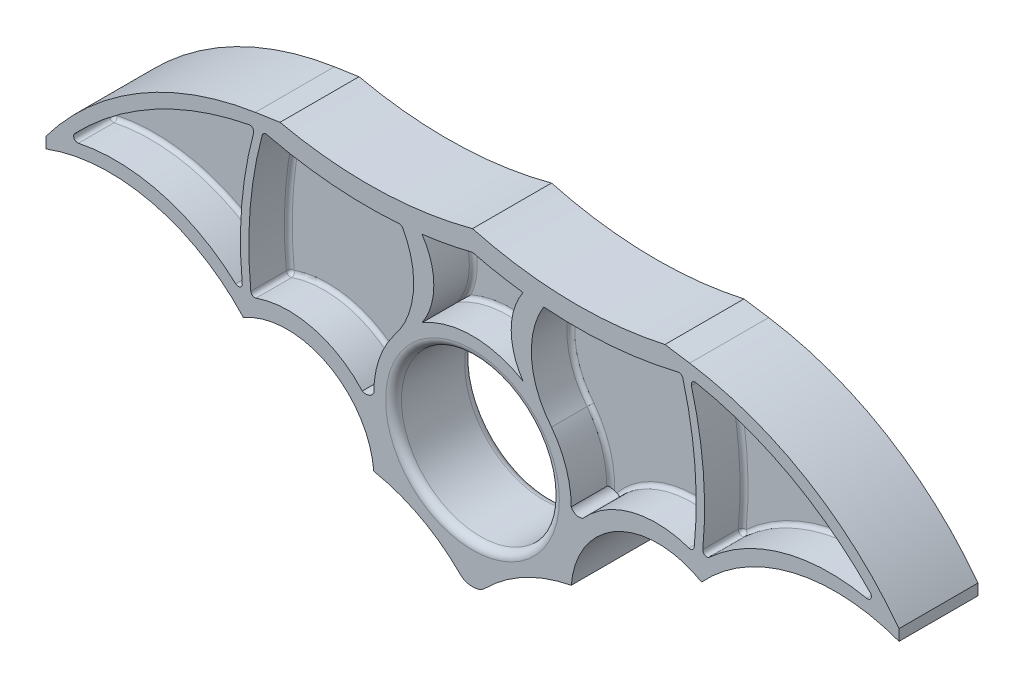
ISO-10303-21;
HEADER;
FILE_DESCRIPTION(('STEP AP214'),'2;1');
FILE_NAME('part.step','',(''),(''),'','','');
FILE_SCHEMA(('AUTOMOTIVE_DESIGN { 1 0 10303 214 1 1 1 1 }'));
ENDSEC;
DATA;
#1=APPLICATION_CONTEXT('core data for automotive mechanical design processes');
#2=APPLICATION_PROTOCOL_DEFINITION('international standard','automotive_design',2000,#1);
#3=PRODUCT_CONTEXT('',#1,'mechanical');
#4=PRODUCT('Part','Part','',(#3));
#5=PRODUCT_RELATED_PRODUCT_CATEGORY('part','',(#4));
#6=PRODUCT_DEFINITION_FORMATION('','',#4);
#7=PRODUCT_DEFINITION_CONTEXT('part definition',#1,'design');
#8=PRODUCT_DEFINITION('design','',#6,#7);
#9=PRODUCT_DEFINITION_SHAPE('','',#8);
#10=(LENGTH_UNIT() NAMED_UNIT(*) SI_UNIT(.MILLI.,.METRE.));
#11=(NAMED_UNIT(*) PLANE_ANGLE_UNIT() SI_UNIT($,.RADIAN.));
#12=(NAMED_UNIT(*) SI_UNIT($,.STERADIAN.) SOLID_ANGLE_UNIT());
#13=UNCERTAINTY_MEASURE_WITH_UNIT(LENGTH_MEASURE(1.E-05),#10,'distance_accuracy_value','');
#14=(GEOMETRIC_REPRESENTATION_CONTEXT(3) GLOBAL_UNCERTAINTY_ASSIGNED_CONTEXT((#13)) GLOBAL_UNIT_ASSIGNED_CONTEXT((#10,
#11,#12)) REPRESENTATION_CONTEXT('',''));
#15=CARTESIAN_POINT('',(0.,0.,0.));
#16=DIRECTION('',(0.,0.,1.));
#17=DIRECTION('',(1.,0.,0.));
#18=AXIS2_PLACEMENT_3D('',#15,#16,#17);
#19=CARTESIAN_POINT('',(85.7226003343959,38.8530028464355,12.7));
#20=DIRECTION('',(0.,0.,-1.));
#21=DIRECTION('',(-1.,0.,0.));
#22=AXIS2_PLACEMENT_3D('',#19,#20,#21);
#23=CYLINDRICAL_SURFACE('',#22,10.922);
#24=DIRECTION('',(0.,0.,-1.));
#25=VECTOR('',#24,1.);
#26=CARTESIAN_POINT('',(76.708,45.0196117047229,12.7));
#27=LINE('',#26,#25);
#28=CARTESIAN_POINT('',(76.708,45.0196117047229,12.7));
#29=VERTEX_POINT('',#28);
#30=CARTESIAN_POINT('',(76.708,45.0196117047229,6.985));
#31=VERTEX_POINT('',#30);
#32=EDGE_CURVE('E464',#29,#31,#27,.T.);
#33=ORIENTED_EDGE('',*,*,#32,.T.);
#34=CARTESIAN_POINT('',(85.7226003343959,38.8530028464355,6.985));
#35=DIRECTION('',(0.,0.,-1.));
#36=DIRECTION('',(-1.,0.,0.));
#37=AXIS2_PLACEMENT_3D('',#34,#35,#36);
#38=CIRCLE('',#37,10.922);
#39=CARTESIAN_POINT('',(76.708,32.6863939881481,6.985));
#40=VERTEX_POINT('',#39);
#41=EDGE_CURVE('E1343',#31,#40,#38,.F.);
#42=ORIENTED_EDGE('',*,*,#41,.T.);
#43=DIRECTION('',(0.,0.,-1.));
#44=VECTOR('',#43,1.);
#45=CARTESIAN_POINT('',(76.708,32.6863939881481,12.7));
#46=LINE('',#45,#44);
#47=CARTESIAN_POINT('',(76.708,32.6863939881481,12.7));
#48=VERTEX_POINT('',#47);
#49=EDGE_CURVE('E460',#48,#40,#46,.T.);
#50=ORIENTED_EDGE('',*,*,#49,.F.);
#51=CARTESIAN_POINT('',(85.7226003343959,38.8530028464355,12.7));
#52=DIRECTION('',(0.,0.,1.));
#53=DIRECTION('',(1.,0.,0.));
#54=AXIS2_PLACEMENT_3D('',#51,#52,#53);
#55=CIRCLE('',#54,10.922);
#56=EDGE_CURVE('E1111',#48,#29,#55,.F.);
#57=ORIENTED_EDGE('',*,*,#56,.T.);
#58=EDGE_LOOP('',(#33,#42,#50,#57));
#59=FACE_BOUND('',#58,.T.);
#60=ADVANCED_FACE('F37',(#59),#23,.T.);
#61=CARTESIAN_POINT('',(68.58,19.05,12.7));
#62=DIRECTION('',(0.,0.,-1.));
#63=DIRECTION('',(-1.,0.,0.));
#64=AXIS2_PLACEMENT_3D('',#61,#62,#63);
#65=CYLINDRICAL_SURFACE('',#64,15.875);
#66=ORIENTED_EDGE('',*,*,#49,.T.);
#67=CARTESIAN_POINT('',(68.58,19.05,6.985));
#68=DIRECTION('',(0.,0.,-1.));
#69=DIRECTION('',(-1.,0.,0.));
#70=AXIS2_PLACEMENT_3D('',#67,#68,#69);
#71=CIRCLE('',#70,15.875);
#72=CARTESIAN_POINT('',(60.452,32.6863939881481,6.985));
#73=VERTEX_POINT('',#72);
#74=EDGE_CURVE('E767',#40,#73,#71,.F.);
#75=ORIENTED_EDGE('',*,*,#74,.T.);
#76=DIRECTION('',(0.,0.,-1.));
#77=VECTOR('',#76,1.);
#78=CARTESIAN_POINT('',(60.452,32.6863939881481,12.7));
#79=LINE('',#78,#77);
#80=CARTESIAN_POINT('',(60.452,32.6863939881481,12.7));
#81=VERTEX_POINT('',#80);
#82=EDGE_CURVE('E474',#81,#73,#79,.T.);
#83=ORIENTED_EDGE('',*,*,#82,.F.);
#84=CARTESIAN_POINT('',(68.58,19.05,12.7));
#85=DIRECTION('',(0.,0.,1.));
#86=DIRECTION('',(1.,0.,0.));
#87=AXIS2_PLACEMENT_3D('',#84,#85,#86);
#88=CIRCLE('',#87,15.875);
#89=EDGE_CURVE('E1115',#48,#81,#88,.T.);
#90=ORIENTED_EDGE('',*,*,#89,.F.);
#91=EDGE_LOOP('',(#66,#75,#83,#90));
#92=FACE_BOUND('',#91,.T.);
#93=ADVANCED_FACE('F921',(#92),#65,.T.);
#94=CARTESIAN_POINT('',(51.4373996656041,38.8530028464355,12.7));
#95=DIRECTION('',(0.,0.,-1.));
#96=DIRECTION('',(-1.,0.,0.));
#97=AXIS2_PLACEMENT_3D('',#94,#95,#96);
#98=CYLINDRICAL_SURFACE('',#97,10.922);
#99=ORIENTED_EDGE('',*,*,#82,.T.);
#100=CARTESIAN_POINT('',(51.4373996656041,38.8530028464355,6.985));
#101=DIRECTION('',(0.,0.,-1.));
#102=DIRECTION('',(-1.,0.,0.));
#103=AXIS2_PLACEMENT_3D('',#100,#101,#102);
#104=CIRCLE('',#103,10.922);
#105=CARTESIAN_POINT('',(60.452,45.0196117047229,6.985));
#106=VERTEX_POINT('',#105);
#107=EDGE_CURVE('E774',#73,#106,#104,.F.);
#108=ORIENTED_EDGE('',*,*,#107,.T.);
#109=DIRECTION('',(0.,0.,-1.));
#110=VECTOR('',#109,1.);
#111=CARTESIAN_POINT('',(60.452,45.0196117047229,12.7));
#112=LINE('',#111,#110);
#113=CARTESIAN_POINT('',(60.452,45.0196117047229,12.7));
#114=VERTEX_POINT('',#113);
#115=EDGE_CURVE('E471',#114,#106,#112,.T.);
#116=ORIENTED_EDGE('',*,*,#115,.F.);
#117=CARTESIAN_POINT('',(51.4373996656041,38.8530028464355,12.7));
#118=DIRECTION('',(0.,0.,1.));
#119=DIRECTION('',(1.,0.,0.));
#120=AXIS2_PLACEMENT_3D('',#117,#118,#119);
#121=CIRCLE('',#120,10.922);
#122=EDGE_CURVE('E1124',#81,#114,#121,.T.);
#123=ORIENTED_EDGE('',*,*,#122,.F.);
#124=EDGE_LOOP('',(#99,#108,#116,#123));
#125=FACE_BOUND('',#124,.T.);
#126=ADVANCED_FACE('F927',(#125),#98,.T.);
#127=CARTESIAN_POINT('',(51.7524999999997,113.376528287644,12.7));
#128=DIRECTION('',(0.,0.,-1.));
#129=DIRECTION('',(-1.,0.,0.));
#130=AXIS2_PLACEMENT_3D('',#127,#128,#129);
#131=CYLINDRICAL_SURFACE('',#130,68.9082676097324);
#132=ORIENTED_EDGE('',*,*,#115,.T.);
#133=CARTESIAN_POINT('',(51.7524999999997,113.376528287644,6.985));
#134=DIRECTION('',(0.,0.,-1.));
#135=DIRECTION('',(-1.,0.,0.));
#136=AXIS2_PLACEMENT_3D('',#133,#134,#135);
#137=CIRCLE('',#136,68.9082676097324);
#138=CARTESIAN_POINT('',(68.58,46.5544915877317,6.985));
#139=VERTEX_POINT('',#138);
#140=EDGE_CURVE('E782',#106,#139,#137,.F.);
#141=ORIENTED_EDGE('',*,*,#140,.T.);
#142=DIRECTION('',(0.,0.,-1.));
#143=VECTOR('',#142,1.);
#144=CARTESIAN_POINT('',(68.58,46.5544915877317,12.7));
#145=LINE('',#144,#143);
#146=CARTESIAN_POINT('',(68.58,46.5544915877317,12.7));
#147=VERTEX_POINT('',#146);
#148=EDGE_CURVE('E467',#147,#139,#145,.T.);
#149=ORIENTED_EDGE('',*,*,#148,.F.);
#150=CARTESIAN_POINT('',(51.7524999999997,113.376528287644,12.7));
#151=DIRECTION('',(0.,0.,1.));
#152=DIRECTION('',(1.,0.,0.));
#153=AXIS2_PLACEMENT_3D('',#150,#151,#152);
#154=CIRCLE('',#153,68.9082676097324);
#155=EDGE_CURVE('E1127',#114,#147,#154,.T.);
#156=ORIENTED_EDGE('',*,*,#155,.F.);
#157=EDGE_LOOP('',(#132,#141,#149,#156));
#158=FACE_BOUND('',#157,.T.);
#159=ADVANCED_FACE('F1307',(#158),#131,.T.);
#160=CARTESIAN_POINT('',(85.4075000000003,113.376528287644,12.7));
#161=DIRECTION('',(0.,0.,-1.));
#162=DIRECTION('',(-1.,0.,0.));
#163=AXIS2_PLACEMENT_3D('',#160,#161,#162);
#164=CYLINDRICAL_SURFACE('',#163,68.9082676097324);
#165=ORIENTED_EDGE('',*,*,#148,.T.);
#166=CARTESIAN_POINT('',(85.4075000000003,113.376528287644,6.985));
#167=DIRECTION('',(0.,0.,-1.));
#168=DIRECTION('',(-1.,0.,0.));
#169=AXIS2_PLACEMENT_3D('',#166,#167,#168);
#170=CIRCLE('',#169,68.9082676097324);
#171=EDGE_CURVE('E1359',#139,#31,#170,.F.);
#172=ORIENTED_EDGE('',*,*,#171,.T.);
#173=ORIENTED_EDGE('',*,*,#32,.F.);
#174=CARTESIAN_POINT('',(85.4075000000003,113.376528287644,12.7));
#175=DIRECTION('',(0.,0.,1.));
#176=DIRECTION('',(1.,0.,0.));
#177=AXIS2_PLACEMENT_3D('',#174,#175,#176);
#178=CIRCLE('',#177,68.9082676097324);
#179=EDGE_CURVE('E1129',#29,#147,#178,.F.);
#180=ORIENTED_EDGE('',*,*,#179,.T.);
#181=EDGE_LOOP('',(#165,#172,#173,#180));
#182=FACE_BOUND('',#181,.T.);
#183=ADVANCED_FACE('F958',(#182),#164,.T.);
#184=CARTESIAN_POINT('',(11.1019474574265,1.98002424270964,12.7));
#185=DIRECTION('',(0.,0.,-1.));
#186=DIRECTION('',(-1.,0.,0.));
#187=AXIS2_PLACEMENT_3D('',#184,#185,#186);
#188=CYLINDRICAL_SURFACE('',#187,28.702);
#189=DIRECTION('',(0.,0.,-1.));
#190=VECTOR('',#189,1.);
#191=CARTESIAN_POINT('',(30.492605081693,23.1414797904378,12.7));
#192=LINE('',#191,#190);
#193=CARTESIAN_POINT('',(30.492605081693,23.1414797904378,12.7));
#194=VERTEX_POINT('',#193);
#195=CARTESIAN_POINT('',(30.492605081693,23.1414797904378,6.985));
#196=VERTEX_POINT('',#195);
#197=EDGE_CURVE('E569',#194,#196,#192,.T.);
#198=ORIENTED_EDGE('',*,*,#197,.T.);
#199=CARTESIAN_POINT('',(11.1019474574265,1.98002424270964,6.985));
#200=DIRECTION('',(0.,0.,-1.));
#201=DIRECTION('',(-1.,0.,0.));
#202=AXIS2_PLACEMENT_3D('',#199,#200,#201);
#203=CIRCLE('',#202,28.702);
#204=CARTESIAN_POINT('',(5.20851220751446,30.0704536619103,6.985));
#205=VERTEX_POINT('',#204);
#206=EDGE_CURVE('E981',#196,#205,#203,.F.);
#207=ORIENTED_EDGE('',*,*,#206,.T.);
#208=DIRECTION('',(0.,0.,-1.));
#209=VECTOR('',#208,1.);
#210=CARTESIAN_POINT('',(5.20851220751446,30.0704536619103,12.7));
#211=LINE('',#210,#209);
#212=CARTESIAN_POINT('',(5.20851220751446,30.0704536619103,12.7));
#213=VERTEX_POINT('',#212);
#214=EDGE_CURVE('E572',#205,#213,#211,.F.);
#215=ORIENTED_EDGE('',*,*,#214,.T.);
#216=CARTESIAN_POINT('',(11.1019474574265,1.98002424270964,12.7));
#217=DIRECTION('',(0.,0.,1.));
#218=DIRECTION('',(1.,0.,0.));
#219=AXIS2_PLACEMENT_3D('',#216,#217,#218);
#220=CIRCLE('',#219,28.702);
#221=EDGE_CURVE('E1142',#194,#213,#220,.T.);
#222=ORIENTED_EDGE('',*,*,#221,.F.);
#223=EDGE_LOOP('',(#198,#207,#215,#222));
#224=FACE_BOUND('',#223,.T.);
#225=ADVANCED_FACE('F1294',(#224),#188,.T.);
#226=CARTESIAN_POINT('',(42.6386581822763,-5.4001078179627,12.7));
#227=DIRECTION('',(0.,0.,-1.));
#228=DIRECTION('',(-1.,0.,0.));
#229=AXIS2_PLACEMENT_3D('',#226,#227,#228);
#230=CYLINDRICAL_SURFACE('',#229,52.7255774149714);
#231=DIRECTION('',(0.,0.,-1.));
#232=VECTOR('',#231,1.);
#233=CARTESIAN_POINT('',(4.62025215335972,31.1318961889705,12.7));
#234=LINE('',#233,#232);
#235=CARTESIAN_POINT('',(4.62025215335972,31.1318961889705,12.7));
#236=VERTEX_POINT('',#235);
#237=CARTESIAN_POINT('',(4.62025215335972,31.1318961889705,6.985));
#238=VERTEX_POINT('',#237);
#239=EDGE_CURVE('E566',#236,#238,#234,.T.);
#240=ORIENTED_EDGE('',*,*,#239,.T.);
#241=CARTESIAN_POINT('',(42.6386581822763,-5.4001078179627,6.985));
#242=DIRECTION('',(0.,0.,-1.));
#243=DIRECTION('',(-1.,0.,0.));
#244=AXIS2_PLACEMENT_3D('',#241,#242,#243);
#245=CIRCLE('',#244,52.7255774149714);
#246=CARTESIAN_POINT('',(32.650386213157,46.3707424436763,6.985));
#247=VERTEX_POINT('',#246);
#248=EDGE_CURVE('E678',#238,#247,#245,.T.);
#249=ORIENTED_EDGE('',*,*,#248,.T.);
#250=DIRECTION('',(0.,0.,-1.));
#251=VECTOR('',#250,1.);
#252=CARTESIAN_POINT('',(32.650386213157,46.3707424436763,12.7));
#253=LINE('',#252,#251);
#254=CARTESIAN_POINT('',(32.650386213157,46.3707424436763,12.7));
#255=VERTEX_POINT('',#254);
#256=EDGE_CURVE('E564',#247,#255,#253,.F.);
#257=ORIENTED_EDGE('',*,*,#256,.T.);
#258=CARTESIAN_POINT('',(42.6386581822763,-5.4001078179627,12.7));
#259=DIRECTION('',(0.,0.,1.));
#260=DIRECTION('',(1.,0.,0.));
#261=AXIS2_PLACEMENT_3D('',#258,#259,#260);
#262=CIRCLE('',#261,52.7255774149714);
#263=EDGE_CURVE('E1145',#255,#236,#262,.T.);
#264=ORIENTED_EDGE('',*,*,#263,.T.);
#265=EDGE_LOOP('',(#240,#249,#257,#264));
#266=FACE_BOUND('',#265,.T.);
#267=ADVANCED_FACE('F1290',(#266),#230,.F.);
#268=CARTESIAN_POINT('',(92.542119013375,29.6087169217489,12.7));
#269=DIRECTION('',(0.,0.,-1.));
#270=DIRECTION('',(-1.,0.,0.));
#271=AXIS2_PLACEMENT_3D('',#268,#269,#270);
#272=CYLINDRICAL_SURFACE('',#271,61.2768477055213);
#273=DIRECTION('',(0.,0.,-1.));
#274=VECTOR('',#273,1.);
#275=CARTESIAN_POINT('',(33.3837267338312,45.5817156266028,12.7));
#276=LINE('',#275,#274);
#277=CARTESIAN_POINT('',(33.3837267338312,45.5817156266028,12.7));
#278=VERTEX_POINT('',#277);
#279=CARTESIAN_POINT('',(33.3837267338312,45.5817156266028,6.985));
#280=VERTEX_POINT('',#279);
#281=EDGE_CURVE('E590',#278,#280,#276,.T.);
#282=ORIENTED_EDGE('',*,*,#281,.T.);
#283=CARTESIAN_POINT('',(92.542119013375,29.6087169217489,6.985));
#284=DIRECTION('',(0.,0.,-1.));
#285=DIRECTION('',(-1.,0.,0.));
#286=AXIS2_PLACEMENT_3D('',#283,#284,#285);
#287=CIRCLE('',#286,61.2768477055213);
#288=CARTESIAN_POINT('',(31.5536138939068,23.6711830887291,6.985));
#289=VERTEX_POINT('',#288);
#290=EDGE_CURVE('E667',#280,#289,#287,.F.);
#291=ORIENTED_EDGE('',*,*,#290,.T.);
#292=DIRECTION('',(0.,0.,-1.));
#293=VECTOR('',#292,1.);
#294=CARTESIAN_POINT('',(31.5536138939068,23.6711830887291,12.7));
#295=LINE('',#294,#293);
#296=CARTESIAN_POINT('',(31.5536138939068,23.6711830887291,12.7));
#297=VERTEX_POINT('',#296);
#298=EDGE_CURVE('E588',#289,#297,#295,.F.);
#299=ORIENTED_EDGE('',*,*,#298,.T.);
#300=CARTESIAN_POINT('',(92.542119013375,29.6087169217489,12.7));
#301=DIRECTION('',(0.,0.,1.));
#302=DIRECTION('',(1.,0.,0.));
#303=AXIS2_PLACEMENT_3D('',#300,#301,#302);
#304=CIRCLE('',#303,61.2768477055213);
#305=EDGE_CURVE('E493',#278,#297,#304,.T.);
#306=ORIENTED_EDGE('',*,*,#305,.F.);
#307=EDGE_LOOP('',(#282,#291,#299,#306));
#308=FACE_BOUND('',#307,.T.);
#309=ADVANCED_FACE('F1287',(#308),#272,.T.);
#310=CARTESIAN_POINT('',(51.4429086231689,19.6395286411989,12.7));
#311=DIRECTION('',(0.,0.,-1.));
#312=DIRECTION('',(-1.,0.,0.));
#313=AXIS2_PLACEMENT_3D('',#310,#311,#312);
#314=CYLINDRICAL_SURFACE('',#313,1.39298911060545);
#315=CARTESIAN_POINT('',(51.4429086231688,19.6395286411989,6.35));
#316=DIRECTION('',(0.,0.,-1.));
#317=DIRECTION('',(-1.,0.,0.));
#318=AXIS2_PLACEMENT_3D('',#315,#316,#317);
#319=CIRCLE('',#318,1.39298911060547);
#320=CARTESIAN_POINT('',(52.705,19.05,6.35));
#321=VERTEX_POINT('',#320);
#322=CARTESIAN_POINT('',(51.7701545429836,18.2855239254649,6.35));
#323=VERTEX_POINT('',#322);
#324=EDGE_CURVE('E447',#321,#323,#319,.T.);
#325=ORIENTED_EDGE('',*,*,#324,.T.);
#326=CARTESIAN_POINT('',(51.7701545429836,18.2855239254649,6.35));
#327=CARTESIAN_POINT('',(51.7482741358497,18.2802322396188,6.34999972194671));
#328=CARTESIAN_POINT('',(51.7262840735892,18.2754825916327,6.35096767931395));
#329=CARTESIAN_POINT('',(51.6822785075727,18.2670783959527,6.35468354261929));
#330=CARTESIAN_POINT('',(51.6602630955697,18.2634221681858,6.35742869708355));
#331=CARTESIAN_POINT('',(51.5948374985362,18.2541548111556,6.36802447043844));
#332=CARTESIAN_POINT('',(51.5515728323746,18.2501318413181,6.37824238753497));
#333=CARTESIAN_POINT('',(51.4555897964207,18.2455696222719,6.40714051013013));
#334=CARTESIAN_POINT('',(51.4032794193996,18.2461826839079,6.42731556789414));
#335=CARTESIAN_POINT('',(51.3017518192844,18.2527682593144,6.47424124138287));
#336=CARTESIAN_POINT('',(51.2525563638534,18.2587748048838,6.50103282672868));
#337=CARTESIAN_POINT('',(51.1574460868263,18.27523688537,6.56084263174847));
#338=CARTESIAN_POINT('',(51.1116193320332,18.2857812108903,6.59397737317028));
#339=CARTESIAN_POINT('',(51.0474694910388,18.303661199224,6.64818821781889));
#340=CARTESIAN_POINT('',(51.0268830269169,18.309952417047,6.66697347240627));
#341=CARTESIAN_POINT('',(50.9875960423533,18.3228916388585,6.70629609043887));
#342=CARTESIAN_POINT('',(50.968892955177,18.3295391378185,6.72683099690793));
#343=CARTESIAN_POINT('',(50.9385505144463,18.3409780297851,6.76449672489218));
#344=CARTESIAN_POINT('',(50.9263312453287,18.3458072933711,6.78114568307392));
#345=CARTESIAN_POINT('',(50.9038578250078,18.3550095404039,6.81586398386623));
#346=CARTESIAN_POINT('',(50.8936020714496,18.3593828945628,6.8339321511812));
#347=CARTESIAN_POINT('',(50.8779133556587,18.3662432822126,6.86741282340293));
#348=CARTESIAN_POINT('',(50.8719146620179,18.36893340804,6.88251315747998));
#349=CARTESIAN_POINT('',(50.8622158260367,18.3733360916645,6.91355380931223));
#350=CARTESIAN_POINT('',(50.8585071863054,18.3750522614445,6.92949078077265));
#351=CARTESIAN_POINT('',(50.8552654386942,18.3765579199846,6.95215566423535));
#352=CARTESIAN_POINT('',(50.8545615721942,18.376885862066,6.95869203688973));
#353=CARTESIAN_POINT('',(50.8536178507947,18.3773261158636,6.97181770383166));
#354=CARTESIAN_POINT('',(50.8533788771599,18.3774380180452,6.97840707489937));
#355=CARTESIAN_POINT('',(50.85337998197,18.3774372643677,6.98499999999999));
#356=B_SPLINE_CURVE_WITH_KNOTS('',3,(#326,#327,#328,#329,#330,#331,#332,#333,#334,#335,#336,
#337,#338,#339,#340,#341,#342,#343,#344,#345,#346,#347,#348,#349,#350,#351,#352,#353,#354,#355),
.UNSPECIFIED.,.F.,.F.,(4,2,2,2,2,2,2,2,2,2,2,2,2,2,4),(0.,0.0674721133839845,0.134840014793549,
0.268131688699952,0.435469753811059,0.603871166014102,0.775729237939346,0.861361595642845,
0.946875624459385,1.01040772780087,1.0738877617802,1.12314300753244,1.17221437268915,
1.19194389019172,1.21171077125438),.UNSPECIFIED.);
#357=CARTESIAN_POINT('',(50.85337998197,18.3774372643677,6.985));
#358=VERTEX_POINT('',#357);
#359=EDGE_CURVE('E51',#323,#358,#356,.T.);
#360=ORIENTED_EDGE('',*,*,#359,.T.);
#361=DIRECTION('',(0.,0.,-1.));
#362=VECTOR('',#361,1.);
#363=CARTESIAN_POINT('',(50.85337998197,18.3774372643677,12.7));
#364=LINE('',#363,#362);
#365=CARTESIAN_POINT('',(50.85337998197,18.3774372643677,12.7));
#366=VERTEX_POINT('',#365);
#367=EDGE_CURVE('E455',#366,#358,#364,.T.);
#368=ORIENTED_EDGE('',*,*,#367,.F.);
#369=CARTESIAN_POINT('',(51.4429086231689,19.6395286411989,12.7));
#370=DIRECTION('',(0.,0.,1.));
#371=DIRECTION('',(1.,0.,0.));
#372=AXIS2_PLACEMENT_3D('',#369,#370,#371);
#373=CIRCLE('',#372,1.39298911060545);
#374=CARTESIAN_POINT('',(52.705,19.05,12.7));
#375=VERTEX_POINT('',#374);
#376=EDGE_CURVE('E1131',#366,#375,#373,.T.);
#377=ORIENTED_EDGE('',*,*,#376,.T.);
#378=DIRECTION('',(0.,0.,-1.));
#379=VECTOR('',#378,1.);
#380=CARTESIAN_POINT('',(52.705,19.05,12.7));
#381=LINE('',#380,#379);
#382=EDGE_CURVE('E456',#375,#321,#381,.T.);
#383=ORIENTED_EDGE('',*,*,#382,.T.);
#384=EDGE_LOOP('',(#325,#360,#368,#377,#383));
#385=FACE_BOUND('',#384,.T.);
#386=ADVANCED_FACE('F994',(#385),#314,.F.);
#387=CARTESIAN_POINT('',(39.0044092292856,7.74652540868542,12.7));
#388=DIRECTION('',(0.,0.,-1.));
#389=DIRECTION('',(-1.,0.,0.));
#390=AXIS2_PLACEMENT_3D('',#387,#388,#389);
#391=CYLINDRICAL_SURFACE('',#390,15.9189947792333);
#392=ORIENTED_EDGE('',*,*,#367,.T.);
#393=CARTESIAN_POINT('',(39.0044092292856,7.74652540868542,6.985));
#394=DIRECTION('',(0.,0.,1.));
#395=DIRECTION('',(1.,0.,0.));
#396=AXIS2_PLACEMENT_3D('',#393,#394,#395);
#397=CIRCLE('',#396,15.9189947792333);
#398=CARTESIAN_POINT('',(33.7716530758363,22.7809079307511,6.985));
#399=VERTEX_POINT('',#398);
#400=EDGE_CURVE('E983',#358,#399,#397,.T.);
#401=ORIENTED_EDGE('',*,*,#400,.T.);
#402=DIRECTION('',(0.,0.,-1.));
#403=VECTOR('',#402,1.);
#404=CARTESIAN_POINT('',(33.7716530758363,22.7809079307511,12.7));
#405=LINE('',#404,#403);
#406=CARTESIAN_POINT('',(33.7716530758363,22.7809079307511,12.7));
#407=VERTEX_POINT('',#406);
#408=EDGE_CURVE('E586',#399,#407,#405,.F.);
#409=ORIENTED_EDGE('',*,*,#408,.T.);
#410=CARTESIAN_POINT('',(39.0044092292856,7.74652540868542,12.7));
#411=DIRECTION('',(0.,0.,1.));
#412=DIRECTION('',(1.,0.,0.));
#413=AXIS2_PLACEMENT_3D('',#410,#411,#412);
#414=CIRCLE('',#413,15.9189947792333);
#415=EDGE_CURVE('E1134',#366,#407,#414,.T.);
#416=ORIENTED_EDGE('',*,*,#415,.F.);
#417=EDGE_LOOP('',(#392,#401,#409,#416));
#418=FACE_BOUND('',#417,.T.);
#419=ADVANCED_FACE('F1309',(#418),#391,.T.);
#420=CARTESIAN_POINT('',(95.2987249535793,29.6698594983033,12.7));
#421=DIRECTION('',(0.,0.,-1.));
#422=DIRECTION('',(-1.,0.,0.));
#423=AXIS2_PLACEMENT_3D('',#420,#421,#422);
#424=CYLINDRICAL_SURFACE('',#423,62.6903299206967);
#425=DIRECTION('',(0.,0.,-1.));
#426=VECTOR('',#425,1.);
#427=CARTESIAN_POINT('',(32.9311909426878,23.3162646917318,12.7));
#428=LINE('',#427,#426);
#429=CARTESIAN_POINT('',(32.9311909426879,23.3162646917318,12.7));
#430=VERTEX_POINT('',#429);
#431=CARTESIAN_POINT('',(32.9311909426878,23.3162646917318,6.985));
#432=VERTEX_POINT('',#431);
#433=EDGE_CURVE('E583',#430,#432,#428,.T.);
#434=ORIENTED_EDGE('',*,*,#433,.T.);
#435=CARTESIAN_POINT('',(95.2987249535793,29.6698594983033,6.985));
#436=DIRECTION('',(0.,0.,1.));
#437=DIRECTION('',(1.,0.,0.));
#438=AXIS2_PLACEMENT_3D('',#435,#436,#437);
#439=CIRCLE('',#438,62.6903299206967);
#440=CARTESIAN_POINT('',(34.7604099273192,45.9545111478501,6.985));
#441=VERTEX_POINT('',#440);
#442=EDGE_CURVE('E11',#432,#441,#439,.F.);
#443=ORIENTED_EDGE('',*,*,#442,.T.);
#444=DIRECTION('',(0.,0.,-1.));
#445=VECTOR('',#444,1.);
#446=CARTESIAN_POINT('',(34.7604099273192,45.9545111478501,12.7));
#447=LINE('',#446,#445);
#448=CARTESIAN_POINT('',(34.7604099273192,45.9545111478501,12.7));
#449=VERTEX_POINT('',#448);
#450=EDGE_CURVE('E581',#441,#449,#447,.F.);
#451=ORIENTED_EDGE('',*,*,#450,.T.);
#452=CARTESIAN_POINT('',(95.2987249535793,29.6698594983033,12.7));
#453=DIRECTION('',(0.,0.,1.));
#454=DIRECTION('',(1.,0.,0.));
#455=AXIS2_PLACEMENT_3D('',#452,#453,#454);
#456=CIRCLE('',#455,62.6903299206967);
#457=EDGE_CURVE('E1137',#449,#430,#456,.T.);
#458=ORIENTED_EDGE('',*,*,#457,.T.);
#459=EDGE_LOOP('',(#434,#443,#451,#458));
#460=FACE_BOUND('',#459,.T.);
#461=ADVANCED_FACE('F1305',(#460),#424,.F.);
#462=DIRECTION('',(0.,0.,-1.));
#463=VECTOR('',#462,1.);
#464=CARTESIAN_POINT('',(35.5231675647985,46.4066984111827,12.7));
#465=LINE('',#464,#463);
#466=CARTESIAN_POINT('',(35.5231675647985,46.4066984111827,12.7));
#467=VERTEX_POINT('',#466);
#468=CARTESIAN_POINT('',(35.5231675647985,46.4066984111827,6.985));
#469=VERTEX_POINT('',#468);
#470=EDGE_CURVE('E576',#467,#469,#465,.T.);
#471=ORIENTED_EDGE('',*,*,#470,.T.);
#472=CARTESIAN_POINT('',(51.7524999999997,113.376528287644,6.985));
#473=DIRECTION('',(0.,0.,1.));
#474=DIRECTION('',(1.,0.,0.));
#475=AXIS2_PLACEMENT_3D('',#472,#473,#474);
#476=CIRCLE('',#475,68.9082676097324);
#477=CARTESIAN_POINT('',(56.7535433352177,44.6499765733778,6.985));
#478=VERTEX_POINT('',#477);
#479=EDGE_CURVE('E685',#469,#478,#476,.T.);
#480=ORIENTED_EDGE('',*,*,#479,.T.);
#481=DIRECTION('',(0.,0.,-1.));
#482=VECTOR('',#481,1.);
#483=CARTESIAN_POINT('',(56.7535433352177,44.6499765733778,12.7));
#484=LINE('',#483,#482);
#485=CARTESIAN_POINT('',(56.7535433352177,44.6499765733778,12.7));
#486=VERTEX_POINT('',#485);
#487=EDGE_CURVE('E579',#478,#486,#484,.F.);
#488=ORIENTED_EDGE('',*,*,#487,.T.);
#489=EDGE_CURVE('E1130',#467,#486,#154,.T.);
#490=ORIENTED_EDGE('',*,*,#489,.F.);
#491=EDGE_LOOP('',(#471,#480,#488,#490));
#492=FACE_BOUND('',#491,.T.);
#493=ADVANCED_FACE('F1302',(#492),#131,.T.);
#494=CARTESIAN_POINT('',(45.1522438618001,37.523527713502,12.7));
#495=DIRECTION('',(0.,0.,-1.));
#496=DIRECTION('',(-1.,0.,0.));
#497=AXIS2_PLACEMENT_3D('',#494,#495,#496);
#498=CYLINDRICAL_SURFACE('',#497,13.97);
#499=DIRECTION('',(0.,0.,-1.));
#500=VECTOR('',#499,1.);
#501=CARTESIAN_POINT('',(57.3542660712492,44.3258474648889,12.7));
#502=LINE('',#501,#500);
#503=CARTESIAN_POINT('',(57.3542660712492,44.3258474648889,12.7));
#504=VERTEX_POINT('',#503);
#505=CARTESIAN_POINT('',(57.3542660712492,44.3258474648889,6.40827730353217));
#506=VERTEX_POINT('',#505);
#507=EDGE_CURVE('E574',#504,#506,#502,.T.);
#508=ORIENTED_EDGE('',*,*,#507,.T.);
#509=CARTESIAN_POINT('',(57.3542660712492,44.3258474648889,6.40827730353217));
#510=CARTESIAN_POINT('',(57.3654880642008,44.3057204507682,6.39861468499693));
#511=CARTESIAN_POINT('',(57.3768915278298,44.2851455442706,6.3901266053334));
#512=CARTESIAN_POINT('',(57.3998314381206,44.2435011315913,6.37561108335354));
#513=CARTESIAN_POINT('',(57.4113655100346,44.2224383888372,6.36956049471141));
#514=CARTESIAN_POINT('',(57.4462419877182,44.158354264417,6.35494717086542));
#515=CARTESIAN_POINT('',(57.4697753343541,44.1145862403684,6.34999363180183));
#516=CARTESIAN_POINT('',(57.4931001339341,44.0706008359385,6.35));
#517=B_SPLINE_CURVE_WITH_KNOTS('',3,(#509,#510,#511,#512,#513,#514,#515,#516),.UNSPECIFIED.,.F.,
.F.,(4,2,2,4),(0.,0.0749098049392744,0.149090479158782,0.297996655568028),.UNSPECIFIED.);
#518=CARTESIAN_POINT('',(57.4931001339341,44.0706008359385,6.35));
#519=VERTEX_POINT('',#518);
#520=EDGE_CURVE('E439',#506,#519,#517,.T.);
#521=ORIENTED_EDGE('',*,*,#520,.T.);
#522=CARTESIAN_POINT('',(45.1522438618,37.523527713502,6.35));
#523=DIRECTION('',(0.,0.,-1.));
#524=DIRECTION('',(1.,0.,0.));
#525=AXIS2_PLACEMENT_3D('',#522,#523,#524);
#526=CIRCLE('',#525,13.97);
#527=CARTESIAN_POINT('',(55.8799999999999,28.5749999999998,6.35));
#528=VERTEX_POINT('',#527);
#529=EDGE_CURVE('E430',#519,#528,#526,.T.);
#530=ORIENTED_EDGE('',*,*,#529,.T.);
#531=DIRECTION('',(0.,0.,-1.));
#532=VECTOR('',#531,1.);
#533=CARTESIAN_POINT('',(55.8799999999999,28.5749999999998,12.7));
#534=LINE('',#533,#532);
#535=CARTESIAN_POINT('',(55.8799999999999,28.5749999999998,12.7));
#536=VERTEX_POINT('',#535);
#537=EDGE_CURVE('E436',#536,#528,#534,.T.);
#538=ORIENTED_EDGE('',*,*,#537,.F.);
#539=CARTESIAN_POINT('',(45.1522438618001,37.523527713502,12.7));
#540=DIRECTION('',(0.,0.,1.));
#541=DIRECTION('',(1.,0.,0.));
#542=AXIS2_PLACEMENT_3D('',#539,#540,#541);
#543=CIRCLE('',#542,13.97);
#544=EDGE_CURVE('E1140',#536,#504,#543,.T.);
#545=ORIENTED_EDGE('',*,*,#544,.T.);
#546=EDGE_LOOP('',(#508,#521,#530,#538,#545));
#547=FACE_BOUND('',#546,.T.);
#548=ADVANCED_FACE('F433',(#547),#498,.F.);
#549=CARTESIAN_POINT('',(94.5213418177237,-5.40010781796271,12.7));
#550=DIRECTION('',(0.,0.,-1.));
#551=DIRECTION('',(-1.,0.,0.));
#552=AXIS2_PLACEMENT_3D('',#549,#550,#551);
#553=CYLINDRICAL_SURFACE('',#552,52.7255774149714);
#554=DIRECTION('',(0.,0.,-1.));
#555=VECTOR('',#554,1.);
#556=CARTESIAN_POINT('',(104.509613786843,46.3707424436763,12.7));
#557=LINE('',#556,#555);
#558=CARTESIAN_POINT('',(104.509613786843,46.3707424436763,12.7));
#559=VERTEX_POINT('',#558);
#560=CARTESIAN_POINT('',(104.509613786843,46.3707424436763,6.985));
#561=VERTEX_POINT('',#560);
#562=EDGE_CURVE('E544',#559,#561,#557,.T.);
#563=ORIENTED_EDGE('',*,*,#562,.T.);
#564=CARTESIAN_POINT('',(94.5213418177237,-5.40010781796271,6.985));
#565=DIRECTION('',(0.,0.,1.));
#566=DIRECTION('',(1.,0.,0.));
#567=AXIS2_PLACEMENT_3D('',#564,#565,#566);
#568=CIRCLE('',#567,52.7255774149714);
#569=CARTESIAN_POINT('',(132.53974784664,31.1318961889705,6.985));
#570=VERTEX_POINT('',#569);
#571=EDGE_CURVE('E641',#561,#570,#568,.F.);
#572=ORIENTED_EDGE('',*,*,#571,.T.);
#573=DIRECTION('',(0.,0.,-1.));
#574=VECTOR('',#573,1.);
#575=CARTESIAN_POINT('',(132.53974784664,31.1318961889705,12.7));
#576=LINE('',#575,#574);
#577=CARTESIAN_POINT('',(132.53974784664,31.1318961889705,12.7));
#578=VERTEX_POINT('',#577);
#579=EDGE_CURVE('E547',#570,#578,#576,.F.);
#580=ORIENTED_EDGE('',*,*,#579,.T.);
#581=CARTESIAN_POINT('',(94.5213418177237,-5.40010781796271,12.7));
#582=DIRECTION('',(0.,0.,1.));
#583=DIRECTION('',(1.,0.,0.));
#584=AXIS2_PLACEMENT_3D('',#581,#582,#583);
#585=CIRCLE('',#584,52.7255774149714);
#586=EDGE_CURVE('E1118',#559,#578,#585,.F.);
#587=ORIENTED_EDGE('',*,*,#586,.F.);
#588=EDGE_LOOP('',(#563,#572,#580,#587));
#589=FACE_BOUND('',#588,.T.);
#590=ADVANCED_FACE('F943',(#589),#553,.F.);
#591=CARTESIAN_POINT('',(126.058052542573,1.98002424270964,12.7));
#592=DIRECTION('',(0.,0.,-1.));
#593=DIRECTION('',(-1.,0.,0.));
#594=AXIS2_PLACEMENT_3D('',#591,#592,#593);
#595=CYLINDRICAL_SURFACE('',#594,28.702);
#596=DIRECTION('',(0.,0.,-1.));
#597=VECTOR('',#596,1.);
#598=CARTESIAN_POINT('',(131.951487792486,30.0704536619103,12.7));
#599=LINE('',#598,#597);
#600=CARTESIAN_POINT('',(131.951487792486,30.0704536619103,12.7));
#601=VERTEX_POINT('',#600);
#602=CARTESIAN_POINT('',(131.951487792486,30.0704536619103,6.985));
#603=VERTEX_POINT('',#602);
#604=EDGE_CURVE('E541',#601,#603,#599,.T.);
#605=ORIENTED_EDGE('',*,*,#604,.T.);
#606=CARTESIAN_POINT('',(126.058052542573,1.98002424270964,6.985));
#607=DIRECTION('',(0.,0.,1.));
#608=DIRECTION('',(1.,0.,0.));
#609=AXIS2_PLACEMENT_3D('',#606,#607,#608);
#610=CIRCLE('',#609,28.702);
#611=CARTESIAN_POINT('',(106.667394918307,23.1414797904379,6.985));
#612=VERTEX_POINT('',#611);
#613=EDGE_CURVE('E630',#603,#612,#610,.T.);
#614=ORIENTED_EDGE('',*,*,#613,.T.);
#615=DIRECTION('',(0.,0.,-1.));
#616=VECTOR('',#615,1.);
#617=CARTESIAN_POINT('',(106.667394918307,23.1414797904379,12.7));
#618=LINE('',#617,#616);
#619=CARTESIAN_POINT('',(106.667394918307,23.1414797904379,12.7));
#620=VERTEX_POINT('',#619);
#621=EDGE_CURVE('E539',#612,#620,#618,.F.);
#622=ORIENTED_EDGE('',*,*,#621,.T.);
#623=CARTESIAN_POINT('',(126.058052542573,1.98002424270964,12.7));
#624=DIRECTION('',(0.,0.,1.));
#625=DIRECTION('',(1.,0.,0.));
#626=AXIS2_PLACEMENT_3D('',#623,#624,#625);
#627=CIRCLE('',#626,28.702);
#628=EDGE_CURVE('E1112',#620,#601,#627,.F.);
#629=ORIENTED_EDGE('',*,*,#628,.T.);
#630=EDGE_LOOP('',(#605,#614,#622,#629));
#631=FACE_BOUND('',#630,.T.);
#632=ADVANCED_FACE('F818',(#631),#595,.T.);
#633=CARTESIAN_POINT('',(98.1555907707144,7.74652540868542,12.7));
#634=DIRECTION('',(0.,0.,-1.));
#635=DIRECTION('',(-1.,0.,0.));
#636=AXIS2_PLACEMENT_3D('',#633,#634,#635);
#637=CYLINDRICAL_SURFACE('',#636,15.9189947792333);
#638=DIRECTION('',(0.,0.,-1.));
#639=VECTOR('',#638,1.);
#640=CARTESIAN_POINT('',(103.388346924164,22.7809079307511,12.7));
#641=LINE('',#640,#639);
#642=CARTESIAN_POINT('',(103.388346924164,22.7809079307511,12.7));
#643=VERTEX_POINT('',#642);
#644=CARTESIAN_POINT('',(103.388346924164,22.7809079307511,6.985));
#645=VERTEX_POINT('',#644);
#646=EDGE_CURVE('E554',#643,#645,#641,.T.);
#647=ORIENTED_EDGE('',*,*,#646,.T.);
#648=CARTESIAN_POINT('',(98.1555907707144,7.74652540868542,6.985));
#649=DIRECTION('',(0.,0.,1.));
#650=DIRECTION('',(1.,0.,0.));
#651=AXIS2_PLACEMENT_3D('',#648,#649,#650);
#652=CIRCLE('',#651,15.9189947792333);
#653=CARTESIAN_POINT('',(86.30662001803,18.3774372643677,6.985));
#654=VERTEX_POINT('',#653);
#655=EDGE_CURVE('E780',#645,#654,#652,.T.);
#656=ORIENTED_EDGE('',*,*,#655,.T.);
#657=DIRECTION('',(0.,0.,-1.));
#658=VECTOR('',#657,1.);
#659=CARTESIAN_POINT('',(86.30662001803,18.3774372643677,12.7));
#660=LINE('',#659,#658);
#661=CARTESIAN_POINT('',(86.30662001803,18.3774372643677,12.7));
#662=VERTEX_POINT('',#661);
#663=EDGE_CURVE('E468',#662,#654,#660,.T.);
#664=ORIENTED_EDGE('',*,*,#663,.F.);
#665=CARTESIAN_POINT('',(98.1555907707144,7.74652540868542,12.7));
#666=DIRECTION('',(0.,0.,1.));
#667=DIRECTION('',(1.,0.,0.));
#668=AXIS2_PLACEMENT_3D('',#665,#666,#667);
#669=CIRCLE('',#668,15.9189947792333);
#670=EDGE_CURVE('E1232',#662,#643,#669,.F.);
#671=ORIENTED_EDGE('',*,*,#670,.T.);
#672=EDGE_LOOP('',(#647,#656,#664,#671));
#673=FACE_BOUND('',#672,.T.);
#674=ADVANCED_FACE('F812',(#673),#637,.T.);
#675=CARTESIAN_POINT('',(85.7170913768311,19.6395286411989,12.7));
#676=DIRECTION('',(0.,0.,-1.));
#677=DIRECTION('',(-1.,0.,0.));
#678=AXIS2_PLACEMENT_3D('',#675,#676,#677);
#679=CYLINDRICAL_SURFACE('',#678,1.39298911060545);
#680=ORIENTED_EDGE('',*,*,#663,.T.);
#681=CARTESIAN_POINT('',(86.30662001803,18.3774372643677,6.985));
#682=CARTESIAN_POINT('',(86.306678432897,18.3774738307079,6.96807496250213));
#683=CARTESIAN_POINT('',(86.3050567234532,18.3767060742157,6.95126436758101));
#684=CARTESIAN_POINT('',(86.2990639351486,18.3739288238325,6.91854735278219));
#685=CARTESIAN_POINT('',(86.2947433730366,18.3719421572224,6.90263005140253));
#686=CARTESIAN_POINT('',(86.2817858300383,18.3661070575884,6.86562310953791));
#687=CARTESIAN_POINT('',(86.2721175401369,18.3618330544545,6.84497750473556));
#688=CARTESIAN_POINT('',(86.2499020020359,18.3524073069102,6.80534374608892));
#689=CARTESIAN_POINT('',(86.2373281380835,18.3472475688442,6.78637330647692));
#690=CARTESIAN_POINT('',(86.19685015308,18.3314487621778,6.7319029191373));
#691=CARTESIAN_POINT('',(86.1661013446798,18.3204464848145,6.69865063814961));
#692=CARTESIAN_POINT('',(86.1002289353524,18.2998131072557,6.63653962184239));
#693=CARTESIAN_POINT('',(86.0651038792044,18.2901824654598,6.60768235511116));
#694=CARTESIAN_POINT('',(85.9868841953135,18.2722569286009,6.55039779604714));
#695=CARTESIAN_POINT('',(85.9433422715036,18.2642798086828,6.52247581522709));
#696=CARTESIAN_POINT('',(85.8528671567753,18.2524213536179,6.47170787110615));
#697=CARTESIAN_POINT('',(85.8059354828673,18.2485381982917,6.44885965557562));
#698=CARTESIAN_POINT('',(85.7152124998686,18.2458925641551,6.41159906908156));
#699=CARTESIAN_POINT('',(85.6717210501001,18.2465710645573,6.39650308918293));
#700=CARTESIAN_POINT('',(85.5834702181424,18.2522637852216,6.37208888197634));
#701=CARTESIAN_POINT('',(85.5387152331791,18.2572644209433,6.36275270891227));
#702=CARTESIAN_POINT('',(85.4765376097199,18.2673534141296,6.35466800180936));
#703=CARTESIAN_POINT('',(85.4591561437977,18.2705138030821,6.35293681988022));
#704=CARTESIAN_POINT('',(85.4244421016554,18.2775122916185,6.35060259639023));
#705=CARTESIAN_POINT('',(85.4071095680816,18.2813508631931,6.35000034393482));
#706=CARTESIAN_POINT('',(85.3898454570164,18.2855239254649,6.35));
#707=B_SPLINE_CURVE_WITH_KNOTS('',3,(#681,#682,#683,#684,#685,#686,#687,#688,#689,#690,#691,
#692,#693,#694,#695,#696,#697,#698,#699,#700,#701,#702,#703,#704,#705,#706),.UNSPECIFIED.,.F.,
.F.,(4,2,2,2,2,2,2,2,2,2,2,2,4),(0.,0.0504982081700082,0.10007840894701,0.16926696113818,
0.239116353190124,0.378179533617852,0.517289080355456,0.673799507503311,0.830240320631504,
0.967891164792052,1.105110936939,1.15832293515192,1.21157211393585),.UNSPECIFIED.);
#708=CARTESIAN_POINT('',(85.3898454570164,18.2855239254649,6.35));
#709=VERTEX_POINT('',#708);
#710=EDGE_CURVE('E795',#654,#709,#707,.T.);
#711=ORIENTED_EDGE('',*,*,#710,.T.);
#712=CARTESIAN_POINT('',(85.7170913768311,19.6395286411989,6.35));
#713=DIRECTION('',(0.,0.,-1.));
#714=DIRECTION('',(-1.,0.,0.));
#715=AXIS2_PLACEMENT_3D('',#712,#713,#714);
#716=CIRCLE('',#715,1.39298911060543);
#717=CARTESIAN_POINT('',(85.0772849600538,18.4021659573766,6.35));
#718=VERTEX_POINT('',#717);
#719=EDGE_CURVE('E443',#709,#718,#716,.T.);
#720=ORIENTED_EDGE('',*,*,#719,.T.);
#721=CARTESIAN_POINT('',(85.0772849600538,18.4021659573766,6.35));
#722=CARTESIAN_POINT('',(85.057579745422,18.4123512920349,6.34999961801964));
#723=CARTESIAN_POINT('',(85.0381387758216,18.4230040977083,6.35095318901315));
#724=CARTESIAN_POINT('',(84.9999362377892,18.4451285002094,6.35462070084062));
#725=CARTESIAN_POINT('',(84.9811736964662,18.4565988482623,6.35733200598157));
#726=CARTESIAN_POINT('',(84.9264242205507,18.4918642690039,6.36781330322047));
#727=CARTESIAN_POINT('',(84.8915613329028,18.5167295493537,6.37793707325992));
#728=CARTESIAN_POINT('',(84.817494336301,18.5747000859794,6.40645791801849));
#729=CARTESIAN_POINT('',(84.7792701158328,18.6083465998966,6.4262612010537));
#730=CARTESIAN_POINT('',(84.7084708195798,18.6774623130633,6.47240062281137));
#731=CARTESIAN_POINT('',(84.6759317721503,18.7129414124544,6.49877602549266));
#732=CARTESIAN_POINT('',(84.6161482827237,18.7848043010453,6.55772015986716));
#733=CARTESIAN_POINT('',(84.5890114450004,18.8211927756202,6.59039324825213));
#734=CARTESIAN_POINT('',(84.552994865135,18.8741812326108,6.64391307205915));
#735=CARTESIAN_POINT('',(84.541785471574,18.8915509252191,6.66247031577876));
#736=CARTESIAN_POINT('',(84.5209853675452,18.9252887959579,6.70130757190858));
#737=CARTESIAN_POINT('',(84.5113925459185,18.9416582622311,6.72158528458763));
#738=CARTESIAN_POINT('',(84.4958068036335,18.9693933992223,6.75976789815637));
#739=CARTESIAN_POINT('',(84.4894799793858,18.9810923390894,6.77729136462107));
#740=CARTESIAN_POINT('',(84.4781390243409,19.0026897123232,6.81383254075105));
#741=CARTESIAN_POINT('',(84.4731235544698,19.012589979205,6.83284870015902));
#742=CARTESIAN_POINT('',(84.4655973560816,19.027779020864,6.86829614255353));
#743=CARTESIAN_POINT('',(84.4627816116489,19.0335998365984,6.88442886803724));
#744=CARTESIAN_POINT('',(84.4583778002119,19.0427985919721,6.9175161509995));
#745=CARTESIAN_POINT('',(84.4567855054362,19.046184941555,6.93446766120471));
#746=CARTESIAN_POINT('',(84.4552924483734,19.0493751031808,6.96268210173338));
#747=CARTESIAN_POINT('',(84.4549924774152,19.0500226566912,6.97383509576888));
#748=CARTESIAN_POINT('',(84.4550000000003,19.04999999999,6.98500000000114));
#749=B_SPLINE_CURVE_WITH_KNOTS('',3,(#721,#722,#723,#724,#725,#726,#727,#728,#729,#730,#731,
#732,#733,#734,#735,#736,#737,#738,#739,#740,#741,#742,#743,#744,#745,#746,#747,#748),
.UNSPECIFIED.,.F.,.F.,(4,2,2,2,2,2,2,2,2,2,2,2,2,4),(0.,0.0664858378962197,0.132872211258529,
0.264264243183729,0.427334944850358,0.591404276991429,0.758471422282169,0.841730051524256,
0.924879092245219,0.990764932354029,1.05658322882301,1.10854600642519,1.16032840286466,
1.19378476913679),.UNSPECIFIED.);
#750=CARTESIAN_POINT('',(84.455,19.05,6.985));
#751=VERTEX_POINT('',#750);
#752=EDGE_CURVE('E787',#718,#751,#749,.T.);
#753=ORIENTED_EDGE('',*,*,#752,.T.);
#754=DIRECTION('',(0.,0.,-1.));
#755=VECTOR('',#754,1.);
#756=CARTESIAN_POINT('',(84.455,19.05,12.7));
#757=LINE('',#756,#755);
#758=CARTESIAN_POINT('',(84.455,19.05,12.7));
#759=VERTEX_POINT('',#758);
#760=EDGE_CURVE('E485',#759,#751,#757,.T.);
#761=ORIENTED_EDGE('',*,*,#760,.F.);
#762=CARTESIAN_POINT('',(85.7170913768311,19.6395286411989,12.7));
#763=DIRECTION('',(0.,0.,1.));
#764=DIRECTION('',(1.,0.,0.));
#765=AXIS2_PLACEMENT_3D('',#762,#763,#764);
#766=CIRCLE('',#765,1.39298911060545);
#767=EDGE_CURVE('E1235',#662,#759,#766,.F.);
#768=ORIENTED_EDGE('',*,*,#767,.F.);
#769=EDGE_LOOP('',(#680,#711,#720,#753,#761,#768));
#770=FACE_BOUND('',#769,.T.);
#771=ADVANCED_FACE('F806',(#770),#679,.F.);
#772=CARTESIAN_POINT('',(68.58,19.05,12.7));
#773=DIRECTION('',(0.,0.,-1.));
#774=DIRECTION('',(-1.,0.,0.));
#775=AXIS2_PLACEMENT_3D('',#772,#773,#774);
#776=CYLINDRICAL_SURFACE('',#775,15.875);
#777=ORIENTED_EDGE('',*,*,#760,.T.);
#778=CARTESIAN_POINT('',(68.58,19.05,6.985));
#779=DIRECTION('',(0.,0.,1.));
#780=DIRECTION('',(1.,0.,0.));
#781=AXIS2_PLACEMENT_3D('',#778,#779,#780);
#782=CIRCLE('',#781,15.875);
#783=CARTESIAN_POINT('',(81.28,28.575,6.985));
#784=VERTEX_POINT('',#783);
#785=EDGE_CURVE('E66',#751,#784,#782,.T.);
#786=ORIENTED_EDGE('',*,*,#785,.T.);
#787=DIRECTION('',(0.,0.,-1.));
#788=VECTOR('',#787,1.);
#789=CARTESIAN_POINT('',(81.28,28.575,12.7));
#790=LINE('',#789,#788);
#791=CARTESIAN_POINT('',(81.28,28.575,12.7));
#792=VERTEX_POINT('',#791);
#793=EDGE_CURVE('E482',#792,#784,#790,.T.);
#794=ORIENTED_EDGE('',*,*,#793,.F.);
#795=CARTESIAN_POINT('',(68.58,19.05,12.7));
#796=DIRECTION('',(0.,0.,1.));
#797=DIRECTION('',(1.,0.,0.));
#798=AXIS2_PLACEMENT_3D('',#795,#796,#797);
#799=CIRCLE('',#798,15.875);
#800=EDGE_CURVE('E1238',#759,#792,#799,.T.);
#801=ORIENTED_EDGE('',*,*,#800,.F.);
#802=EDGE_LOOP('',(#777,#786,#794,#801));
#803=FACE_BOUND('',#802,.T.);
#804=ADVANCED_FACE('F811',(#803),#776,.T.);
#805=CARTESIAN_POINT('',(92.0077561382,37.523527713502,12.7));
#806=DIRECTION('',(0.,0.,-1.));
#807=DIRECTION('',(-1.,0.,0.));
#808=AXIS2_PLACEMENT_3D('',#805,#806,#807);
#809=CYLINDRICAL_SURFACE('',#808,13.97);
#810=ORIENTED_EDGE('',*,*,#793,.T.);
#811=CARTESIAN_POINT('',(92.0077561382,37.523527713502,6.985));
#812=DIRECTION('',(0.,0.,1.));
#813=DIRECTION('',(1.,0.,0.));
#814=AXIS2_PLACEMENT_3D('',#811,#812,#813);
#815=CIRCLE('',#814,13.97);
#816=CARTESIAN_POINT('',(80.01,44.6799756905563,6.985));
#817=VERTEX_POINT('',#816);
#818=EDGE_CURVE('E962',#784,#817,#815,.F.);
#819=ORIENTED_EDGE('',*,*,#818,.T.);
#820=DIRECTION('',(0.,0.,-1.));
#821=VECTOR('',#820,1.);
#822=CARTESIAN_POINT('',(80.01,44.6799756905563,12.7));
#823=LINE('',#822,#821);
#824=CARTESIAN_POINT('',(80.01,44.6799756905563,12.7));
#825=VERTEX_POINT('',#824);
#826=EDGE_CURVE('E479',#825,#817,#823,.T.);
#827=ORIENTED_EDGE('',*,*,#826,.F.);
#828=CARTESIAN_POINT('',(92.0077561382,37.523527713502,12.7));
#829=DIRECTION('',(0.,0.,1.));
#830=DIRECTION('',(1.,0.,0.));
#831=AXIS2_PLACEMENT_3D('',#828,#829,#830);
#832=CIRCLE('',#831,13.97);
#833=EDGE_CURVE('E964',#792,#825,#832,.F.);
#834=ORIENTED_EDGE('',*,*,#833,.F.);
#835=EDGE_LOOP('',(#810,#819,#827,#834));
#836=FACE_BOUND('',#835,.T.);
#837=ADVANCED_FACE('F950',(#836),#809,.F.);
#838=ORIENTED_EDGE('',*,*,#826,.T.);
#839=CARTESIAN_POINT('',(85.4075000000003,113.376528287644,6.985));
#840=DIRECTION('',(0.,0.,1.));
#841=DIRECTION('',(1.,0.,0.));
#842=AXIS2_PLACEMENT_3D('',#839,#840,#841);
#843=CIRCLE('',#842,68.9082676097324);
#844=CARTESIAN_POINT('',(101.636832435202,46.4066984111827,6.985));
#845=VERTEX_POINT('',#844);
#846=EDGE_CURVE('E645',#817,#845,#843,.T.);
#847=ORIENTED_EDGE('',*,*,#846,.T.);
#848=DIRECTION('',(0.,0.,-1.));
#849=VECTOR('',#848,1.);
#850=CARTESIAN_POINT('',(101.636832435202,46.4066984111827,12.7));
#851=LINE('',#850,#849);
#852=CARTESIAN_POINT('',(101.636832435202,46.4066984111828,12.7));
#853=VERTEX_POINT('',#852);
#854=EDGE_CURVE('E562',#845,#853,#851,.F.);
#855=ORIENTED_EDGE('',*,*,#854,.T.);
#856=EDGE_CURVE('E1241',#853,#825,#178,.F.);
#857=ORIENTED_EDGE('',*,*,#856,.T.);
#858=EDGE_LOOP('',(#838,#847,#855,#857));
#859=FACE_BOUND('',#858,.T.);
#860=ADVANCED_FACE('F881',(#859),#164,.T.);
#861=CARTESIAN_POINT('',(137.16,0.,12.7));
#862=DIRECTION('',(-1.,0.,0.));
#863=DIRECTION('',(0.,0.,1.));
#864=AXIS2_PLACEMENT_3D('',#861,#862,#863);
#865=PLANE('',#864);
#866=DIRECTION('',(0.,1.,0.));
#867=VECTOR('',#866,1.);
#868=CARTESIAN_POINT('',(137.16,0.,0.));
#869=LINE('',#868,#867);
#870=CARTESIAN_POINT('',(137.16,26.67,0.));
#871=VERTEX_POINT('',#870);
#872=CARTESIAN_POINT('',(137.16,28.447958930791,0.));
#873=VERTEX_POINT('',#872);
#874=EDGE_CURVE('E1150',#871,#873,#869,.T.);
#875=ORIENTED_EDGE('',*,*,#874,.T.);
#876=DIRECTION('',(0.,0.,-1.));
#877=VECTOR('',#876,1.);
#878=CARTESIAN_POINT('',(137.16,28.447958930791,12.7));
#879=LINE('',#878,#877);
#880=CARTESIAN_POINT('',(137.16,28.447958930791,12.7));
#881=VERTEX_POINT('',#880);
#882=EDGE_CURVE('E483',#881,#873,#879,.T.);
#883=ORIENTED_EDGE('',*,*,#882,.F.);
#884=DIRECTION('',(0.,1.,0.));
#885=VECTOR('',#884,1.);
#886=CARTESIAN_POINT('',(137.16,0.,12.7));
#887=LINE('',#886,#885);
#888=CARTESIAN_POINT('',(137.16,26.67,12.7));
#889=VERTEX_POINT('',#888);
#890=EDGE_CURVE('E1187',#889,#881,#887,.T.);
#891=ORIENTED_EDGE('',*,*,#890,.F.);
#892=DIRECTION('',(0.,0.,-1.));
#893=VECTOR('',#892,1.);
#894=CARTESIAN_POINT('',(137.16,26.67,12.7));
#895=LINE('',#894,#893);
#896=EDGE_CURVE('E489',#889,#871,#895,.T.);
#897=ORIENTED_EDGE('',*,*,#896,.T.);
#898=EDGE_LOOP('',(#875,#883,#891,#897));
#899=FACE_BOUND('',#898,.T.);
#900=ADVANCED_FACE('F877',(#899),#865,.F.);
#901=CARTESIAN_POINT('',(95.7139016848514,-2.62474572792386,12.7));
#902=DIRECTION('',(0.,0.,-1.));
#903=DIRECTION('',(-1.,0.,0.));
#904=AXIS2_PLACEMENT_3D('',#901,#902,#903);
#905=CYLINDRICAL_SURFACE('',#904,51.8005023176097);
#906=CARTESIAN_POINT('',(95.7139016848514,-2.62474572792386,0.));
#907=DIRECTION('',(0.,0.,1.));
#908=DIRECTION('',(1.,0.,0.));
#909=AXIS2_PLACEMENT_3D('',#906,#907,#908);
#910=CIRCLE('',#909,51.8005023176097);
#911=CARTESIAN_POINT('',(103.505,48.5864915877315,0.));
#912=VERTEX_POINT('',#911);
#913=EDGE_CURVE('E1153',#873,#912,#910,.T.);
#914=ORIENTED_EDGE('',*,*,#913,.T.);
#915=DIRECTION('',(0.,0.,-1.));
#916=VECTOR('',#915,1.);
#917=CARTESIAN_POINT('',(103.505,48.5864915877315,12.7));
#918=LINE('',#917,#916);
#919=CARTESIAN_POINT('',(103.505,48.5864915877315,12.7));
#920=VERTEX_POINT('',#919);
#921=EDGE_CURVE('E517',#920,#912,#918,.T.);
#922=ORIENTED_EDGE('',*,*,#921,.F.);
#923=CARTESIAN_POINT('',(95.7139016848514,-2.62474572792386,12.7));
#924=DIRECTION('',(0.,0.,1.));
#925=DIRECTION('',(1.,0.,0.));
#926=AXIS2_PLACEMENT_3D('',#923,#924,#925);
#927=CIRCLE('',#926,51.8005023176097);
#928=EDGE_CURVE('E1191',#881,#920,#927,.T.);
#929=ORIENTED_EDGE('',*,*,#928,.F.);
#930=ORIENTED_EDGE('',*,*,#882,.T.);
#931=EDGE_LOOP('',(#914,#922,#929,#930));
#932=FACE_BOUND('',#931,.T.);
#933=ADVANCED_FACE('F873',(#932),#905,.T.);
#934=CARTESIAN_POINT('',(9.56604411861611,62.8780353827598,12.7));
#935=DIRECTION('',(-0.150405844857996,-0.988624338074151,0.));
#936=DIRECTION('',(0.988624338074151,-0.150405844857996,0.));
#937=AXIS2_PLACEMENT_3D('',#934,#935,#936);
#938=PLANE('',#937);
#939=DIRECTION('',(-0.988624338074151,0.150405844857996,0.));
#940=VECTOR('',#939,1.);
#941=CARTESIAN_POINT('',(9.56604411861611,62.8780353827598,0.));
#942=LINE('',#941,#940);
#943=CARTESIAN_POINT('',(99.5259427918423,49.1918514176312,0.));
#944=VERTEX_POINT('',#943);
#945=EDGE_CURVE('E1155',#912,#944,#942,.T.);
#946=ORIENTED_EDGE('',*,*,#945,.T.);
#947=DIRECTION('',(0.,0.,-1.));
#948=VECTOR('',#947,1.);
#949=CARTESIAN_POINT('',(99.5259427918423,49.1918514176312,12.7));
#950=LINE('',#949,#948);
#951=CARTESIAN_POINT('',(99.5259427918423,49.1918514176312,12.7));
#952=VERTEX_POINT('',#951);
#953=EDGE_CURVE('E514',#952,#944,#950,.T.);
#954=ORIENTED_EDGE('',*,*,#953,.F.);
#955=DIRECTION('',(-0.988624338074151,0.150405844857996,0.));
#956=VECTOR('',#955,1.);
#957=CARTESIAN_POINT('',(9.56604411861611,62.8780353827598,12.7));
#958=LINE('',#957,#956);
#959=EDGE_CURVE('E1196',#920,#952,#958,.T.);
#960=ORIENTED_EDGE('',*,*,#959,.F.);
#961=ORIENTED_EDGE('',*,*,#921,.T.);
#962=EDGE_LOOP('',(#946,#954,#960,#961));
#963=FACE_BOUND('',#962,.T.);
#964=ADVANCED_FACE('F869',(#963),#938,.F.);
#965=CARTESIAN_POINT('',(85.4075000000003,112.591627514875,12.7));
#966=DIRECTION('',(0.,0.,-1.));
#967=DIRECTION('',(-1.,0.,0.));
#968=AXIS2_PLACEMENT_3D('',#965,#966,#967);
#969=CYLINDRICAL_SURFACE('',#968,64.952767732);
#970=CARTESIAN_POINT('',(85.4075000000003,112.591627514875,0.));
#971=DIRECTION('',(0.,0.,1.));
#972=DIRECTION('',(1.,0.,0.));
#973=AXIS2_PLACEMENT_3D('',#970,#971,#972);
#974=CIRCLE('',#973,64.952767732);
#975=CARTESIAN_POINT('',(68.58,49.8564915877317,0.));
#976=VERTEX_POINT('',#975);
#977=EDGE_CURVE('E1157',#944,#976,#974,.F.);
#978=ORIENTED_EDGE('',*,*,#977,.T.);
#979=DIRECTION('',(0.,0.,-1.));
#980=VECTOR('',#979,1.);
#981=CARTESIAN_POINT('',(68.58,49.8564915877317,12.7));
#982=LINE('',#981,#980);
#983=CARTESIAN_POINT('',(68.58,49.8564915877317,12.7));
#984=VERTEX_POINT('',#983);
#985=EDGE_CURVE('E512',#984,#976,#982,.T.);
#986=ORIENTED_EDGE('',*,*,#985,.F.);
#987=CARTESIAN_POINT('',(85.4075000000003,112.591627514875,12.7));
#988=DIRECTION('',(0.,0.,1.));
#989=DIRECTION('',(1.,0.,0.));
#990=AXIS2_PLACEMENT_3D('',#987,#988,#989);
#991=CIRCLE('',#990,64.952767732);
#992=EDGE_CURVE('E1201',#952,#984,#991,.F.);
#993=ORIENTED_EDGE('',*,*,#992,.F.);
#994=ORIENTED_EDGE('',*,*,#953,.T.);
#995=EDGE_LOOP('',(#978,#986,#993,#994));
#996=FACE_BOUND('',#995,.T.);
#997=ADVANCED_FACE('F865',(#996),#969,.F.);
#998=CARTESIAN_POINT('',(51.7524999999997,112.591627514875,12.7));
#999=DIRECTION('',(0.,0.,-1.));
#1000=DIRECTION('',(-1.,0.,0.));
#1001=AXIS2_PLACEMENT_3D('',#998,#999,#1000);
#1002=CYLINDRICAL_SURFACE('',#1001,64.9527677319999);
#1003=CARTESIAN_POINT('',(51.7524999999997,112.591627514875,0.));
#1004=DIRECTION('',(0.,0.,1.));
#1005=DIRECTION('',(1.,0.,0.));
#1006=AXIS2_PLACEMENT_3D('',#1003,#1004,#1005);
#1007=CIRCLE('',#1006,64.9527677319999);
#1008=CARTESIAN_POINT('',(37.6340572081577,49.1918514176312,0.));
#1009=VERTEX_POINT('',#1008);
#1010=EDGE_CURVE('E1160',#1009,#976,#1007,.T.);
#1011=ORIENTED_EDGE('',*,*,#1010,.F.);
#1012=DIRECTION('',(0.,0.,-1.));
#1013=VECTOR('',#1012,1.);
#1014=CARTESIAN_POINT('',(37.6340572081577,49.1918514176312,12.7));
#1015=LINE('',#1014,#1013);
#1016=CARTESIAN_POINT('',(37.6340572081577,49.1918514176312,12.7));
#1017=VERTEX_POINT('',#1016);
#1018=EDGE_CURVE('E510',#1017,#1009,#1015,.T.);
#1019=ORIENTED_EDGE('',*,*,#1018,.F.);
#1020=CARTESIAN_POINT('',(51.7524999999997,112.591627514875,12.7));
#1021=DIRECTION('',(0.,0.,1.));
#1022=DIRECTION('',(1.,0.,0.));
#1023=AXIS2_PLACEMENT_3D('',#1020,#1021,#1022);
#1024=CIRCLE('',#1023,64.9527677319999);
#1025=EDGE_CURVE('E1203',#1017,#984,#1024,.T.);
#1026=ORIENTED_EDGE('',*,*,#1025,.T.);
#1027=ORIENTED_EDGE('',*,*,#985,.T.);
#1028=EDGE_LOOP('',(#1011,#1019,#1026,#1027));
#1029=FACE_BOUND('',#1028,.T.);
#1030=ADVANCED_FACE('F861',(#1029),#1002,.F.);
#1031=CARTESIAN_POINT('',(-6.4632218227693,42.4830458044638,12.7));
#1032=DIRECTION('',(-0.150405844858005,0.988624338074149,0.));
#1033=DIRECTION('',(-0.988624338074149,-0.150405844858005,0.));
#1034=AXIS2_PLACEMENT_3D('',#1031,#1032,#1033);
#1035=PLANE('',#1034);
#1036=DIRECTION('',(0.988624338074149,0.150405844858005,0.));
#1037=VECTOR('',#1036,1.);
#1038=CARTESIAN_POINT('',(-6.4632218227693,42.4830458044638,0.));
#1039=LINE('',#1038,#1037);
#1040=CARTESIAN_POINT('',(33.655,48.5864915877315,0.));
#1041=VERTEX_POINT('',#1040);
#1042=EDGE_CURVE('E1163',#1041,#1009,#1039,.T.);
#1043=ORIENTED_EDGE('',*,*,#1042,.F.);
#1044=DIRECTION('',(0.,0.,-1.));
#1045=VECTOR('',#1044,1.);
#1046=CARTESIAN_POINT('',(33.655,48.5864915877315,12.7));
#1047=LINE('',#1046,#1045);
#1048=CARTESIAN_POINT('',(33.655,48.5864915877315,12.7));
#1049=VERTEX_POINT('',#1048);
#1050=EDGE_CURVE('E508',#1049,#1041,#1047,.T.);
#1051=ORIENTED_EDGE('',*,*,#1050,.F.);
#1052=DIRECTION('',(0.988624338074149,0.150405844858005,0.));
#1053=VECTOR('',#1052,1.);
#1054=CARTESIAN_POINT('',(-6.4632218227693,42.4830458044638,12.7));
#1055=LINE('',#1054,#1053);
#1056=EDGE_CURVE('E1206',#1049,#1017,#1055,.T.);
#1057=ORIENTED_EDGE('',*,*,#1056,.T.);
#1058=ORIENTED_EDGE('',*,*,#1018,.T.);
#1059=EDGE_LOOP('',(#1043,#1051,#1057,#1058));
#1060=FACE_BOUND('',#1059,.T.);
#1061=ADVANCED_FACE('F857',(#1060),#1035,.T.);
#1062=CARTESIAN_POINT('',(41.4460983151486,-2.62474572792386,12.7));
#1063=DIRECTION('',(0.,0.,-1.));
#1064=DIRECTION('',(-1.,0.,0.));
#1065=AXIS2_PLACEMENT_3D('',#1062,#1063,#1064);
#1066=CYLINDRICAL_SURFACE('',#1065,51.8005023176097);
#1067=CARTESIAN_POINT('',(41.4460983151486,-2.62474572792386,0.));
#1068=DIRECTION('',(0.,0.,1.));
#1069=DIRECTION('',(1.,0.,0.));
#1070=AXIS2_PLACEMENT_3D('',#1067,#1068,#1069);
#1071=CIRCLE('',#1070,51.8005023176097);
#1072=CARTESIAN_POINT('',(0.,28.447958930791,0.));
#1073=VERTEX_POINT('',#1072);
#1074=EDGE_CURVE('E1166',#1073,#1041,#1071,.F.);
#1075=ORIENTED_EDGE('',*,*,#1074,.F.);
#1076=DIRECTION('',(0.,0.,-1.));
#1077=VECTOR('',#1076,1.);
#1078=CARTESIAN_POINT('',(0.,28.447958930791,12.7));
#1079=LINE('',#1078,#1077);
#1080=CARTESIAN_POINT('',(0.,28.447958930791,12.7));
#1081=VERTEX_POINT('',#1080);
#1082=EDGE_CURVE('E506',#1081,#1073,#1079,.T.);
#1083=ORIENTED_EDGE('',*,*,#1082,.F.);
#1084=CARTESIAN_POINT('',(41.4460983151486,-2.62474572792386,12.7));
#1085=DIRECTION('',(0.,0.,1.));
#1086=DIRECTION('',(1.,0.,0.));
#1087=AXIS2_PLACEMENT_3D('',#1084,#1085,#1086);
#1088=CIRCLE('',#1087,51.8005023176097);
#1089=EDGE_CURVE('E1209',#1081,#1049,#1088,.F.);
#1090=ORIENTED_EDGE('',*,*,#1089,.T.);
#1091=ORIENTED_EDGE('',*,*,#1050,.T.);
#1092=EDGE_LOOP('',(#1075,#1083,#1090,#1091));
#1093=FACE_BOUND('',#1092,.T.);
#1094=ADVANCED_FACE('F853',(#1093),#1066,.T.);
#1095=CARTESIAN_POINT('',(0.,0.,12.7));
#1096=DIRECTION('',(-1.,0.,0.));
#1097=DIRECTION('',(0.,0.,1.));
#1098=AXIS2_PLACEMENT_3D('',#1095,#1096,#1097);
#1099=PLANE('',#1098);
#1100=DIRECTION('',(0.,1.,0.));
#1101=VECTOR('',#1100,1.);
#1102=CARTESIAN_POINT('',(0.,0.,0.));
#1103=LINE('',#1102,#1101);
#1104=CARTESIAN_POINT('',(0.,26.67,0.));
#1105=VERTEX_POINT('',#1104);
#1106=EDGE_CURVE('E1169',#1105,#1073,#1103,.T.);
#1107=ORIENTED_EDGE('',*,*,#1106,.F.);
#1108=DIRECTION('',(0.,0.,-1.));
#1109=VECTOR('',#1108,1.);
#1110=CARTESIAN_POINT('',(0.,26.67,12.7));
#1111=LINE('',#1110,#1109);
#1112=CARTESIAN_POINT('',(0.,26.67,12.7));
#1113=VERTEX_POINT('',#1112);
#1114=EDGE_CURVE('E504',#1113,#1105,#1111,.T.);
#1115=ORIENTED_EDGE('',*,*,#1114,.F.);
#1116=DIRECTION('',(0.,1.,0.));
#1117=VECTOR('',#1116,1.);
#1118=CARTESIAN_POINT('',(0.,0.,12.7));
#1119=LINE('',#1118,#1117);
#1120=EDGE_CURVE('E1212',#1113,#1081,#1119,.T.);
#1121=ORIENTED_EDGE('',*,*,#1120,.T.);
#1122=ORIENTED_EDGE('',*,*,#1082,.T.);
#1123=EDGE_LOOP('',(#1107,#1115,#1121,#1122));
#1124=FACE_BOUND('',#1123,.T.);
#1125=ADVANCED_FACE('F849',(#1124),#1099,.T.);
#1126=CARTESIAN_POINT('',(10.2223025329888,-0.692906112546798,12.7));
#1127=DIRECTION('',(0.,0.,-1.));
#1128=DIRECTION('',(-1.,0.,0.));
#1129=AXIS2_PLACEMENT_3D('',#1126,#1127,#1128);
#1130=CYLINDRICAL_SURFACE('',#1129,29.21);
#1131=CARTESIAN_POINT('',(10.2223025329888,-0.692906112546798,0.));
#1132=DIRECTION('',(0.,0.,1.));
#1133=DIRECTION('',(1.,0.,0.));
#1134=AXIS2_PLACEMENT_3D('',#1131,#1132,#1133);
#1135=CIRCLE('',#1134,29.21);
#1136=CARTESIAN_POINT('',(31.75,19.05,0.));
#1137=VERTEX_POINT('',#1136);
#1138=EDGE_CURVE('E1172',#1137,#1105,#1135,.T.);
#1139=ORIENTED_EDGE('',*,*,#1138,.F.);
#1140=DIRECTION('',(0.,0.,-1.));
#1141=VECTOR('',#1140,1.);
#1142=CARTESIAN_POINT('',(31.75,19.05,12.7));
#1143=LINE('',#1142,#1141);
#1144=CARTESIAN_POINT('',(31.75,19.05,12.7));
#1145=VERTEX_POINT('',#1144);
#1146=EDGE_CURVE('E502',#1145,#1137,#1143,.T.);
#1147=ORIENTED_EDGE('',*,*,#1146,.F.);
#1148=CARTESIAN_POINT('',(10.2223025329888,-0.692906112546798,12.7));
#1149=DIRECTION('',(0.,0.,1.));
#1150=DIRECTION('',(1.,0.,0.));
#1151=AXIS2_PLACEMENT_3D('',#1148,#1149,#1150);
#1152=CIRCLE('',#1151,29.21);
#1153=EDGE_CURVE('E1215',#1145,#1113,#1152,.T.);
#1154=ORIENTED_EDGE('',*,*,#1153,.T.);
#1155=ORIENTED_EDGE('',*,*,#1114,.T.);
#1156=EDGE_LOOP('',(#1139,#1147,#1154,#1155));
#1157=FACE_BOUND('',#1156,.T.);
#1158=ADVANCED_FACE('F845',(#1157),#1130,.F.);
#1159=CARTESIAN_POINT('',(38.782325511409,6.97907220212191,12.7));
#1160=DIRECTION('',(0.,0.,-1.));
#1161=DIRECTION('',(-1.,0.,0.));
#1162=AXIS2_PLACEMENT_3D('',#1159,#1160,#1161);
#1163=CYLINDRICAL_SURFACE('',#1162,13.97);
#1164=CARTESIAN_POINT('',(38.782325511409,6.97907220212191,0.));
#1165=DIRECTION('',(0.,0.,1.));
#1166=DIRECTION('',(1.,0.,0.));
#1167=AXIS2_PLACEMENT_3D('',#1164,#1165,#1166);
#1168=CIRCLE('',#1167,13.97);
#1169=CARTESIAN_POINT('',(52.705,8.128,0.));
#1170=VERTEX_POINT('',#1169);
#1171=EDGE_CURVE('E1175',#1170,#1137,#1168,.T.);
#1172=ORIENTED_EDGE('',*,*,#1171,.F.);
#1173=DIRECTION('',(0.,0.,-1.));
#1174=VECTOR('',#1173,1.);
#1175=CARTESIAN_POINT('',(52.705,8.128,12.7));
#1176=LINE('',#1175,#1174);
#1177=CARTESIAN_POINT('',(52.705,8.128,12.7));
#1178=VERTEX_POINT('',#1177);
#1179=EDGE_CURVE('E499',#1178,#1170,#1176,.T.);
#1180=ORIENTED_EDGE('',*,*,#1179,.F.);
#1181=CARTESIAN_POINT('',(38.782325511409,6.97907220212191,12.7));
#1182=DIRECTION('',(0.,0.,1.));
#1183=DIRECTION('',(1.,0.,0.));
#1184=AXIS2_PLACEMENT_3D('',#1181,#1182,#1183);
#1185=CIRCLE('',#1184,13.97);
#1186=EDGE_CURVE('E1218',#1178,#1145,#1185,.T.);
#1187=ORIENTED_EDGE('',*,*,#1186,.T.);
#1188=ORIENTED_EDGE('',*,*,#1146,.T.);
#1189=EDGE_LOOP('',(#1172,#1180,#1187,#1188));
#1190=FACE_BOUND('',#1189,.T.);
#1191=ADVANCED_FACE('F841',(#1190),#1163,.F.);
#1192=CARTESIAN_POINT('',(47.6913875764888,-18.0665145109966,12.7));
#1193=DIRECTION('',(0.,0.,-1.));
#1194=DIRECTION('',(-1.,0.,0.));
#1195=AXIS2_PLACEMENT_3D('',#1192,#1193,#1194);
#1196=CYLINDRICAL_SURFACE('',#1195,26.67);
#1197=CARTESIAN_POINT('',(47.6913875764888,-18.0665145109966,0.));
#1198=DIRECTION('',(0.,0.,1.));
#1199=DIRECTION('',(1.,0.,0.));
#1200=AXIS2_PLACEMENT_3D('',#1197,#1198,#1199);
#1201=CIRCLE('',#1200,26.67);
#1202=CARTESIAN_POINT('',(66.5937176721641,0.748129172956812,0.));
#1203=VERTEX_POINT('',#1202);
#1204=EDGE_CURVE('E1178',#1203,#1170,#1201,.T.);
#1205=ORIENTED_EDGE('',*,*,#1204,.F.);
#1206=DIRECTION('',(0.,0.,-1.));
#1207=VECTOR('',#1206,1.);
#1208=CARTESIAN_POINT('',(66.5937176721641,0.748129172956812,12.7));
#1209=LINE('',#1208,#1207);
#1210=CARTESIAN_POINT('',(66.5937176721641,0.748129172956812,12.7));
#1211=VERTEX_POINT('',#1210);
#1212=EDGE_CURVE('E537',#1203,#1211,#1209,.F.);
#1213=ORIENTED_EDGE('',*,*,#1212,.T.);
#1214=CARTESIAN_POINT('',(47.6913875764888,-18.0665145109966,12.7));
#1215=DIRECTION('',(0.,0.,1.));
#1216=DIRECTION('',(1.,0.,0.));
#1217=AXIS2_PLACEMENT_3D('',#1214,#1215,#1216);
#1218=CIRCLE('',#1217,26.67);
#1219=EDGE_CURVE('E1221',#1211,#1178,#1218,.T.);
#1220=ORIENTED_EDGE('',*,*,#1219,.T.);
#1221=ORIENTED_EDGE('',*,*,#1179,.T.);
#1222=EDGE_LOOP('',(#1205,#1213,#1220,#1221));
#1223=FACE_BOUND('',#1222,.T.);
#1224=ADVANCED_FACE('F837',(#1223),#1196,.F.);
#1225=CARTESIAN_POINT('',(0.,0.,12.7));
#1226=DIRECTION('',(0.,1.,0.));
#1227=DIRECTION('',(0.,0.,1.));
#1228=AXIS2_PLACEMENT_3D('',#1225,#1226,#1227);
#1229=PLANE('',#1228);
#1230=DIRECTION('',(1.,0.,0.));
#1231=VECTOR('',#1230,1.);
#1232=CARTESIAN_POINT('',(0.,0.,0.));
#1233=LINE('',#1232,#1231);
#1234=CARTESIAN_POINT('',(68.3939395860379,0.,0.));
#1235=VERTEX_POINT('',#1234);
#1236=CARTESIAN_POINT('',(68.7660604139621,0.,0.));
#1237=VERTEX_POINT('',#1236);
#1238=EDGE_CURVE('E1180',#1235,#1237,#1233,.T.);
#1239=ORIENTED_EDGE('',*,*,#1238,.T.);
#1240=DIRECTION('',(0.,0.,-1.));
#1241=VECTOR('',#1240,1.);
#1242=CARTESIAN_POINT('',(68.7660604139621,0.,12.7));
#1243=LINE('',#1242,#1241);
#1244=CARTESIAN_POINT('',(68.7660604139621,0.,12.7));
#1245=VERTEX_POINT('',#1244);
#1246=EDGE_CURVE('E531',#1237,#1245,#1243,.F.);
#1247=ORIENTED_EDGE('',*,*,#1246,.T.);
#1248=DIRECTION('',(1.,0.,0.));
#1249=VECTOR('',#1248,1.);
#1250=CARTESIAN_POINT('',(0.,0.,12.7));
#1251=LINE('',#1250,#1249);
#1252=CARTESIAN_POINT('',(68.3939395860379,0.,12.7));
#1253=VERTEX_POINT('',#1252);
#1254=EDGE_CURVE('E1223',#1253,#1245,#1251,.T.);
#1255=ORIENTED_EDGE('',*,*,#1254,.F.);
#1256=DIRECTION('',(0.,0.,1.));
#1257=VECTOR('',#1256,1.);
#1258=CARTESIAN_POINT('',(68.3939395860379,0.,0.));
#1259=LINE('',#1258,#1257);
#1260=EDGE_CURVE('E528',#1253,#1235,#1259,.F.);
#1261=ORIENTED_EDGE('',*,*,#1260,.T.);
#1262=EDGE_LOOP('',(#1239,#1247,#1255,#1261));
#1263=FACE_BOUND('',#1262,.T.);
#1264=ADVANCED_FACE('F833',(#1263),#1229,.F.);
#1265=CARTESIAN_POINT('',(89.4686124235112,-18.0665145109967,12.7));
#1266=DIRECTION('',(0.,0.,-1.));
#1267=DIRECTION('',(-1.,0.,0.));
#1268=AXIS2_PLACEMENT_3D('',#1265,#1266,#1267);
#1269=CYLINDRICAL_SURFACE('',#1268,26.67);
#1270=CARTESIAN_POINT('',(89.4686124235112,-18.0665145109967,12.7));
#1271=DIRECTION('',(0.,0.,1.));
#1272=DIRECTION('',(1.,0.,0.));
#1273=AXIS2_PLACEMENT_3D('',#1270,#1271,#1272);
#1274=CIRCLE('',#1273,26.67);
#1275=CARTESIAN_POINT('',(70.5662823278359,0.748129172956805,12.7));
#1276=VERTEX_POINT('',#1275);
#1277=CARTESIAN_POINT('',(84.455,8.128,12.7));
#1278=VERTEX_POINT('',#1277);
#1279=EDGE_CURVE('E1226',#1276,#1278,#1274,.F.);
#1280=ORIENTED_EDGE('',*,*,#1279,.F.);
#1281=DIRECTION('',(0.,0.,-1.));
#1282=VECTOR('',#1281,1.);
#1283=CARTESIAN_POINT('',(70.5662823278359,0.748129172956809,12.7));
#1284=LINE('',#1283,#1282);
#1285=CARTESIAN_POINT('',(70.5662823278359,0.748129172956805,0.));
#1286=VERTEX_POINT('',#1285);
#1287=EDGE_CURVE('E458',#1276,#1286,#1284,.T.);
#1288=ORIENTED_EDGE('',*,*,#1287,.T.);
#1289=CARTESIAN_POINT('',(89.4686124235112,-18.0665145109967,0.));
#1290=DIRECTION('',(0.,0.,1.));
#1291=DIRECTION('',(1.,0.,0.));
#1292=AXIS2_PLACEMENT_3D('',#1289,#1290,#1291);
#1293=CIRCLE('',#1292,26.67);
#1294=CARTESIAN_POINT('',(84.455,8.128,0.));
#1295=VERTEX_POINT('',#1294);
#1296=EDGE_CURVE('E1183',#1286,#1295,#1293,.F.);
#1297=ORIENTED_EDGE('',*,*,#1296,.T.);
#1298=DIRECTION('',(0.,0.,-1.));
#1299=VECTOR('',#1298,1.);
#1300=CARTESIAN_POINT('',(84.455,8.128,12.7));
#1301=LINE('',#1300,#1299);
#1302=EDGE_CURVE('E496',#1278,#1295,#1301,.T.);
#1303=ORIENTED_EDGE('',*,*,#1302,.F.);
#1304=EDGE_LOOP('',(#1280,#1288,#1297,#1303));
#1305=FACE_BOUND('',#1304,.T.);
#1306=ADVANCED_FACE('F829',(#1305),#1269,.F.);
#1307=CARTESIAN_POINT('',(98.377674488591,6.97907220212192,12.7));
#1308=DIRECTION('',(0.,0.,-1.));
#1309=DIRECTION('',(-1.,0.,0.));
#1310=AXIS2_PLACEMENT_3D('',#1307,#1308,#1309);
#1311=CYLINDRICAL_SURFACE('',#1310,13.97);
#1312=CARTESIAN_POINT('',(98.377674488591,6.97907220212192,0.));
#1313=DIRECTION('',(0.,0.,1.));
#1314=DIRECTION('',(1.,0.,0.));
#1315=AXIS2_PLACEMENT_3D('',#1312,#1313,#1314);
#1316=CIRCLE('',#1315,13.97);
#1317=CARTESIAN_POINT('',(105.41,19.05,0.));
#1318=VERTEX_POINT('',#1317);
#1319=EDGE_CURVE('E1185',#1295,#1318,#1316,.F.);
#1320=ORIENTED_EDGE('',*,*,#1319,.T.);
#1321=DIRECTION('',(0.,0.,-1.));
#1322=VECTOR('',#1321,1.);
#1323=CARTESIAN_POINT('',(105.41,19.05,12.7));
#1324=LINE('',#1323,#1322);
#1325=CARTESIAN_POINT('',(105.41,19.05,12.7));
#1326=VERTEX_POINT('',#1325);
#1327=EDGE_CURVE('E492',#1326,#1318,#1324,.T.);
#1328=ORIENTED_EDGE('',*,*,#1327,.F.);
#1329=CARTESIAN_POINT('',(98.377674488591,6.97907220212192,12.7));
#1330=DIRECTION('',(0.,0.,1.));
#1331=DIRECTION('',(1.,0.,0.));
#1332=AXIS2_PLACEMENT_3D('',#1329,#1330,#1331);
#1333=CIRCLE('',#1332,13.97);
#1334=EDGE_CURVE('E1228',#1278,#1326,#1333,.F.);
#1335=ORIENTED_EDGE('',*,*,#1334,.F.);
#1336=ORIENTED_EDGE('',*,*,#1302,.T.);
#1337=EDGE_LOOP('',(#1320,#1328,#1335,#1336));
#1338=FACE_BOUND('',#1337,.T.);
#1339=ADVANCED_FACE('F826',(#1338),#1311,.F.);
#1340=ORIENTED_EDGE('',*,*,#537,.T.);
#1341=CARTESIAN_POINT('',(68.5800000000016,19.0499999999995,6.35));
#1342=DIRECTION('',(0.,0.,1.));
#1343=DIRECTION('',(-1.,0.,0.));
#1344=AXIS2_PLACEMENT_3D('',#1341,#1342,#1343);
#1345=CIRCLE('',#1344,15.8750000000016);
#1346=EDGE_CURVE('E442',#528,#321,#1345,.T.);
#1347=ORIENTED_EDGE('',*,*,#1346,.T.);
#1348=ORIENTED_EDGE('',*,*,#382,.F.);
#1349=EDGE_CURVE('E453',#536,#375,#88,.T.);
#1350=ORIENTED_EDGE('',*,*,#1349,.F.);
#1351=EDGE_LOOP('',(#1340,#1347,#1348,#1350));
#1352=FACE_BOUND('',#1351,.T.);
#1353=ADVANCED_FACE('F452',(#1352),#65,.T.);
#1354=CARTESIAN_POINT('',(68.58,19.05,12.7));
#1355=DIRECTION('',(0.,0.,-1.));
#1356=DIRECTION('',(-1.,0.,0.));
#1357=AXIS2_PLACEMENT_3D('',#1354,#1355,#1356);
#1358=CYLINDRICAL_SURFACE('',#1357,12.7);
#1359=CARTESIAN_POINT('',(68.58,19.05,1.27));
#1360=DIRECTION('',(0.,0.,1.));
#1361=DIRECTION('',(1.,0.,0.));
#1362=AXIS2_PLACEMENT_3D('',#1359,#1360,#1361);
#1363=CIRCLE('',#1362,12.7);
#1364=CARTESIAN_POINT('',(81.28,19.05,1.27));
#1365=VERTEX_POINT('',#1364);
#1366=EDGE_CURVE('E621',#1365,#1365,#1363,.F.);
#1367=ORIENTED_EDGE('',*,*,#1366,.T.);
#1368=EDGE_LOOP('',(#1367));
#1369=FACE_BOUND('',#1368,.T.);
#1370=CARTESIAN_POINT('',(68.58,19.05,11.43));
#1371=DIRECTION('',(0.,0.,1.));
#1372=DIRECTION('',(1.,0.,0.));
#1373=AXIS2_PLACEMENT_3D('',#1370,#1371,#1372);
#1374=CIRCLE('',#1373,12.7);
#1375=CARTESIAN_POINT('',(81.28,19.05,11.43));
#1376=VERTEX_POINT('',#1375);
#1377=EDGE_CURVE('E618',#1376,#1376,#1374,.T.);
#1378=ORIENTED_EDGE('',*,*,#1377,.T.);
#1379=EDGE_LOOP('',(#1378));
#1380=FACE_BOUND('',#1379,.T.);
#1381=ADVANCED_FACE('F933',(#1369,#1380),#1358,.F.);
#1382=CARTESIAN_POINT('',(44.617880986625,29.6087169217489,12.7));
#1383=DIRECTION('',(0.,0.,-1.));
#1384=DIRECTION('',(-1.,0.,0.));
#1385=AXIS2_PLACEMENT_3D('',#1382,#1383,#1384);
#1386=CYLINDRICAL_SURFACE('',#1385,61.2768477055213);
#1387=DIRECTION('',(0.,0.,-1.));
#1388=VECTOR('',#1387,1.);
#1389=CARTESIAN_POINT('',(105.606386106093,23.6711830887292,12.7));
#1390=LINE('',#1389,#1388);
#1391=CARTESIAN_POINT('',(105.606386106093,23.6711830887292,12.7));
#1392=VERTEX_POINT('',#1391);
#1393=CARTESIAN_POINT('',(105.606386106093,23.6711830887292,6.985));
#1394=VERTEX_POINT('',#1393);
#1395=EDGE_CURVE('E551',#1392,#1394,#1390,.T.);
#1396=ORIENTED_EDGE('',*,*,#1395,.T.);
#1397=CARTESIAN_POINT('',(44.617880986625,29.6087169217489,6.985));
#1398=DIRECTION('',(0.,0.,1.));
#1399=DIRECTION('',(1.,0.,0.));
#1400=AXIS2_PLACEMENT_3D('',#1397,#1398,#1399);
#1401=CIRCLE('',#1400,61.2768477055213);
#1402=CARTESIAN_POINT('',(103.776273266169,45.5817156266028,6.985));
#1403=VERTEX_POINT('',#1402);
#1404=EDGE_CURVE('E778',#1394,#1403,#1401,.T.);
#1405=ORIENTED_EDGE('',*,*,#1404,.T.);
#1406=DIRECTION('',(0.,0.,-1.));
#1407=VECTOR('',#1406,1.);
#1408=CARTESIAN_POINT('',(103.776273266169,45.5817156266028,12.7));
#1409=LINE('',#1408,#1407);
#1410=CARTESIAN_POINT('',(103.776273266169,45.5817156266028,12.7));
#1411=VERTEX_POINT('',#1410);
#1412=EDGE_CURVE('E549',#1403,#1411,#1409,.F.);
#1413=ORIENTED_EDGE('',*,*,#1412,.T.);
#1414=CARTESIAN_POINT('',(44.617880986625,29.6087169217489,12.7));
#1415=DIRECTION('',(0.,0.,1.));
#1416=DIRECTION('',(1.,0.,0.));
#1417=AXIS2_PLACEMENT_3D('',#1414,#1415,#1416);
#1418=CIRCLE('',#1417,61.2768477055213);
#1419=EDGE_CURVE('E1108',#1411,#1392,#1418,.F.);
#1420=ORIENTED_EDGE('',*,*,#1419,.T.);
#1421=EDGE_LOOP('',(#1396,#1405,#1413,#1420));
#1422=FACE_BOUND('',#1421,.T.);
#1423=ADVANCED_FACE('F936',(#1422),#1386,.T.);
#1424=CARTESIAN_POINT('',(41.8612750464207,29.6698594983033,12.7));
#1425=DIRECTION('',(0.,0.,-1.));
#1426=DIRECTION('',(-1.,0.,0.));
#1427=AXIS2_PLACEMENT_3D('',#1424,#1425,#1426);
#1428=CYLINDRICAL_SURFACE('',#1427,62.6903299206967);
#1429=DIRECTION('',(0.,0.,-1.));
#1430=VECTOR('',#1429,1.);
#1431=CARTESIAN_POINT('',(102.399590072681,45.9545111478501,12.7));
#1432=LINE('',#1431,#1430);
#1433=CARTESIAN_POINT('',(102.399590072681,45.9545111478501,12.7));
#1434=VERTEX_POINT('',#1433);
#1435=CARTESIAN_POINT('',(102.399590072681,45.9545111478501,6.985));
#1436=VERTEX_POINT('',#1435);
#1437=EDGE_CURVE('E557',#1434,#1436,#1432,.T.);
#1438=ORIENTED_EDGE('',*,*,#1437,.T.);
#1439=CARTESIAN_POINT('',(41.8612750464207,29.6698594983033,6.985));
#1440=DIRECTION('',(0.,0.,1.));
#1441=DIRECTION('',(1.,0.,0.));
#1442=AXIS2_PLACEMENT_3D('',#1439,#1440,#1441);
#1443=CIRCLE('',#1442,62.6903299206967);
#1444=CARTESIAN_POINT('',(104.228809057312,23.3162646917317,6.985));
#1445=VERTEX_POINT('',#1444);
#1446=EDGE_CURVE('E660',#1436,#1445,#1443,.F.);
#1447=ORIENTED_EDGE('',*,*,#1446,.T.);
#1448=DIRECTION('',(0.,0.,-1.));
#1449=VECTOR('',#1448,1.);
#1450=CARTESIAN_POINT('',(104.228809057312,23.3162646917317,12.7));
#1451=LINE('',#1450,#1449);
#1452=CARTESIAN_POINT('',(104.228809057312,23.3162646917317,12.7));
#1453=VERTEX_POINT('',#1452);
#1454=EDGE_CURVE('E560',#1445,#1453,#1451,.F.);
#1455=ORIENTED_EDGE('',*,*,#1454,.T.);
#1456=CARTESIAN_POINT('',(41.8612750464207,29.6698594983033,12.7));
#1457=DIRECTION('',(0.,0.,1.));
#1458=DIRECTION('',(1.,0.,0.));
#1459=AXIS2_PLACEMENT_3D('',#1456,#1457,#1458);
#1460=CIRCLE('',#1459,62.6903299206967);
#1461=EDGE_CURVE('E1243',#1434,#1453,#1460,.F.);
#1462=ORIENTED_EDGE('',*,*,#1461,.F.);
#1463=EDGE_LOOP('',(#1438,#1447,#1455,#1462));
#1464=FACE_BOUND('',#1463,.T.);
#1465=ADVANCED_FACE('F824',(#1464),#1428,.F.);
#1466=CARTESIAN_POINT('',(126.937697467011,-0.692906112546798,12.7));
#1467=DIRECTION('',(0.,0.,-1.));
#1468=DIRECTION('',(-1.,0.,0.));
#1469=AXIS2_PLACEMENT_3D('',#1466,#1467,#1468);
#1470=CYLINDRICAL_SURFACE('',#1469,29.21);
#1471=CARTESIAN_POINT('',(126.937697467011,-0.692906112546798,0.));
#1472=DIRECTION('',(0.,0.,1.));
#1473=DIRECTION('',(1.,0.,0.));
#1474=AXIS2_PLACEMENT_3D('',#1471,#1472,#1473);
#1475=CIRCLE('',#1474,29.21);
#1476=EDGE_CURVE('E1186',#1318,#871,#1475,.F.);
#1477=ORIENTED_EDGE('',*,*,#1476,.T.);
#1478=ORIENTED_EDGE('',*,*,#896,.F.);
#1479=CARTESIAN_POINT('',(126.937697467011,-0.692906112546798,12.7));
#1480=DIRECTION('',(0.,0.,1.));
#1481=DIRECTION('',(1.,0.,0.));
#1482=AXIS2_PLACEMENT_3D('',#1479,#1480,#1481);
#1483=CIRCLE('',#1482,29.21);
#1484=EDGE_CURVE('E1230',#1326,#889,#1483,.F.);
#1485=ORIENTED_EDGE('',*,*,#1484,.F.);
#1486=ORIENTED_EDGE('',*,*,#1327,.T.);
#1487=EDGE_LOOP('',(#1477,#1478,#1485,#1486));
#1488=FACE_BOUND('',#1487,.T.);
#1489=ADVANCED_FACE('F820',(#1488),#1470,.F.);
#1490=CARTESIAN_POINT('',(0.,0.,12.7));
#1491=DIRECTION('',(0.,0.,1.));
#1492=DIRECTION('',(1.,0.,0.));
#1493=AXIS2_PLACEMENT_3D('',#1490,#1491,#1492);
#1494=PLANE('',#1493);
#1495=CARTESIAN_POINT('',(68.58,19.05,12.7));
#1496=DIRECTION('',(0.,0.,1.));
#1497=DIRECTION('',(1.,0.,0.));
#1498=AXIS2_PLACEMENT_3D('',#1495,#1496,#1497);
#1499=CIRCLE('',#1498,13.97);
#1500=CARTESIAN_POINT('',(82.55,19.05,12.7));
#1501=VERTEX_POINT('',#1500);
#1502=EDGE_CURVE('E624',#1501,#1501,#1499,.F.);
#1503=ORIENTED_EDGE('',*,*,#1502,.T.);
#1504=EDGE_LOOP('',(#1503));
#1505=FACE_BOUND('',#1504,.T.);
#1506=ORIENTED_EDGE('',*,*,#1254,.T.);
#1507=CARTESIAN_POINT('',(68.7660604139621,2.54,12.7));
#1508=DIRECTION('',(0.,0.,1.));
#1509=DIRECTION('',(1.,0.,0.));
#1510=AXIS2_PLACEMENT_3D('',#1507,#1508,#1509);
#1511=CIRCLE('',#1510,2.54);
#1512=EDGE_CURVE('E535',#1245,#1276,#1511,.T.);
#1513=ORIENTED_EDGE('',*,*,#1512,.T.);
#1514=ORIENTED_EDGE('',*,*,#1279,.T.);
#1515=ORIENTED_EDGE('',*,*,#1334,.T.);
#1516=ORIENTED_EDGE('',*,*,#1484,.T.);
#1517=ORIENTED_EDGE('',*,*,#890,.T.);
#1518=ORIENTED_EDGE('',*,*,#928,.T.);
#1519=ORIENTED_EDGE('',*,*,#959,.T.);
#1520=ORIENTED_EDGE('',*,*,#992,.T.);
#1521=ORIENTED_EDGE('',*,*,#1025,.F.);
#1522=ORIENTED_EDGE('',*,*,#1056,.F.);
#1523=ORIENTED_EDGE('',*,*,#1089,.F.);
#1524=ORIENTED_EDGE('',*,*,#1120,.F.);
#1525=ORIENTED_EDGE('',*,*,#1153,.F.);
#1526=ORIENTED_EDGE('',*,*,#1186,.F.);
#1527=ORIENTED_EDGE('',*,*,#1219,.F.);
#1528=CARTESIAN_POINT('',(68.3939395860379,2.54,12.7));
#1529=DIRECTION('',(0.,0.,1.));
#1530=DIRECTION('',(1.,0.,0.));
#1531=AXIS2_PLACEMENT_3D('',#1528,#1529,#1530);
#1532=CIRCLE('',#1531,2.54);
#1533=EDGE_CURVE('E533',#1211,#1253,#1532,.T.);
#1534=ORIENTED_EDGE('',*,*,#1533,.T.);
#1535=EDGE_LOOP('',(#1506,#1513,#1514,#1515,#1516,#1517,#1518,#1519,#1520,#1521,#1522,#1523,
#1524,#1525,#1526,#1527,#1534));
#1536=FACE_BOUND('',#1535,.T.);
#1537=ORIENTED_EDGE('',*,*,#670,.F.);
#1538=ORIENTED_EDGE('',*,*,#767,.T.);
#1539=ORIENTED_EDGE('',*,*,#800,.T.);
#1540=ORIENTED_EDGE('',*,*,#833,.T.);
#1541=ORIENTED_EDGE('',*,*,#856,.F.);
#1542=CARTESIAN_POINT('',(101.786388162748,45.7895614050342,12.7));
#1543=DIRECTION('',(0.,0.,1.));
#1544=DIRECTION('',(1.,0.,0.));
#1545=AXIS2_PLACEMENT_3D('',#1542,#1543,#1544);
#1546=CIRCLE('',#1545,0.635);
#1547=EDGE_CURVE('E601',#853,#1434,#1546,.F.);
#1548=ORIENTED_EDGE('',*,*,#1547,.T.);
#1549=ORIENTED_EDGE('',*,*,#1461,.T.);
#1550=CARTESIAN_POINT('',(103.597078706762,23.3806212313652,12.7));
#1551=DIRECTION('',(0.,0.,1.));
#1552=DIRECTION('',(1.,0.,0.));
#1553=AXIS2_PLACEMENT_3D('',#1550,#1551,#1552);
#1554=CIRCLE('',#1553,0.635);
#1555=EDGE_CURVE('E597',#1453,#643,#1554,.F.);
#1556=ORIENTED_EDGE('',*,*,#1555,.T.);
#1557=EDGE_LOOP('',(#1537,#1538,#1539,#1540,#1541,#1548,#1549,#1556));
#1558=FACE_BOUND('',#1557,.T.);
#1559=ORIENTED_EDGE('',*,*,#1419,.F.);
#1560=CARTESIAN_POINT('',(104.389320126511,45.7472406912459,12.7));
#1561=DIRECTION('',(0.,0.,1.));
#1562=DIRECTION('',(1.,0.,0.));
#1563=AXIS2_PLACEMENT_3D('',#1560,#1561,#1562);
#1564=CIRCLE('',#1563,0.635);
#1565=EDGE_CURVE('E599',#1411,#559,#1564,.F.);
#1566=ORIENTED_EDGE('',*,*,#1565,.T.);
#1567=ORIENTED_EDGE('',*,*,#586,.T.);
#1568=CARTESIAN_POINT('',(132.081873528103,30.6919233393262,12.7));
#1569=DIRECTION('',(0.,0.,1.));
#1570=DIRECTION('',(1.,0.,0.));
#1571=AXIS2_PLACEMENT_3D('',#1568,#1569,#1570);
#1572=CIRCLE('',#1571,0.635);
#1573=EDGE_CURVE('E593',#578,#601,#1572,.F.);
#1574=ORIENTED_EDGE('',*,*,#1573,.T.);
#1575=ORIENTED_EDGE('',*,*,#628,.F.);
#1576=CARTESIAN_POINT('',(106.238398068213,23.6096535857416,12.7));
#1577=DIRECTION('',(0.,0.,1.));
#1578=DIRECTION('',(1.,0.,0.));
#1579=AXIS2_PLACEMENT_3D('',#1576,#1577,#1578);
#1580=CIRCLE('',#1579,0.635);
#1581=EDGE_CURVE('E595',#620,#1392,#1580,.F.);
#1582=ORIENTED_EDGE('',*,*,#1581,.T.);
#1583=EDGE_LOOP('',(#1559,#1566,#1567,#1574,#1575,#1582));
#1584=FACE_BOUND('',#1583,.T.);
#1585=ORIENTED_EDGE('',*,*,#56,.F.);
#1586=ORIENTED_EDGE('',*,*,#89,.T.);
#1587=ORIENTED_EDGE('',*,*,#122,.T.);
#1588=ORIENTED_EDGE('',*,*,#155,.T.);
#1589=ORIENTED_EDGE('',*,*,#179,.F.);
#1590=EDGE_LOOP('',(#1585,#1586,#1587,#1588,#1589));
#1591=FACE_BOUND('',#1590,.T.);
#1592=ORIENTED_EDGE('',*,*,#376,.F.);
#1593=ORIENTED_EDGE('',*,*,#415,.T.);
#1594=CARTESIAN_POINT('',(33.5629212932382,23.3806212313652,12.7));
#1595=DIRECTION('',(0.,0.,1.));
#1596=DIRECTION('',(1.,0.,0.));
#1597=AXIS2_PLACEMENT_3D('',#1594,#1595,#1596);
#1598=CIRCLE('',#1597,0.635);
#1599=EDGE_CURVE('E607',#407,#430,#1598,.F.);
#1600=ORIENTED_EDGE('',*,*,#1599,.T.);
#1601=ORIENTED_EDGE('',*,*,#457,.F.);
#1602=CARTESIAN_POINT('',(35.3736118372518,45.7895614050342,12.7));
#1603=DIRECTION('',(0.,0.,1.));
#1604=DIRECTION('',(1.,0.,0.));
#1605=AXIS2_PLACEMENT_3D('',#1602,#1603,#1604);
#1606=CIRCLE('',#1605,0.635);
#1607=EDGE_CURVE('E609',#449,#467,#1606,.F.);
#1608=ORIENTED_EDGE('',*,*,#1607,.T.);
#1609=ORIENTED_EDGE('',*,*,#489,.T.);
#1610=CARTESIAN_POINT('',(56.7996286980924,44.0166511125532,12.7));
#1611=DIRECTION('',(0.,0.,1.));
#1612=DIRECTION('',(1.,0.,0.));
#1613=AXIS2_PLACEMENT_3D('',#1610,#1611,#1612);
#1614=CIRCLE('',#1613,0.635);
#1615=EDGE_CURVE('E605',#486,#504,#1614,.F.);
#1616=ORIENTED_EDGE('',*,*,#1615,.T.);
#1617=ORIENTED_EDGE('',*,*,#544,.F.);
#1618=ORIENTED_EDGE('',*,*,#1349,.T.);
#1619=EDGE_LOOP('',(#1592,#1593,#1600,#1601,#1608,#1609,#1616,#1617,#1618));
#1620=FACE_BOUND('',#1619,.T.);
#1621=ORIENTED_EDGE('',*,*,#305,.T.);
#1622=CARTESIAN_POINT('',(30.9216019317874,23.6096535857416,12.7));
#1623=DIRECTION('',(0.,0.,1.));
#1624=DIRECTION('',(1.,0.,0.));
#1625=AXIS2_PLACEMENT_3D('',#1622,#1623,#1624);
#1626=CIRCLE('',#1625,0.635);
#1627=EDGE_CURVE('E613',#297,#194,#1626,.F.);
#1628=ORIENTED_EDGE('',*,*,#1627,.T.);
#1629=ORIENTED_EDGE('',*,*,#221,.T.);
#1630=CARTESIAN_POINT('',(5.07812647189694,30.6919233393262,12.7));
#1631=DIRECTION('',(0.,0.,1.));
#1632=DIRECTION('',(1.,0.,0.));
#1633=AXIS2_PLACEMENT_3D('',#1630,#1631,#1632);
#1634=CIRCLE('',#1633,0.635);
#1635=EDGE_CURVE('E603',#213,#236,#1634,.F.);
#1636=ORIENTED_EDGE('',*,*,#1635,.T.);
#1637=ORIENTED_EDGE('',*,*,#263,.F.);
#1638=CARTESIAN_POINT('',(32.7706798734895,45.7472406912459,12.7));
#1639=DIRECTION('',(0.,0.,1.));
#1640=DIRECTION('',(1.,0.,0.));
#1641=AXIS2_PLACEMENT_3D('',#1638,#1639,#1640);
#1642=CIRCLE('',#1641,0.635);
#1643=EDGE_CURVE('E611',#255,#278,#1642,.F.);
#1644=ORIENTED_EDGE('',*,*,#1643,.T.);
#1645=EDGE_LOOP('',(#1621,#1628,#1629,#1636,#1637,#1644));
#1646=FACE_BOUND('',#1645,.T.);
#1647=ADVANCED_FACE('F823',(#1505,#1536,#1558,#1584,#1591,#1620,#1646),#1494,.T.);
#1648=CARTESIAN_POINT('',(0.,0.,0.));
#1649=DIRECTION('',(0.,0.,1.));
#1650=DIRECTION('',(1.,0.,0.));
#1651=AXIS2_PLACEMENT_3D('',#1648,#1649,#1650);
#1652=PLANE('',#1651);
#1653=CARTESIAN_POINT('',(68.58,19.05,0.));
#1654=DIRECTION('',(0.,0.,1.));
#1655=DIRECTION('',(1.,0.,0.));
#1656=AXIS2_PLACEMENT_3D('',#1653,#1654,#1655);
#1657=CIRCLE('',#1656,13.97);
#1658=CARTESIAN_POINT('',(82.55,19.05,0.));
#1659=VERTEX_POINT('',#1658);
#1660=EDGE_CURVE('E615',#1659,#1659,#1657,.T.);
#1661=ORIENTED_EDGE('',*,*,#1660,.T.);
#1662=EDGE_LOOP('',(#1661));
#1663=FACE_BOUND('',#1662,.T.);
#1664=ORIENTED_EDGE('',*,*,#1296,.F.);
#1665=CARTESIAN_POINT('',(68.7660604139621,2.54,0.));
#1666=DIRECTION('',(0.,0.,1.));
#1667=DIRECTION('',(1.,0.,0.));
#1668=AXIS2_PLACEMENT_3D('',#1665,#1666,#1667);
#1669=CIRCLE('',#1668,2.54);
#1670=EDGE_CURVE('E526',#1286,#1237,#1669,.F.);
#1671=ORIENTED_EDGE('',*,*,#1670,.T.);
#1672=ORIENTED_EDGE('',*,*,#1238,.F.);
#1673=CARTESIAN_POINT('',(68.3939395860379,2.54,0.));
#1674=DIRECTION('',(0.,0.,1.));
#1675=DIRECTION('',(1.,0.,0.));
#1676=AXIS2_PLACEMENT_3D('',#1673,#1674,#1675);
#1677=CIRCLE('',#1676,2.54);
#1678=EDGE_CURVE('E524',#1235,#1203,#1677,.F.);
#1679=ORIENTED_EDGE('',*,*,#1678,.T.);
#1680=ORIENTED_EDGE('',*,*,#1204,.T.);
#1681=ORIENTED_EDGE('',*,*,#1171,.T.);
#1682=ORIENTED_EDGE('',*,*,#1138,.T.);
#1683=ORIENTED_EDGE('',*,*,#1106,.T.);
#1684=ORIENTED_EDGE('',*,*,#1074,.T.);
#1685=ORIENTED_EDGE('',*,*,#1042,.T.);
#1686=ORIENTED_EDGE('',*,*,#1010,.T.);
#1687=ORIENTED_EDGE('',*,*,#977,.F.);
#1688=ORIENTED_EDGE('',*,*,#945,.F.);
#1689=ORIENTED_EDGE('',*,*,#913,.F.);
#1690=ORIENTED_EDGE('',*,*,#874,.F.);
#1691=ORIENTED_EDGE('',*,*,#1476,.F.);
#1692=ORIENTED_EDGE('',*,*,#1319,.F.);
#1693=EDGE_LOOP('',(#1664,#1671,#1672,#1679,#1680,#1681,#1682,#1683,#1684,#1685,#1686,#1687,
#1688,#1689,#1690,#1691,#1692));
#1694=FACE_BOUND('',#1693,.T.);
#1695=ADVANCED_FACE('F1280',(#1663,#1694),#1652,.F.);
#1696=CARTESIAN_POINT('',(48.4523719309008,75.4500280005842,6.35));
#1697=DIRECTION('',(0.,0.,1.));
#1698=DIRECTION('',(1.,0.,0.));
#1699=AXIS2_PLACEMENT_3D('',#1696,#1697,#1698);
#1700=PLANE('',#1699);
#1701=ORIENTED_EDGE('',*,*,#529,.F.);
#1702=CARTESIAN_POINT('',(51.7524999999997,113.376528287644,6.35));
#1703=DIRECTION('',(0.,0.,1.));
#1704=DIRECTION('',(1.,0.,0.));
#1705=AXIS2_PLACEMENT_3D('',#1702,#1703,#1704);
#1706=CIRCLE('',#1705,69.5432676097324);
#1707=CARTESIAN_POINT('',(35.3736118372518,45.7895614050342,6.35));
#1708=VERTEX_POINT('',#1707);
#1709=EDGE_CURVE('E1344',#519,#1708,#1706,.F.);
#1710=ORIENTED_EDGE('',*,*,#1709,.T.);
#1711=CARTESIAN_POINT('',(95.2987249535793,29.6698594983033,6.35));
#1712=DIRECTION('',(0.,0.,1.));
#1713=DIRECTION('',(1.,0.,0.));
#1714=AXIS2_PLACEMENT_3D('',#1711,#1712,#1713);
#1715=CIRCLE('',#1714,62.0553299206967);
#1716=CARTESIAN_POINT('',(33.5629212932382,23.3806212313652,6.35));
#1717=VERTEX_POINT('',#1716);
#1718=EDGE_CURVE('E1017',#1708,#1717,#1715,.T.);
#1719=ORIENTED_EDGE('',*,*,#1718,.T.);
#1720=CARTESIAN_POINT('',(39.0044092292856,7.74652540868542,6.35));
#1721=DIRECTION('',(0.,0.,1.));
#1722=DIRECTION('',(1.,0.,0.));
#1723=AXIS2_PLACEMENT_3D('',#1720,#1721,#1722);
#1724=CIRCLE('',#1723,16.5539947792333);
#1725=EDGE_CURVE('E1322',#1717,#323,#1724,.F.);
#1726=ORIENTED_EDGE('',*,*,#1725,.T.);
#1727=ORIENTED_EDGE('',*,*,#324,.F.);
#1728=ORIENTED_EDGE('',*,*,#1346,.F.);
#1729=EDGE_LOOP('',(#1701,#1710,#1719,#1726,#1727,#1728));
#1730=FACE_BOUND('',#1729,.T.);
#1731=ADVANCED_FACE('F446',(#1730),#1700,.T.);
#1732=CARTESIAN_POINT('',(67.5903885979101,12.1043045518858,6.35));
#1733=DIRECTION('',(0.,0.,-1.));
#1734=DIRECTION('',(-1.,0.,0.));
#1735=AXIS2_PLACEMENT_3D('',#1732,#1733,#1734);
#1736=PLANE('',#1735);
#1737=CARTESIAN_POINT('',(11.1019474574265,1.98002424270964,6.35));
#1738=DIRECTION('',(0.,0.,-1.));
#1739=DIRECTION('',(-1.,0.,0.));
#1740=AXIS2_PLACEMENT_3D('',#1737,#1738,#1739);
#1741=CIRCLE('',#1740,29.337);
#1742=CARTESIAN_POINT('',(5.07812647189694,30.6919233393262,6.35));
#1743=VERTEX_POINT('',#1742);
#1744=CARTESIAN_POINT('',(30.9216019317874,23.6096535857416,6.35));
#1745=VERTEX_POINT('',#1744);
#1746=EDGE_CURVE('E669',#1743,#1745,#1741,.T.);
#1747=ORIENTED_EDGE('',*,*,#1746,.T.);
#1748=CARTESIAN_POINT('',(92.542119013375,29.6087169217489,6.35));
#1749=DIRECTION('',(0.,0.,-1.));
#1750=DIRECTION('',(-1.,0.,0.));
#1751=AXIS2_PLACEMENT_3D('',#1748,#1749,#1750);
#1752=CIRCLE('',#1751,61.9118477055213);
#1753=CARTESIAN_POINT('',(32.7706798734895,45.7472406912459,6.35));
#1754=VERTEX_POINT('',#1753);
#1755=EDGE_CURVE('E673',#1745,#1754,#1752,.T.);
#1756=ORIENTED_EDGE('',*,*,#1755,.T.);
#1757=CARTESIAN_POINT('',(42.6386581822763,-5.4001078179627,6.35));
#1758=DIRECTION('',(0.,0.,-1.));
#1759=DIRECTION('',(-1.,0.,0.));
#1760=AXIS2_PLACEMENT_3D('',#1757,#1758,#1759);
#1761=CIRCLE('',#1760,52.0905774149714);
#1762=EDGE_CURVE('E671',#1754,#1743,#1761,.F.);
#1763=ORIENTED_EDGE('',*,*,#1762,.T.);
#1764=EDGE_LOOP('',(#1747,#1756,#1763));
#1765=FACE_BOUND('',#1764,.T.);
#1766=ADVANCED_FACE('F1271',(#1765),#1736,.F.);
#1767=CARTESIAN_POINT('',(63.6343875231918,71.5231938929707,6.35));
#1768=DIRECTION('',(0.,0.,1.));
#1769=DIRECTION('',(1.,0.,0.));
#1770=AXIS2_PLACEMENT_3D('',#1767,#1768,#1769);
#1771=PLANE('',#1770);
#1772=ORIENTED_EDGE('',*,*,#719,.F.);
#1773=CARTESIAN_POINT('',(98.1555907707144,7.74652540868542,6.35));
#1774=DIRECTION('',(0.,0.,1.));
#1775=DIRECTION('',(1.,0.,0.));
#1776=AXIS2_PLACEMENT_3D('',#1773,#1774,#1775);
#1777=CIRCLE('',#1776,16.5539947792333);
#1778=CARTESIAN_POINT('',(103.597078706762,23.3806212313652,6.35));
#1779=VERTEX_POINT('',#1778);
#1780=EDGE_CURVE('E656',#709,#1779,#1777,.F.);
#1781=ORIENTED_EDGE('',*,*,#1780,.T.);
#1782=CARTESIAN_POINT('',(41.8612750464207,29.6698594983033,6.35));
#1783=DIRECTION('',(0.,0.,1.));
#1784=DIRECTION('',(1.,0.,0.));
#1785=AXIS2_PLACEMENT_3D('',#1782,#1783,#1784);
#1786=CIRCLE('',#1785,62.0553299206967);
#1787=CARTESIAN_POINT('',(101.786388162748,45.7895614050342,6.35));
#1788=VERTEX_POINT('',#1787);
#1789=EDGE_CURVE('E654',#1779,#1788,#1786,.T.);
#1790=ORIENTED_EDGE('',*,*,#1789,.T.);
#1791=CARTESIAN_POINT('',(85.4075000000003,113.376528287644,6.35));
#1792=DIRECTION('',(0.,0.,1.));
#1793=DIRECTION('',(1.,0.,0.));
#1794=AXIS2_PLACEMENT_3D('',#1791,#1792,#1793);
#1795=CIRCLE('',#1794,69.5432676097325);
#1796=CARTESIAN_POINT('',(80.3603713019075,44.0166511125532,6.35));
#1797=VERTEX_POINT('',#1796);
#1798=EDGE_CURVE('E652',#1788,#1797,#1795,.F.);
#1799=ORIENTED_EDGE('',*,*,#1798,.T.);
#1800=CARTESIAN_POINT('',(92.0077561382,37.523527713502,6.35));
#1801=DIRECTION('',(0.,0.,1.));
#1802=DIRECTION('',(1.,0.,0.));
#1803=AXIS2_PLACEMENT_3D('',#1800,#1801,#1802);
#1804=CIRCLE('',#1803,13.335);
#1805=CARTESIAN_POINT('',(81.7779276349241,28.9694156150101,6.35));
#1806=VERTEX_POINT('',#1805);
#1807=EDGE_CURVE('E648',#1797,#1806,#1804,.T.);
#1808=ORIENTED_EDGE('',*,*,#1807,.T.);
#1809=CARTESIAN_POINT('',(68.58,19.05,6.35));
#1810=DIRECTION('',(0.,0.,1.));
#1811=DIRECTION('',(1.,0.,0.));
#1812=AXIS2_PLACEMENT_3D('',#1809,#1810,#1811);
#1813=CIRCLE('',#1812,16.51);
#1814=EDGE_CURVE('E650',#1806,#718,#1813,.F.);
#1815=ORIENTED_EDGE('',*,*,#1814,.T.);
#1816=EDGE_LOOP('',(#1772,#1781,#1790,#1799,#1808,#1815));
#1817=FACE_BOUND('',#1816,.T.);
#1818=ADVANCED_FACE('F1263',(#1817),#1771,.T.);
#1819=CARTESIAN_POINT('',(69.5696114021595,12.1043045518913,6.35));
#1820=DIRECTION('',(0.,0.,1.));
#1821=DIRECTION('',(1.,0.,0.));
#1822=AXIS2_PLACEMENT_3D('',#1819,#1820,#1821);
#1823=PLANE('',#1822);
#1824=CARTESIAN_POINT('',(44.617880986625,29.6087169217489,6.35));
#1825=DIRECTION('',(0.,0.,1.));
#1826=DIRECTION('',(1.,0.,0.));
#1827=AXIS2_PLACEMENT_3D('',#1824,#1825,#1826);
#1828=CIRCLE('',#1827,61.9118477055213);
#1829=CARTESIAN_POINT('',(104.389320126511,45.7472406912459,6.35));
#1830=VERTEX_POINT('',#1829);
#1831=CARTESIAN_POINT('',(106.238398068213,23.6096535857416,6.35));
#1832=VERTEX_POINT('',#1831);
#1833=EDGE_CURVE('E632',#1830,#1832,#1828,.F.);
#1834=ORIENTED_EDGE('',*,*,#1833,.T.);
#1835=CARTESIAN_POINT('',(126.058052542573,1.98002424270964,6.35));
#1836=DIRECTION('',(0.,0.,1.));
#1837=DIRECTION('',(1.,0.,0.));
#1838=AXIS2_PLACEMENT_3D('',#1835,#1836,#1837);
#1839=CIRCLE('',#1838,29.337);
#1840=CARTESIAN_POINT('',(132.081873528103,30.6919233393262,6.35));
#1841=VERTEX_POINT('',#1840);
#1842=EDGE_CURVE('E636',#1832,#1841,#1839,.F.);
#1843=ORIENTED_EDGE('',*,*,#1842,.T.);
#1844=CARTESIAN_POINT('',(94.5213418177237,-5.40010781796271,6.35));
#1845=DIRECTION('',(0.,0.,1.));
#1846=DIRECTION('',(1.,0.,0.));
#1847=AXIS2_PLACEMENT_3D('',#1844,#1845,#1846);
#1848=CIRCLE('',#1847,52.0905774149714);
#1849=EDGE_CURVE('E634',#1841,#1830,#1848,.T.);
#1850=ORIENTED_EDGE('',*,*,#1849,.T.);
#1851=EDGE_LOOP('',(#1834,#1843,#1850));
#1852=FACE_BOUND('',#1851,.T.);
#1853=ADVANCED_FACE('F1261',(#1852),#1823,.T.);
#1854=CARTESIAN_POINT('',(68.5800000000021,113.376528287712,6.35));
#1855=DIRECTION('',(0.,0.,-1.));
#1856=DIRECTION('',(-1.,0.,0.));
#1857=AXIS2_PLACEMENT_3D('',#1854,#1855,#1856);
#1858=PLANE('',#1857);
#1859=CARTESIAN_POINT('',(68.58,19.05,6.35));
#1860=DIRECTION('',(0.,0.,-1.));
#1861=DIRECTION('',(-1.,0.,0.));
#1862=AXIS2_PLACEMENT_3D('',#1859,#1860,#1861);
#1863=CIRCLE('',#1862,16.51);
#1864=CARTESIAN_POINT('',(62.0158992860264,34.1990158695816,6.35));
#1865=VERTEX_POINT('',#1864);
#1866=CARTESIAN_POINT('',(75.1441007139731,34.199015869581,6.35));
#1867=VERTEX_POINT('',#1866);
#1868=EDGE_CURVE('E769',#1865,#1867,#1863,.T.);
#1869=ORIENTED_EDGE('',*,*,#1868,.T.);
#1870=CARTESIAN_POINT('',(85.7226003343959,38.8530028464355,6.35));
#1871=DIRECTION('',(0.,0.,-1.));
#1872=DIRECTION('',(-1.,0.,0.));
#1873=AXIS2_PLACEMENT_3D('',#1870,#1871,#1872);
#1874=CIRCLE('',#1873,11.557);
#1875=CARTESIAN_POINT('',(75.6509840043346,44.5210530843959,6.35));
#1876=VERTEX_POINT('',#1875);
#1877=EDGE_CURVE('E1356',#1867,#1876,#1874,.T.);
#1878=ORIENTED_EDGE('',*,*,#1877,.T.);
#1879=CARTESIAN_POINT('',(85.4075000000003,113.376528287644,6.35));
#1880=DIRECTION('',(0.,0.,-1.));
#1881=DIRECTION('',(-1.,0.,0.));
#1882=AXIS2_PLACEMENT_3D('',#1879,#1880,#1881);
#1883=CIRCLE('',#1882,69.5432676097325);
#1884=CARTESIAN_POINT('',(68.58,45.8998559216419,6.35));
#1885=VERTEX_POINT('',#1884);
#1886=EDGE_CURVE('E1354',#1876,#1885,#1883,.T.);
#1887=ORIENTED_EDGE('',*,*,#1886,.T.);
#1888=CARTESIAN_POINT('',(51.7524999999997,113.376528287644,6.35));
#1889=DIRECTION('',(0.,0.,-1.));
#1890=DIRECTION('',(-1.,0.,0.));
#1891=AXIS2_PLACEMENT_3D('',#1888,#1889,#1890);
#1892=CIRCLE('',#1891,69.5432676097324);
#1893=CARTESIAN_POINT('',(61.5090159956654,44.5210530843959,6.35));
#1894=VERTEX_POINT('',#1893);
#1895=EDGE_CURVE('E1352',#1885,#1894,#1892,.T.);
#1896=ORIENTED_EDGE('',*,*,#1895,.T.);
#1897=CARTESIAN_POINT('',(51.4373996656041,38.8530028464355,6.35));
#1898=DIRECTION('',(0.,0.,-1.));
#1899=DIRECTION('',(-1.,0.,0.));
#1900=AXIS2_PLACEMENT_3D('',#1897,#1898,#1899);
#1901=CIRCLE('',#1900,11.557);
#1902=EDGE_CURVE('E773',#1894,#1865,#1901,.T.);
#1903=ORIENTED_EDGE('',*,*,#1902,.T.);
#1904=EDGE_LOOP('',(#1869,#1878,#1887,#1896,#1903));
#1905=FACE_BOUND('',#1904,.T.);
#1906=ADVANCED_FACE('F887',(#1905),#1858,.F.);
#1907=CARTESIAN_POINT('',(68.7660604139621,2.54,12.7));
#1908=DIRECTION('',(0.,0.,-1.));
#1909=DIRECTION('',(-1.,0.,0.));
#1910=AXIS2_PLACEMENT_3D('',#1907,#1908,#1909);
#1911=CYLINDRICAL_SURFACE('',#1910,2.54);
#1912=ORIENTED_EDGE('',*,*,#1512,.F.);
#1913=ORIENTED_EDGE('',*,*,#1246,.F.);
#1914=ORIENTED_EDGE('',*,*,#1670,.F.);
#1915=ORIENTED_EDGE('',*,*,#1287,.F.);
#1916=EDGE_LOOP('',(#1912,#1913,#1914,#1915));
#1917=FACE_BOUND('',#1916,.T.);
#1918=ADVANCED_FACE('F883',(#1917),#1911,.T.);
#1919=CARTESIAN_POINT('',(68.3939395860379,2.54,12.7));
#1920=DIRECTION('',(0.,0.,-1.));
#1921=DIRECTION('',(-1.,0.,0.));
#1922=AXIS2_PLACEMENT_3D('',#1919,#1920,#1921);
#1923=CYLINDRICAL_SURFACE('',#1922,2.54);
#1924=ORIENTED_EDGE('',*,*,#1533,.F.);
#1925=ORIENTED_EDGE('',*,*,#1212,.F.);
#1926=ORIENTED_EDGE('',*,*,#1678,.F.);
#1927=ORIENTED_EDGE('',*,*,#1260,.F.);
#1928=EDGE_LOOP('',(#1924,#1925,#1926,#1927));
#1929=FACE_BOUND('',#1928,.T.);
#1930=ADVANCED_FACE('F886',(#1929),#1923,.T.);
#1931=CARTESIAN_POINT('',(132.081873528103,30.6919233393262,12.7));
#1932=DIRECTION('',(0.,0.,-1.));
#1933=DIRECTION('',(-1.,0.,0.));
#1934=AXIS2_PLACEMENT_3D('',#1931,#1932,#1933);
#1935=CYLINDRICAL_SURFACE('',#1934,0.635);
#1936=ORIENTED_EDGE('',*,*,#579,.F.);
#1937=CARTESIAN_POINT('',(132.081873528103,30.6919233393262,6.985));
#1938=DIRECTION('',(0.,0.,-1.));
#1939=DIRECTION('',(-1.,0.,0.));
#1940=AXIS2_PLACEMENT_3D('',#1937,#1938,#1939);
#1941=CIRCLE('',#1940,0.635);
#1942=EDGE_CURVE('E639',#570,#603,#1941,.T.);
#1943=ORIENTED_EDGE('',*,*,#1942,.T.);
#1944=ORIENTED_EDGE('',*,*,#604,.F.);
#1945=ORIENTED_EDGE('',*,*,#1573,.F.);
#1946=EDGE_LOOP('',(#1936,#1943,#1944,#1945));
#1947=FACE_BOUND('',#1946,.T.);
#1948=ADVANCED_FACE('F891',(#1947),#1935,.F.);
#1949=CARTESIAN_POINT('',(106.238398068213,23.6096535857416,12.7));
#1950=DIRECTION('',(0.,0.,1.));
#1951=DIRECTION('',(1.,0.,0.));
#1952=AXIS2_PLACEMENT_3D('',#1949,#1950,#1951);
#1953=CYLINDRICAL_SURFACE('',#1952,0.635);
#1954=ORIENTED_EDGE('',*,*,#621,.F.);
#1955=CARTESIAN_POINT('',(106.238398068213,23.6096535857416,6.985));
#1956=DIRECTION('',(0.,0.,1.));
#1957=DIRECTION('',(1.,0.,0.));
#1958=AXIS2_PLACEMENT_3D('',#1955,#1956,#1957);
#1959=CIRCLE('',#1958,0.635);
#1960=EDGE_CURVE('E627',#612,#1394,#1959,.F.);
#1961=ORIENTED_EDGE('',*,*,#1960,.T.);
#1962=ORIENTED_EDGE('',*,*,#1395,.F.);
#1963=ORIENTED_EDGE('',*,*,#1581,.F.);
#1964=EDGE_LOOP('',(#1954,#1961,#1962,#1963));
#1965=FACE_BOUND('',#1964,.T.);
#1966=ADVANCED_FACE('F895',(#1965),#1953,.F.);
#1967=CARTESIAN_POINT('',(103.597078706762,23.3806212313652,12.7));
#1968=DIRECTION('',(0.,0.,-1.));
#1969=DIRECTION('',(-1.,0.,0.));
#1970=AXIS2_PLACEMENT_3D('',#1967,#1968,#1969);
#1971=CYLINDRICAL_SURFACE('',#1970,0.635);
#1972=ORIENTED_EDGE('',*,*,#1454,.F.);
#1973=CARTESIAN_POINT('',(103.597078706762,23.3806212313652,6.985));
#1974=DIRECTION('',(0.,0.,-1.));
#1975=DIRECTION('',(-1.,0.,0.));
#1976=AXIS2_PLACEMENT_3D('',#1973,#1974,#1975);
#1977=CIRCLE('',#1976,0.635);
#1978=EDGE_CURVE('E662',#1445,#645,#1977,.T.);
#1979=ORIENTED_EDGE('',*,*,#1978,.T.);
#1980=ORIENTED_EDGE('',*,*,#646,.F.);
#1981=ORIENTED_EDGE('',*,*,#1555,.F.);
#1982=EDGE_LOOP('',(#1972,#1979,#1980,#1981));
#1983=FACE_BOUND('',#1982,.T.);
#1984=ADVANCED_FACE('F899',(#1983),#1971,.F.);
#1985=CARTESIAN_POINT('',(104.389320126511,45.7472406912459,12.7));
#1986=DIRECTION('',(0.,0.,-1.));
#1987=DIRECTION('',(-1.,0.,0.));
#1988=AXIS2_PLACEMENT_3D('',#1985,#1986,#1987);
#1989=CYLINDRICAL_SURFACE('',#1988,0.635);
#1990=ORIENTED_EDGE('',*,*,#1412,.F.);
#1991=CARTESIAN_POINT('',(104.389320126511,45.7472406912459,6.985));
#1992=DIRECTION('',(0.,0.,-1.));
#1993=DIRECTION('',(-1.,0.,0.));
#1994=AXIS2_PLACEMENT_3D('',#1991,#1992,#1993);
#1995=CIRCLE('',#1994,0.635);
#1996=EDGE_CURVE('E643',#1403,#561,#1995,.T.);
#1997=ORIENTED_EDGE('',*,*,#1996,.T.);
#1998=ORIENTED_EDGE('',*,*,#562,.F.);
#1999=ORIENTED_EDGE('',*,*,#1565,.F.);
#2000=EDGE_LOOP('',(#1990,#1997,#1998,#1999));
#2001=FACE_BOUND('',#2000,.T.);
#2002=ADVANCED_FACE('F903',(#2001),#1989,.F.);
#2003=CARTESIAN_POINT('',(101.786388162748,45.7895614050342,12.7));
#2004=DIRECTION('',(0.,0.,-1.));
#2005=DIRECTION('',(-1.,0.,0.));
#2006=AXIS2_PLACEMENT_3D('',#2003,#2004,#2005);
#2007=CYLINDRICAL_SURFACE('',#2006,0.635);
#2008=ORIENTED_EDGE('',*,*,#854,.F.);
#2009=CARTESIAN_POINT('',(101.786388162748,45.7895614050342,6.985));
#2010=DIRECTION('',(0.,0.,-1.));
#2011=DIRECTION('',(-1.,0.,0.));
#2012=AXIS2_PLACEMENT_3D('',#2009,#2010,#2011);
#2013=CIRCLE('',#2012,0.635);
#2014=EDGE_CURVE('E658',#845,#1436,#2013,.T.);
#2015=ORIENTED_EDGE('',*,*,#2014,.T.);
#2016=ORIENTED_EDGE('',*,*,#1437,.F.);
#2017=ORIENTED_EDGE('',*,*,#1547,.F.);
#2018=EDGE_LOOP('',(#2008,#2015,#2016,#2017));
#2019=FACE_BOUND('',#2018,.T.);
#2020=ADVANCED_FACE('F907',(#2019),#2007,.F.);
#2021=CARTESIAN_POINT('',(5.07812647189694,30.6919233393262,12.7));
#2022=DIRECTION('',(0.,0.,-1.));
#2023=DIRECTION('',(-1.,0.,0.));
#2024=AXIS2_PLACEMENT_3D('',#2021,#2022,#2023);
#2025=CYLINDRICAL_SURFACE('',#2024,0.635);
#2026=ORIENTED_EDGE('',*,*,#214,.F.);
#2027=CARTESIAN_POINT('',(5.07812647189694,30.6919233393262,6.985));
#2028=DIRECTION('',(0.,0.,-1.));
#2029=DIRECTION('',(-1.,0.,0.));
#2030=AXIS2_PLACEMENT_3D('',#2027,#2028,#2029);
#2031=CIRCLE('',#2030,0.635);
#2032=EDGE_CURVE('E680',#205,#238,#2031,.T.);
#2033=ORIENTED_EDGE('',*,*,#2032,.T.);
#2034=ORIENTED_EDGE('',*,*,#239,.F.);
#2035=ORIENTED_EDGE('',*,*,#1635,.F.);
#2036=EDGE_LOOP('',(#2026,#2033,#2034,#2035));
#2037=FACE_BOUND('',#2036,.T.);
#2038=ADVANCED_FACE('F910',(#2037),#2025,.F.);
#2039=CARTESIAN_POINT('',(56.7996286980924,44.0166511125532,12.7));
#2040=DIRECTION('',(0.,0.,-1.));
#2041=DIRECTION('',(-1.,0.,0.));
#2042=AXIS2_PLACEMENT_3D('',#2039,#2040,#2041);
#2043=CYLINDRICAL_SURFACE('',#2042,0.635);
#2044=ORIENTED_EDGE('',*,*,#487,.F.);
#2045=CARTESIAN_POINT('',(57.3542660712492,44.3258474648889,6.40827730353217));
#2046=CARTESIAN_POINT('',(57.335988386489,44.3585806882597,6.42401905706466));
#2047=CARTESIAN_POINT('',(57.315503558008,44.3885788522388,6.44218933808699));
#2048=CARTESIAN_POINT('',(57.2715027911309,44.4430040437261,6.48201106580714));
#2049=CARTESIAN_POINT('',(57.2480208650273,44.4674861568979,6.50362403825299));
#2050=CARTESIAN_POINT('',(57.1917143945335,44.5179679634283,6.55610382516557));
#2051=CARTESIAN_POINT('',(57.1581827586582,44.5422691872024,6.58781541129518));
#2052=CARTESIAN_POINT('',(57.0889664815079,44.5833407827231,6.6539952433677));
#2053=CARTESIAN_POINT('',(57.0532705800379,44.6000670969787,6.68847827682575));
#2054=CARTESIAN_POINT('',(56.9743460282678,44.6288341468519,6.76536244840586));
#2055=CARTESIAN_POINT('',(56.9309185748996,44.6394884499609,6.80807113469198));
#2056=CARTESIAN_POINT('',(56.8439000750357,44.6516207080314,6.89434774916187));
#2057=CARTESIAN_POINT('',(56.8003099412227,44.6531267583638,6.93791263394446));
#2058=CARTESIAN_POINT('',(56.7559076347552,44.6501452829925,6.98261879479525));
#2059=CARTESIAN_POINT('',(56.7547253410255,44.6500625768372,6.98380942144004));
#2060=CARTESIAN_POINT('',(56.7535433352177,44.6499765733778,6.985));
#2061=B_SPLINE_CURVE_WITH_KNOTS('',3,(#2045,#2046,#2047,#2048,#2049,#2050,#2051,#2052,#2053,
#2054,#2055,#2056,#2057,#2058,#2059,#2060),.UNSPECIFIED.,.F.,.F.,(4,2,2,2,2,2,2,4),(0.,
0.121367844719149,0.241463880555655,0.397132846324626,0.553695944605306,0.738456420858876,
0.922649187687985,0.927689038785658),.UNSPECIFIED.);
#2062=EDGE_CURVE('E687',#478,#506,#2061,.F.);
#2063=ORIENTED_EDGE('',*,*,#2062,.T.);
#2064=ORIENTED_EDGE('',*,*,#507,.F.);
#2065=ORIENTED_EDGE('',*,*,#1615,.F.);
#2066=EDGE_LOOP('',(#2044,#2063,#2064,#2065));
#2067=FACE_BOUND('',#2066,.T.);
#2068=ADVANCED_FACE('F701',(#2067),#2043,.F.);
#2069=CARTESIAN_POINT('',(33.5629212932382,23.3806212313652,12.7));
#2070=DIRECTION('',(0.,0.,-1.));
#2071=DIRECTION('',(-1.,0.,0.));
#2072=AXIS2_PLACEMENT_3D('',#2069,#2070,#2071);
#2073=CYLINDRICAL_SURFACE('',#2072,0.635);
#2074=ORIENTED_EDGE('',*,*,#408,.F.);
#2075=CARTESIAN_POINT('',(33.5629212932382,23.3806212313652,6.985));
#2076=DIRECTION('',(0.,0.,-1.));
#2077=DIRECTION('',(-1.,0.,0.));
#2078=AXIS2_PLACEMENT_3D('',#2075,#2076,#2077);
#2079=CIRCLE('',#2078,0.635);
#2080=EDGE_CURVE('E682',#399,#432,#2079,.T.);
#2081=ORIENTED_EDGE('',*,*,#2080,.T.);
#2082=ORIENTED_EDGE('',*,*,#433,.F.);
#2083=ORIENTED_EDGE('',*,*,#1599,.F.);
#2084=EDGE_LOOP('',(#2074,#2081,#2082,#2083));
#2085=FACE_BOUND('',#2084,.T.);
#2086=ADVANCED_FACE('F917',(#2085),#2073,.F.);
#2087=CARTESIAN_POINT('',(35.3736118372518,45.7895614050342,12.7));
#2088=DIRECTION('',(0.,0.,-1.));
#2089=DIRECTION('',(-1.,0.,0.));
#2090=AXIS2_PLACEMENT_3D('',#2087,#2088,#2089);
#2091=CYLINDRICAL_SURFACE('',#2090,0.635);
#2092=ORIENTED_EDGE('',*,*,#450,.F.);
#2093=CARTESIAN_POINT('',(35.3736118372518,45.7895614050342,6.985));
#2094=DIRECTION('',(0.,0.,-1.));
#2095=DIRECTION('',(-1.,0.,0.));
#2096=AXIS2_PLACEMENT_3D('',#2093,#2094,#2095);
#2097=CIRCLE('',#2096,0.635);
#2098=EDGE_CURVE('E1338',#441,#469,#2097,.T.);
#2099=ORIENTED_EDGE('',*,*,#2098,.T.);
#2100=ORIENTED_EDGE('',*,*,#470,.F.);
#2101=ORIENTED_EDGE('',*,*,#1607,.F.);
#2102=EDGE_LOOP('',(#2092,#2099,#2100,#2101));
#2103=FACE_BOUND('',#2102,.T.);
#2104=ADVANCED_FACE('F1337',(#2103),#2091,.F.);
#2105=CARTESIAN_POINT('',(32.7706798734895,45.7472406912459,12.7));
#2106=DIRECTION('',(0.,0.,-1.));
#2107=DIRECTION('',(-1.,0.,0.));
#2108=AXIS2_PLACEMENT_3D('',#2105,#2106,#2107);
#2109=CYLINDRICAL_SURFACE('',#2108,0.635);
#2110=ORIENTED_EDGE('',*,*,#256,.F.);
#2111=CARTESIAN_POINT('',(32.7706798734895,45.7472406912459,6.985));
#2112=DIRECTION('',(0.,0.,-1.));
#2113=DIRECTION('',(-1.,0.,0.));
#2114=AXIS2_PLACEMENT_3D('',#2111,#2112,#2113);
#2115=CIRCLE('',#2114,0.635);
#2116=EDGE_CURVE('E676',#247,#280,#2115,.T.);
#2117=ORIENTED_EDGE('',*,*,#2116,.T.);
#2118=ORIENTED_EDGE('',*,*,#281,.F.);
#2119=ORIENTED_EDGE('',*,*,#1643,.F.);
#2120=EDGE_LOOP('',(#2110,#2117,#2118,#2119));
#2121=FACE_BOUND('',#2120,.T.);
#2122=ADVANCED_FACE('F1563',(#2121),#2109,.F.);
#2123=CARTESIAN_POINT('',(30.9216019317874,23.6096535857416,12.7));
#2124=DIRECTION('',(0.,0.,1.));
#2125=DIRECTION('',(1.,0.,0.));
#2126=AXIS2_PLACEMENT_3D('',#2123,#2124,#2125);
#2127=CYLINDRICAL_SURFACE('',#2126,0.635);
#2128=ORIENTED_EDGE('',*,*,#298,.F.);
#2129=CARTESIAN_POINT('',(30.9216019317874,23.6096535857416,6.985));
#2130=DIRECTION('',(0.,0.,1.));
#2131=DIRECTION('',(1.,0.,0.));
#2132=AXIS2_PLACEMENT_3D('',#2129,#2130,#2131);
#2133=CIRCLE('',#2132,0.635);
#2134=EDGE_CURVE('E664',#289,#196,#2133,.F.);
#2135=ORIENTED_EDGE('',*,*,#2134,.T.);
#2136=ORIENTED_EDGE('',*,*,#197,.F.);
#2137=ORIENTED_EDGE('',*,*,#1627,.F.);
#2138=EDGE_LOOP('',(#2128,#2135,#2136,#2137));
#2139=FACE_BOUND('',#2138,.T.);
#2140=ADVANCED_FACE('F1572',(#2139),#2127,.F.);
#2141=CARTESIAN_POINT('',(68.58,19.05,1.27));
#2142=DIRECTION('',(0.,0.,1.));
#2143=DIRECTION('',(1.,0.,0.));
#2144=AXIS2_PLACEMENT_3D('',#2141,#2142,#2143);
#2145=TOROIDAL_SURFACE('',#2144,13.97,1.27);
#2146=ORIENTED_EDGE('',*,*,#1366,.F.);
#2147=EDGE_LOOP('',(#2146));
#2148=FACE_BOUND('',#2147,.T.);
#2149=ORIENTED_EDGE('',*,*,#1660,.F.);
#2150=EDGE_LOOP('',(#2149));
#2151=FACE_BOUND('',#2150,.T.);
#2152=ADVANCED_FACE('F1582',(#2148,#2151),#2145,.T.);
#2153=CARTESIAN_POINT('',(68.58,19.05,11.43));
#2154=DIRECTION('',(0.,0.,1.));
#2155=DIRECTION('',(1.,0.,0.));
#2156=AXIS2_PLACEMENT_3D('',#2153,#2154,#2155);
#2157=TOROIDAL_SURFACE('',#2156,13.97,1.27);
#2158=ORIENTED_EDGE('',*,*,#1502,.F.);
#2159=EDGE_LOOP('',(#2158));
#2160=FACE_BOUND('',#2159,.T.);
#2161=ORIENTED_EDGE('',*,*,#1377,.F.);
#2162=EDGE_LOOP('',(#2161));
#2163=FACE_BOUND('',#2162,.T.);
#2164=ADVANCED_FACE('F1595',(#2160,#2163),#2157,.T.);
#2165=CARTESIAN_POINT('',(94.5213418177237,-5.40010781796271,6.985));
#2166=DIRECTION('',(0.,0.,1.));
#2167=DIRECTION('',(1.,0.,0.));
#2168=AXIS2_PLACEMENT_3D('',#2165,#2166,#2167);
#2169=TOROIDAL_SURFACE('',#2168,52.0905774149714,0.635);
#2170=CARTESIAN_POINT('',(132.081873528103,30.6919233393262,6.985));
#2171=DIRECTION('',(-0.692870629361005,0.721061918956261,0.));
#2172=DIRECTION('',(-0.721061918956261,-0.692870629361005,0.));
#2173=AXIS2_PLACEMENT_3D('',#2170,#2171,#2172);
#2174=CIRCLE('',#2173,0.635);
#2175=EDGE_CURVE('E1076',#570,#1841,#2174,.T.);
#2176=ORIENTED_EDGE('',*,*,#2175,.F.);
#2177=ORIENTED_EDGE('',*,*,#571,.F.);
#2178=CARTESIAN_POINT('',(104.389320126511,45.7472406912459,6.985));
#2179=DIRECTION('',(0.981892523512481,-0.189438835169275,0.));
#2180=DIRECTION('',(0.189438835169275,0.981892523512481,0.));
#2181=AXIS2_PLACEMENT_3D('',#2178,#2179,#2180);
#2182=CIRCLE('',#2181,0.635);
#2183=EDGE_CURVE('E1073',#1830,#561,#2182,.T.);
#2184=ORIENTED_EDGE('',*,*,#2183,.F.);
#2185=ORIENTED_EDGE('',*,*,#1849,.F.);
#2186=EDGE_LOOP('',(#2176,#2177,#2184,#2185));
#2187=FACE_BOUND('',#2186,.T.);
#2188=ADVANCED_FACE('F1062',(#2187),#2169,.F.);
#2189=CARTESIAN_POINT('',(104.389320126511,45.7472406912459,6.985));
#2190=DIRECTION('',(0.,0.,1.));
#2191=DIRECTION('',(1.,0.,0.));
#2192=AXIS2_PLACEMENT_3D('',#2189,#2190,#2191);
#2193=SPHERICAL_SURFACE('',#2192,0.635);
#2194=ORIENTED_EDGE('',*,*,#2183,.T.);
#2195=ORIENTED_EDGE('',*,*,#1996,.F.);
#2196=CARTESIAN_POINT('',(104.389320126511,45.7472406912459,6.985));
#2197=DIRECTION('',(-0.260669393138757,0.965428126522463,0.));
#2198=DIRECTION('',(-0.965428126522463,-0.260669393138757,0.));
#2199=AXIS2_PLACEMENT_3D('',#2196,#2197,#2198);
#2200=CIRCLE('',#2199,0.635);
#2201=EDGE_CURVE('E1079',#1830,#1403,#2200,.T.);
#2202=ORIENTED_EDGE('',*,*,#2201,.F.);
#2203=EDGE_LOOP('',(#2194,#2195,#2202));
#2204=FACE_BOUND('',#2203,.T.);
#2205=ADVANCED_FACE('F1594',(#2204),#2193,.F.);
#2206=CARTESIAN_POINT('',(132.081873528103,30.6919233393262,6.985));
#2207=DIRECTION('',(0.,0.,1.));
#2208=DIRECTION('',(1.,0.,0.));
#2209=AXIS2_PLACEMENT_3D('',#2206,#2207,#2208);
#2210=SPHERICAL_SURFACE('',#2209,0.635);
#2211=ORIENTED_EDGE('',*,*,#1942,.F.);
#2212=ORIENTED_EDGE('',*,*,#2175,.T.);
#2213=CARTESIAN_POINT('',(132.081873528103,30.6919233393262,6.985));
#2214=DIRECTION('',(0.97869240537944,-0.205331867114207,0.));
#2215=DIRECTION('',(0.205331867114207,0.97869240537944,0.));
#2216=AXIS2_PLACEMENT_3D('',#2213,#2214,#2215);
#2217=CIRCLE('',#2216,0.635);
#2218=EDGE_CURVE('E1082',#603,#1841,#2217,.T.);
#2219=ORIENTED_EDGE('',*,*,#2218,.F.);
#2220=EDGE_LOOP('',(#2211,#2212,#2219));
#2221=FACE_BOUND('',#2220,.T.);
#2222=ADVANCED_FACE('F1256',(#2221),#2210,.F.);
#2223=CARTESIAN_POINT('',(44.617880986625,29.6087169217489,6.985));
#2224=DIRECTION('',(0.,0.,1.));
#2225=DIRECTION('',(1.,0.,0.));
#2226=AXIS2_PLACEMENT_3D('',#2223,#2224,#2225);
#2227=TOROIDAL_SURFACE('',#2226,61.9118477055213,0.635);
#2228=ORIENTED_EDGE('',*,*,#2201,.T.);
#2229=ORIENTED_EDGE('',*,*,#1404,.F.);
#2230=CARTESIAN_POINT('',(106.238398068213,23.6096535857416,6.985));
#2231=DIRECTION('',(0.0968968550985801,0.995294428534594,0.));
#2232=DIRECTION('',(-0.995294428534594,0.0968968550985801,0.));
#2233=AXIS2_PLACEMENT_3D('',#2230,#2231,#2232);
#2234=CIRCLE('',#2233,0.635);
#2235=EDGE_CURVE('E1084',#1832,#1394,#2234,.T.);
#2236=ORIENTED_EDGE('',*,*,#2235,.F.);
#2237=ORIENTED_EDGE('',*,*,#1833,.F.);
#2238=EDGE_LOOP('',(#2228,#2229,#2236,#2237));
#2239=FACE_BOUND('',#2238,.T.);
#2240=ADVANCED_FACE('F1100',(#2239),#2227,.F.);
#2241=CARTESIAN_POINT('',(126.058052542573,1.98002424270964,6.985));
#2242=DIRECTION('',(0.,0.,1.));
#2243=DIRECTION('',(1.,0.,0.));
#2244=AXIS2_PLACEMENT_3D('',#2241,#2242,#2243);
#2245=TOROIDAL_SURFACE('',#2244,29.337,0.635);
#2246=ORIENTED_EDGE('',*,*,#2218,.T.);
#2247=ORIENTED_EDGE('',*,*,#1842,.F.);
#2248=CARTESIAN_POINT('',(106.238398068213,23.6096535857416,6.985));
#2249=DIRECTION('',(0.73728156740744,0.675585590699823,0.));
#2250=DIRECTION('',(-0.675585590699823,0.73728156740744,0.));
#2251=AXIS2_PLACEMENT_3D('',#2248,#2249,#2250);
#2252=CIRCLE('',#2251,0.635);
#2253=EDGE_CURVE('E1047',#612,#1832,#2252,.T.);
#2254=ORIENTED_EDGE('',*,*,#2253,.F.);
#2255=ORIENTED_EDGE('',*,*,#613,.F.);
#2256=EDGE_LOOP('',(#2246,#2247,#2254,#2255));
#2257=FACE_BOUND('',#2256,.T.);
#2258=ADVANCED_FACE('F1095',(#2257),#2245,.F.);
#2259=CARTESIAN_POINT('',(106.238398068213,23.6096535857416,6.985));
#2260=DIRECTION('',(0.,0.,1.));
#2261=DIRECTION('',(1.,0.,0.));
#2262=AXIS2_PLACEMENT_3D('',#2259,#2260,#2261);
#2263=SPHERICAL_SURFACE('',#2262,0.635);
#2264=ORIENTED_EDGE('',*,*,#2235,.T.);
#2265=ORIENTED_EDGE('',*,*,#1960,.F.);
#2266=ORIENTED_EDGE('',*,*,#2253,.T.);
#2267=EDGE_LOOP('',(#2264,#2265,#2266));
#2268=FACE_BOUND('',#2267,.T.);
#2269=ADVANCED_FACE('F1089',(#2268),#2263,.F.);
#2270=CARTESIAN_POINT('',(98.1555907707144,7.74652540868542,6.985));
#2271=DIRECTION('',(0.,0.,1.));
#2272=DIRECTION('',(1.,0.,0.));
#2273=AXIS2_PLACEMENT_3D('',#2270,#2271,#2272);
#2274=TOROIDAL_SURFACE('',#2273,16.5539947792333,0.635);
#2275=ORIENTED_EDGE('',*,*,#710,.F.);
#2276=ORIENTED_EDGE('',*,*,#655,.F.);
#2277=CARTESIAN_POINT('',(103.597078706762,23.3806212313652,6.985));
#2278=DIRECTION('',(-0.944430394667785,0.328711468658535,0.));
#2279=DIRECTION('',(-0.328711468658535,-0.944430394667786,0.));
#2280=AXIS2_PLACEMENT_3D('',#2277,#2278,#2279);
#2281=CIRCLE('',#2280,0.635);
#2282=EDGE_CURVE('E1044',#1779,#645,#2281,.T.);
#2283=ORIENTED_EDGE('',*,*,#2282,.F.);
#2284=ORIENTED_EDGE('',*,*,#1780,.F.);
#2285=EDGE_LOOP('',(#2275,#2276,#2283,#2284));
#2286=FACE_BOUND('',#2285,.T.);
#2287=ADVANCED_FACE('F1639',(#2286),#2274,.F.);
#2288=CARTESIAN_POINT('',(103.597078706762,23.3806212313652,6.985));
#2289=DIRECTION('',(0.,0.,1.));
#2290=DIRECTION('',(1.,0.,0.));
#2291=AXIS2_PLACEMENT_3D('',#2288,#2289,#2290);
#2292=SPHERICAL_SURFACE('',#2291,0.635);
#2293=ORIENTED_EDGE('',*,*,#2282,.T.);
#2294=ORIENTED_EDGE('',*,*,#1978,.F.);
#2295=CARTESIAN_POINT('',(103.597078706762,23.3806212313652,6.985));
#2296=DIRECTION('',(-0.10134888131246,-0.994850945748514,0.));
#2297=DIRECTION('',(0.994850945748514,-0.10134888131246,0.));
#2298=AXIS2_PLACEMENT_3D('',#2295,#2296,#2297);
#2299=CIRCLE('',#2298,0.635);
#2300=EDGE_CURVE('E973',#1779,#1445,#2299,.T.);
#2301=ORIENTED_EDGE('',*,*,#2300,.F.);
#2302=EDGE_LOOP('',(#2293,#2294,#2301));
#2303=FACE_BOUND('',#2302,.T.);
#2304=ADVANCED_FACE('F1649',(#2303),#2292,.F.);
#2305=CARTESIAN_POINT('',(68.58,19.05,6.985));
#2306=DIRECTION('',(0.,0.,1.));
#2307=DIRECTION('',(1.,0.,0.));
#2308=AXIS2_PLACEMENT_3D('',#2305,#2306,#2307);
#2309=TOROIDAL_SURFACE('',#2308,16.51,0.635);
#2310=ORIENTED_EDGE('',*,*,#752,.F.);
#2311=ORIENTED_EDGE('',*,*,#1814,.F.);
#2312=CARTESIAN_POINT('',(81.28,28.5750000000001,6.985));
#2313=CARTESIAN_POINT('',(81.279976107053,28.5749812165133,6.94928595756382));
#2314=CARTESIAN_POINT('',(81.2823621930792,28.5768689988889,6.91358104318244));
#2315=CARTESIAN_POINT('',(81.2917783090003,28.5843193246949,6.84320635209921));
#2316=CARTESIAN_POINT('',(81.2988049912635,28.5898792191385,6.8085358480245));
#2317=CARTESIAN_POINT('',(81.3173311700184,28.6045392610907,6.74117646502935));
#2318=CARTESIAN_POINT('',(81.3288327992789,28.6136410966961,6.70848853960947));
#2319=CARTESIAN_POINT('',(81.3559700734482,28.6351185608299,6.6460461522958));
#2320=CARTESIAN_POINT('',(81.3716046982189,28.6474933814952,6.61629096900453));
#2321=CARTESIAN_POINT('',(81.4065672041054,28.6751699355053,6.56054671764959));
#2322=CARTESIAN_POINT('',(81.4258953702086,28.6904718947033,6.53455794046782));
#2323=CARTESIAN_POINT('',(81.4677032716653,28.7235760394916,6.48707604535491));
#2324=CARTESIAN_POINT('',(81.4901842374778,28.7413792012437,6.465584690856));
#2325=CARTESIAN_POINT('',(81.5376644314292,28.7789863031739,6.42770716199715));
#2326=CARTESIAN_POINT('',(81.5626653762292,28.7987916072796,6.41132449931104));
#2327=CARTESIAN_POINT('',(81.6144496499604,28.8398218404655,6.38416192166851));
#2328=CARTESIAN_POINT('',(81.6412309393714,28.8610451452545,6.37337571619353));
#2329=CARTESIAN_POINT('',(81.6836367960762,28.8946568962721,6.36118251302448));
#2330=CARTESIAN_POINT('',(81.6989215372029,28.9067731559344,6.35773772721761));
#2331=CARTESIAN_POINT('',(81.7296615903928,28.9311434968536,6.35268464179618));
#2332=CARTESIAN_POINT('',(81.7451166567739,28.9433973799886,6.35107397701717));
#2333=CARTESIAN_POINT('',(81.7663684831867,28.9602491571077,6.35012822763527));
#2334=CARTESIAN_POINT('',(81.7721486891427,28.9648327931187,6.34999964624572));
#2335=CARTESIAN_POINT('',(81.7779276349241,28.9694156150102,6.35));
#2336=B_SPLINE_CURVE_WITH_KNOTS('',3,(#2312,#2313,#2314,#2315,#2316,#2317,#2318,#2319,#2320,
#2321,#2322,#2323,#2324,#2325,#2326,#2327,#2328,#2329,#2330,#2331,#2332,#2333,#2334,#2335),
.UNSPECIFIED.,.F.,.F.,(4,2,2,2,2,2,2,2,2,2,2,4),(0.,0.106999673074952,0.213922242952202,
0.320895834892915,0.427843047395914,0.534798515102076,0.641795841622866,0.748866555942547,
0.855816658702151,0.915163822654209,0.974434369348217,0.996563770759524),.UNSPECIFIED.);
#2337=EDGE_CURVE('E969',#784,#1806,#2336,.T.);
#2338=ORIENTED_EDGE('',*,*,#2337,.F.);
#2339=ORIENTED_EDGE('',*,*,#785,.F.);
#2340=EDGE_LOOP('',(#2310,#2311,#2338,#2339));
#2341=FACE_BOUND('',#2340,.T.);
#2342=ADVANCED_FACE('F802',(#2341),#2309,.F.);
#2343=CARTESIAN_POINT('',(41.8612750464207,29.6698594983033,6.985));
#2344=DIRECTION('',(0.,0.,1.));
#2345=DIRECTION('',(1.,0.,0.));
#2346=AXIS2_PLACEMENT_3D('',#2343,#2344,#2345);
#2347=TOROIDAL_SURFACE('',#2346,62.0553299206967,0.635);
#2348=ORIENTED_EDGE('',*,*,#2300,.T.);
#2349=ORIENTED_EDGE('',*,*,#1446,.F.);
#2350=CARTESIAN_POINT('',(101.786388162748,45.7895614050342,6.985));
#2351=DIRECTION('',(0.259763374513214,-0.965672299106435,0.));
#2352=DIRECTION('',(0.965672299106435,0.259763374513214,0.));
#2353=AXIS2_PLACEMENT_3D('',#2350,#2351,#2352);
#2354=CIRCLE('',#2353,0.635);
#2355=EDGE_CURVE('E974',#1788,#1436,#2354,.T.);
#2356=ORIENTED_EDGE('',*,*,#2355,.F.);
#2357=ORIENTED_EDGE('',*,*,#1789,.F.);
#2358=EDGE_LOOP('',(#2348,#2349,#2356,#2357));
#2359=FACE_BOUND('',#2358,.T.);
#2360=ADVANCED_FACE('F1061',(#2359),#2347,.F.);
#2361=CARTESIAN_POINT('',(92.0077561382,37.523527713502,6.985));
#2362=DIRECTION('',(0.,0.,1.));
#2363=DIRECTION('',(1.,0.,0.));
#2364=AXIS2_PLACEMENT_3D('',#2361,#2362,#2363);
#2365=TOROIDAL_SURFACE('',#2364,13.335,0.635);
#2366=ORIENTED_EDGE('',*,*,#2337,.T.);
#2367=ORIENTED_EDGE('',*,*,#1807,.F.);
#2368=CARTESIAN_POINT('',(80.01,44.6799756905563,6.985));
#2369=CARTESIAN_POINT('',(80.0099777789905,44.6800208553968,6.95311484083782));
#2370=CARTESIAN_POINT('',(80.0112968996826,44.6774679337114,6.92126906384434));
#2371=CARTESIAN_POINT('',(80.0164363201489,44.6675336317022,6.85869476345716));
#2372=CARTESIAN_POINT('',(80.0202448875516,44.6601749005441,6.82796170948));
#2373=CARTESIAN_POINT('',(80.0301797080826,44.6410002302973,6.76836631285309));
#2374=CARTESIAN_POINT('',(80.0363036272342,44.6291887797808,6.73950212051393));
#2375=CARTESIAN_POINT('',(80.0505972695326,44.6016616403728,6.68423389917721));
#2376=CARTESIAN_POINT('',(80.0587689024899,44.5859423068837,6.65783219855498));
#2377=CARTESIAN_POINT('',(80.0773612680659,44.5502422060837,6.60657092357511));
#2378=CARTESIAN_POINT('',(80.0878822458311,44.5300722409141,6.58188024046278));
#2379=CARTESIAN_POINT('',(80.1105122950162,44.4867838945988,6.53609319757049));
#2380=CARTESIAN_POINT('',(80.1226217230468,44.4636648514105,6.51499764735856));
#2381=CARTESIAN_POINT('',(80.1499258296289,44.4116639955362,6.47381596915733));
#2382=CARTESIAN_POINT('',(80.165314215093,44.3824305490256,6.45430290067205));
#2383=CARTESIAN_POINT('',(80.1973286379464,44.3217968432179,6.42025130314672));
#2384=CARTESIAN_POINT('',(80.2139561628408,44.2903939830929,6.40571887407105));
#2385=CARTESIAN_POINT('',(80.2513252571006,44.2200435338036,6.37935115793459));
#2386=CARTESIAN_POINT('',(80.2722462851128,44.1807999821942,6.3685602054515));
#2387=CARTESIAN_POINT('',(80.3147177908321,44.101446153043,6.35403457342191));
#2388=CARTESIAN_POINT('',(80.3362668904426,44.0613378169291,6.35028547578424));
#2389=CARTESIAN_POINT('',(80.3586957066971,44.0197568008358,6.35000522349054));
#2390=CARTESIAN_POINT('',(80.3595334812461,44.0182038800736,6.34999999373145));
#2391=CARTESIAN_POINT('',(80.3603713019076,44.0166511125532,6.35));
#2392=B_SPLINE_CURVE_WITH_KNOTS('',3,(#2368,#2369,#2370,#2371,#2372,#2373,#2374,#2375,#2376,
#2377,#2378,#2379,#2380,#2381,#2382,#2383,#2384,#2385,#2386,#2387,#2388,#2389,#2390,#2391),
.UNSPECIFIED.,.F.,.F.,(4,2,2,2,2,2,2,2,2,2,2,4),(0.,0.095464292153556,0.190481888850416,
0.285403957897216,0.380414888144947,0.480740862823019,0.581089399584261,0.695749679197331,
0.810549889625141,0.947263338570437,1.08369656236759,1.08899002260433),.UNSPECIFIED.);
#2393=EDGE_CURVE('E979',#817,#1797,#2392,.T.);
#2394=ORIENTED_EDGE('',*,*,#2393,.F.);
#2395=ORIENTED_EDGE('',*,*,#818,.F.);
#2396=EDGE_LOOP('',(#2366,#2367,#2394,#2395));
#2397=FACE_BOUND('',#2396,.T.);
#2398=ADVANCED_FACE('F977',(#2397),#2365,.F.);
#2399=CARTESIAN_POINT('',(101.786388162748,45.7895614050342,6.985));
#2400=DIRECTION('',(0.,0.,1.));
#2401=DIRECTION('',(1.,0.,0.));
#2402=AXIS2_PLACEMENT_3D('',#2399,#2400,#2401);
#2403=SPHERICAL_SURFACE('',#2402,0.635);
#2404=ORIENTED_EDGE('',*,*,#2355,.T.);
#2405=ORIENTED_EDGE('',*,*,#2014,.F.);
#2406=CARTESIAN_POINT('',(101.786388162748,45.7895614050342,6.985));
#2407=DIRECTION('',(0.971869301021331,0.235520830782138,0.));
#2408=DIRECTION('',(-0.235520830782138,0.971869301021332,0.));
#2409=AXIS2_PLACEMENT_3D('',#2406,#2407,#2408);
#2410=CIRCLE('',#2409,0.635);
#2411=EDGE_CURVE('E1031',#1788,#845,#2410,.T.);
#2412=ORIENTED_EDGE('',*,*,#2411,.F.);
#2413=EDGE_LOOP('',(#2404,#2405,#2412));
#2414=FACE_BOUND('',#2413,.T.);
#2415=ADVANCED_FACE('F1060',(#2414),#2403,.F.);
#2416=CARTESIAN_POINT('',(85.4075000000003,113.376528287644,6.985));
#2417=DIRECTION('',(0.,0.,1.));
#2418=DIRECTION('',(1.,0.,0.));
#2419=AXIS2_PLACEMENT_3D('',#2416,#2417,#2418);
#2420=TOROIDAL_SURFACE('',#2419,69.5432676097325,0.635);
#2421=ORIENTED_EDGE('',*,*,#2393,.T.);
#2422=ORIENTED_EDGE('',*,*,#1798,.F.);
#2423=ORIENTED_EDGE('',*,*,#2411,.T.);
#2424=ORIENTED_EDGE('',*,*,#846,.F.);
#2425=EDGE_LOOP('',(#2421,#2422,#2423,#2424));
#2426=FACE_BOUND('',#2425,.T.);
#2427=ADVANCED_FACE('F1064',(#2426),#2420,.F.);
#2428=CARTESIAN_POINT('',(42.6386581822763,-5.4001078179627,6.985));
#2429=DIRECTION('',(0.,0.,-1.));
#2430=DIRECTION('',(-1.,0.,0.));
#2431=AXIS2_PLACEMENT_3D('',#2428,#2429,#2430);
#2432=TOROIDAL_SURFACE('',#2431,52.0905774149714,0.635);
#2433=CARTESIAN_POINT('',(32.7706798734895,45.7472406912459,6.985));
#2434=DIRECTION('',(-0.981892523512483,-0.189438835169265,0.));
#2435=DIRECTION('',(0.189438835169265,-0.981892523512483,0.));
#2436=AXIS2_PLACEMENT_3D('',#2433,#2434,#2435);
#2437=CIRCLE('',#2436,0.635);
#2438=EDGE_CURVE('E1032',#247,#1754,#2437,.T.);
#2439=ORIENTED_EDGE('',*,*,#2438,.F.);
#2440=ORIENTED_EDGE('',*,*,#248,.F.);
#2441=CARTESIAN_POINT('',(5.07812647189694,30.6919233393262,6.985));
#2442=DIRECTION('',(0.692870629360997,0.721061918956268,0.));
#2443=DIRECTION('',(-0.721061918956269,0.692870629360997,0.));
#2444=AXIS2_PLACEMENT_3D('',#2441,#2442,#2443);
#2445=CIRCLE('',#2444,0.635);
#2446=EDGE_CURVE('E1028',#1743,#238,#2445,.T.);
#2447=ORIENTED_EDGE('',*,*,#2446,.F.);
#2448=ORIENTED_EDGE('',*,*,#1762,.F.);
#2449=EDGE_LOOP('',(#2439,#2440,#2447,#2448));
#2450=FACE_BOUND('',#2449,.T.);
#2451=ADVANCED_FACE('F1698',(#2450),#2432,.F.);
#2452=CARTESIAN_POINT('',(5.07812647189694,30.6919233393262,6.985));
#2453=DIRECTION('',(0.,0.,-1.));
#2454=DIRECTION('',(-1.,0.,0.));
#2455=AXIS2_PLACEMENT_3D('',#2452,#2453,#2454);
#2456=SPHERICAL_SURFACE('',#2455,0.635);
#2457=ORIENTED_EDGE('',*,*,#2446,.T.);
#2458=ORIENTED_EDGE('',*,*,#2032,.F.);
#2459=CARTESIAN_POINT('',(5.07812647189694,30.6919233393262,6.985));
#2460=DIRECTION('',(-0.978692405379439,-0.205331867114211,0.));
#2461=DIRECTION('',(0.205331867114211,-0.978692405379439,0.));
#2462=AXIS2_PLACEMENT_3D('',#2459,#2460,#2461);
#2463=CIRCLE('',#2462,0.635);
#2464=EDGE_CURVE('E1035',#1743,#205,#2463,.T.);
#2465=ORIENTED_EDGE('',*,*,#2464,.F.);
#2466=EDGE_LOOP('',(#2457,#2458,#2465));
#2467=FACE_BOUND('',#2466,.T.);
#2468=ADVANCED_FACE('F1707',(#2467),#2456,.F.);
#2469=CARTESIAN_POINT('',(32.7706798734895,45.7472406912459,6.985));
#2470=DIRECTION('',(0.,0.,-1.));
#2471=DIRECTION('',(-1.,0.,0.));
#2472=AXIS2_PLACEMENT_3D('',#2469,#2470,#2471);
#2473=SPHERICAL_SURFACE('',#2472,0.635);
#2474=ORIENTED_EDGE('',*,*,#2116,.F.);
#2475=ORIENTED_EDGE('',*,*,#2438,.T.);
#2476=CARTESIAN_POINT('',(32.7706798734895,45.7472406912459,6.985));
#2477=DIRECTION('',(0.260669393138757,0.965428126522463,0.));
#2478=DIRECTION('',(-0.965428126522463,0.260669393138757,0.));
#2479=AXIS2_PLACEMENT_3D('',#2476,#2477,#2478);
#2480=CIRCLE('',#2479,0.635);
#2481=EDGE_CURVE('E1038',#280,#1754,#2480,.T.);
#2482=ORIENTED_EDGE('',*,*,#2481,.F.);
#2483=EDGE_LOOP('',(#2474,#2475,#2482));
#2484=FACE_BOUND('',#2483,.T.);
#2485=ADVANCED_FACE('F1716',(#2484),#2473,.F.);
#2486=CARTESIAN_POINT('',(11.1019474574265,1.98002424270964,6.985));
#2487=DIRECTION('',(0.,0.,-1.));
#2488=DIRECTION('',(-1.,0.,0.));
#2489=AXIS2_PLACEMENT_3D('',#2486,#2487,#2488);
#2490=TOROIDAL_SURFACE('',#2489,29.337,0.635);
#2491=ORIENTED_EDGE('',*,*,#2464,.T.);
#2492=ORIENTED_EDGE('',*,*,#206,.F.);
#2493=CARTESIAN_POINT('',(30.9216019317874,23.6096535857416,6.985));
#2494=DIRECTION('',(-0.737281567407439,0.675585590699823,0.));
#2495=DIRECTION('',(-0.675585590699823,-0.73728156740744,0.));
#2496=AXIS2_PLACEMENT_3D('',#2493,#2494,#2495);
#2497=CIRCLE('',#2496,0.635);
#2498=EDGE_CURVE('E1040',#1745,#196,#2497,.T.);
#2499=ORIENTED_EDGE('',*,*,#2498,.F.);
#2500=ORIENTED_EDGE('',*,*,#1746,.F.);
#2501=EDGE_LOOP('',(#2491,#2492,#2499,#2500));
#2502=FACE_BOUND('',#2501,.T.);
#2503=ADVANCED_FACE('F1727',(#2502),#2490,.F.);
#2504=CARTESIAN_POINT('',(92.542119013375,29.6087169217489,6.985));
#2505=DIRECTION('',(0.,0.,-1.));
#2506=DIRECTION('',(-1.,0.,0.));
#2507=AXIS2_PLACEMENT_3D('',#2504,#2505,#2506);
#2508=TOROIDAL_SURFACE('',#2507,61.9118477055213,0.635);
#2509=ORIENTED_EDGE('',*,*,#2481,.T.);
#2510=ORIENTED_EDGE('',*,*,#1755,.F.);
#2511=CARTESIAN_POINT('',(30.9216019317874,23.6096535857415,6.985));
#2512=DIRECTION('',(-0.0968968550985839,0.995294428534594,0.));
#2513=DIRECTION('',(-0.995294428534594,-0.0968968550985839,0.));
#2514=AXIS2_PLACEMENT_3D('',#2511,#2512,#2513);
#2515=CIRCLE('',#2514,0.635);
#2516=EDGE_CURVE('E1023',#289,#1745,#2515,.T.);
#2517=ORIENTED_EDGE('',*,*,#2516,.F.);
#2518=ORIENTED_EDGE('',*,*,#290,.F.);
#2519=EDGE_LOOP('',(#2509,#2510,#2517,#2518));
#2520=FACE_BOUND('',#2519,.T.);
#2521=ADVANCED_FACE('F1738',(#2520),#2508,.F.);
#2522=CARTESIAN_POINT('',(30.9216019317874,23.6096535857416,6.985));
#2523=DIRECTION('',(0.,0.,-1.));
#2524=DIRECTION('',(-1.,0.,0.));
#2525=AXIS2_PLACEMENT_3D('',#2522,#2523,#2524);
#2526=SPHERICAL_SURFACE('',#2525,0.635);
#2527=ORIENTED_EDGE('',*,*,#2498,.T.);
#2528=ORIENTED_EDGE('',*,*,#2134,.F.);
#2529=ORIENTED_EDGE('',*,*,#2516,.T.);
#2530=EDGE_LOOP('',(#2527,#2528,#2529));
#2531=FACE_BOUND('',#2530,.T.);
#2532=ADVANCED_FACE('F711',(#2531),#2526,.F.);
#2533=CARTESIAN_POINT('',(51.7524999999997,113.376528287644,6.985));
#2534=DIRECTION('',(0.,0.,1.));
#2535=DIRECTION('',(1.,0.,0.));
#2536=AXIS2_PLACEMENT_3D('',#2533,#2534,#2535);
#2537=TOROIDAL_SURFACE('',#2536,69.5432676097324,0.635);
#2538=ORIENTED_EDGE('',*,*,#2062,.F.);
#2539=ORIENTED_EDGE('',*,*,#479,.F.);
#2540=CARTESIAN_POINT('',(35.3736118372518,45.7895614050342,6.985));
#2541=DIRECTION('',(0.971869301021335,-0.235520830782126,0.));
#2542=DIRECTION('',(0.235520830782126,0.971869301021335,0.));
#2543=AXIS2_PLACEMENT_3D('',#2540,#2541,#2542);
#2544=CIRCLE('',#2543,0.635);
#2545=EDGE_CURVE('E1020',#1708,#469,#2544,.T.);
#2546=ORIENTED_EDGE('',*,*,#2545,.F.);
#2547=ORIENTED_EDGE('',*,*,#1709,.F.);
#2548=ORIENTED_EDGE('',*,*,#520,.F.);
#2549=EDGE_LOOP('',(#2538,#2539,#2546,#2547,#2548));
#2550=FACE_BOUND('',#2549,.T.);
#2551=ADVANCED_FACE('F705',(#2550),#2537,.F.);
#2552=CARTESIAN_POINT('',(35.3736118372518,45.7895614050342,6.985));
#2553=DIRECTION('',(0.,0.,1.));
#2554=DIRECTION('',(1.,0.,0.));
#2555=AXIS2_PLACEMENT_3D('',#2552,#2553,#2554);
#2556=SPHERICAL_SURFACE('',#2555,0.635);
#2557=ORIENTED_EDGE('',*,*,#2545,.T.);
#2558=ORIENTED_EDGE('',*,*,#2098,.F.);
#2559=CARTESIAN_POINT('',(35.3736118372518,45.7895614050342,6.985));
#2560=DIRECTION('',(0.259763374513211,0.965672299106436,0.));
#2561=DIRECTION('',(-0.965672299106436,0.259763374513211,0.));
#2562=AXIS2_PLACEMENT_3D('',#2559,#2560,#2561);
#2563=CIRCLE('',#2562,0.635);
#2564=EDGE_CURVE('E1015',#1708,#441,#2563,.T.);
#2565=ORIENTED_EDGE('',*,*,#2564,.F.);
#2566=EDGE_LOOP('',(#2557,#2558,#2565));
#2567=FACE_BOUND('',#2566,.T.);
#2568=ADVANCED_FACE('F710',(#2567),#2556,.F.);
#2569=CARTESIAN_POINT('',(95.2987249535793,29.6698594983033,6.985));
#2570=DIRECTION('',(0.,0.,1.));
#2571=DIRECTION('',(1.,0.,0.));
#2572=AXIS2_PLACEMENT_3D('',#2569,#2570,#2571);
#2573=TOROIDAL_SURFACE('',#2572,62.0553299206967,0.635);
#2574=ORIENTED_EDGE('',*,*,#2564,.T.);
#2575=ORIENTED_EDGE('',*,*,#442,.F.);
#2576=CARTESIAN_POINT('',(33.5629212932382,23.3806212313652,6.985));
#2577=DIRECTION('',(-0.101348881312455,0.994850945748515,0.));
#2578=DIRECTION('',(-0.994850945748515,-0.101348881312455,0.));
#2579=AXIS2_PLACEMENT_3D('',#2576,#2577,#2578);
#2580=CIRCLE('',#2579,0.635);
#2581=EDGE_CURVE('E1021',#1717,#432,#2580,.T.);
#2582=ORIENTED_EDGE('',*,*,#2581,.F.);
#2583=ORIENTED_EDGE('',*,*,#1718,.F.);
#2584=EDGE_LOOP('',(#2574,#2575,#2582,#2583));
#2585=FACE_BOUND('',#2584,.T.);
#2586=ADVANCED_FACE('F1002',(#2585),#2573,.F.);
#2587=CARTESIAN_POINT('',(39.0044092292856,7.74652540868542,6.985));
#2588=DIRECTION('',(0.,0.,1.));
#2589=DIRECTION('',(1.,0.,0.));
#2590=AXIS2_PLACEMENT_3D('',#2587,#2588,#2589);
#2591=TOROIDAL_SURFACE('',#2590,16.5539947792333,0.635);
#2592=ORIENTED_EDGE('',*,*,#359,.F.);
#2593=ORIENTED_EDGE('',*,*,#1725,.F.);
#2594=CARTESIAN_POINT('',(33.5629212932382,23.3806212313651,6.985));
#2595=DIRECTION('',(0.944430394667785,0.328711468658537,0.));
#2596=DIRECTION('',(-0.328711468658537,0.944430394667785,0.));
#2597=AXIS2_PLACEMENT_3D('',#2594,#2595,#2596);
#2598=CIRCLE('',#2597,0.635);
#2599=EDGE_CURVE('E760',#399,#1717,#2598,.T.);
#2600=ORIENTED_EDGE('',*,*,#2599,.F.);
#2601=ORIENTED_EDGE('',*,*,#400,.F.);
#2602=EDGE_LOOP('',(#2592,#2593,#2600,#2601));
#2603=FACE_BOUND('',#2602,.T.);
#2604=ADVANCED_FACE('F997',(#2603),#2591,.F.);
#2605=CARTESIAN_POINT('',(33.5629212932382,23.3806212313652,6.985));
#2606=DIRECTION('',(0.,0.,1.));
#2607=DIRECTION('',(1.,0.,0.));
#2608=AXIS2_PLACEMENT_3D('',#2605,#2606,#2607);
#2609=SPHERICAL_SURFACE('',#2608,0.635);
#2610=ORIENTED_EDGE('',*,*,#2581,.T.);
#2611=ORIENTED_EDGE('',*,*,#2080,.F.);
#2612=ORIENTED_EDGE('',*,*,#2599,.T.);
#2613=EDGE_LOOP('',(#2610,#2611,#2612));
#2614=FACE_BOUND('',#2613,.T.);
#2615=ADVANCED_FACE('F1001',(#2614),#2609,.F.);
#2616=CARTESIAN_POINT('',(51.7524999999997,113.376528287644,6.985));
#2617=DIRECTION('',(0.,0.,-1.));
#2618=DIRECTION('',(-1.,0.,0.));
#2619=AXIS2_PLACEMENT_3D('',#2616,#2617,#2618);
#2620=TOROIDAL_SURFACE('',#2619,69.5432676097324,0.635);
#2621=CARTESIAN_POINT('',(68.58,46.5544915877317,6.985));
#2622=CARTESIAN_POINT('',(68.58,46.5545264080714,6.9500558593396));
#2623=CARTESIAN_POINT('',(68.58,46.5515193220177,6.91512720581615));
#2624=CARTESIAN_POINT('',(68.58,46.5396856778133,6.84632441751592));
#2625=CARTESIAN_POINT('',(68.58,46.5308683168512,6.81244870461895));
#2626=CARTESIAN_POINT('',(68.5800000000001,46.5076749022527,6.74665305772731));
#2627=CARTESIAN_POINT('',(68.5800000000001,46.4932978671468,6.71473347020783));
#2628=CARTESIAN_POINT('',(68.5800000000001,46.459460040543,6.65371900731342));
#2629=CARTESIAN_POINT('',(68.5800000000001,46.4399991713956,6.62462417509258));
#2630=CARTESIAN_POINT('',(68.58,46.3963035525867,6.569649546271));
#2631=CARTESIAN_POINT('',(68.5800000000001,46.3720096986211,6.54381677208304));
#2632=CARTESIAN_POINT('',(68.5800000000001,46.3195314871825,6.49645183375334));
#2633=CARTESIAN_POINT('',(68.5800000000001,46.291345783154,6.47492116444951));
#2634=CARTESIAN_POINT('',(68.5800000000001,46.2310276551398,6.43612017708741));
#2635=CARTESIAN_POINT('',(68.5800000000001,46.1988049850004,6.41899031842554));
#2636=CARTESIAN_POINT('',(68.5800000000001,46.1320003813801,6.39022727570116));
#2637=CARTESIAN_POINT('',(68.5800000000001,46.0974193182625,6.37859207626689));
#2638=CARTESIAN_POINT('',(68.5800000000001,46.0367985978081,6.36353580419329));
#2639=CARTESIAN_POINT('',(68.5800000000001,46.0110928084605,6.35872476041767));
#2640=CARTESIAN_POINT('',(68.5800000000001,45.9593257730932,6.35212177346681));
#2641=CARTESIAN_POINT('',(68.58,45.9332652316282,6.35032453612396));
#2642=CARTESIAN_POINT('',(68.5800000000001,45.9047590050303,6.35001333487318));
#2643=CARTESIAN_POINT('',(68.5800000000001,45.9023073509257,6.34999996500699));
#2644=CARTESIAN_POINT('',(68.5800000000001,45.8998559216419,6.35));
#2645=B_SPLINE_CURVE_WITH_KNOTS('',3,(#2621,#2622,#2623,#2624,#2625,#2626,#2627,#2628,#2629,
#2630,#2631,#2632,#2633,#2634,#2635,#2636,#2637,#2638,#2639,#2640,#2641,#2642,#2643,#2644),
.UNSPECIFIED.,.F.,.F.,(4,2,2,2,2,2,2,2,2,2,2,4),(0.,0.104679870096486,0.20919443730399,
0.313727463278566,0.418262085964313,0.524163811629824,0.630102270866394,0.739089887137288,
0.848037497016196,0.926336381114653,1.00449757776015,1.01185247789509),.UNSPECIFIED.);
#2646=EDGE_CURVE('E750',#139,#1885,#2645,.T.);
#2647=ORIENTED_EDGE('',*,*,#2646,.F.);
#2648=ORIENTED_EDGE('',*,*,#140,.F.);
#2649=CARTESIAN_POINT('',(60.452,45.0196117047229,6.985));
#2650=CARTESIAN_POINT('',(60.4519547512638,45.0196314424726,6.96495035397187));
#2651=CARTESIAN_POINT('',(60.4536584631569,45.0188668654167,6.94496341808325));
#2652=CARTESIAN_POINT('',(60.4601483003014,45.0159510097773,6.90581076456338));
#2653=CARTESIAN_POINT('',(60.4649014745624,45.0138145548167,6.88663857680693));
#2654=CARTESIAN_POINT('',(60.4785089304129,45.0076917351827,6.84502596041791));
#2655=CARTESIAN_POINT('',(60.488060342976,45.003390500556,6.82286372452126));
#2656=CARTESIAN_POINT('',(60.5103102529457,44.9933520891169,6.78046693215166));
#2657=CARTESIAN_POINT('',(60.5230225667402,44.9876086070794,6.76024139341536));
#2658=CARTESIAN_POINT('',(60.5581323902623,44.9717107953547,6.71159389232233));
#2659=CARTESIAN_POINT('',(60.5820831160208,44.9608360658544,6.68454066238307));
#2660=CARTESIAN_POINT('',(60.6333309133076,44.9374751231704,6.63468506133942));
#2661=CARTESIAN_POINT('',(60.6606345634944,44.9249857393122,6.61189127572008));
#2662=CARTESIAN_POINT('',(60.7141439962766,44.9004068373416,6.57235057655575));
#2663=CARTESIAN_POINT('',(60.7401179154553,44.8884350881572,6.55521019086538));
#2664=CARTESIAN_POINT('',(60.7932703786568,44.8638435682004,6.5234285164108));
#2665=CARTESIAN_POINT('',(60.8204498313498,44.8512233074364,6.50878915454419));
#2666=CARTESIAN_POINT('',(60.9033652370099,44.8125733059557,6.46815383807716));
#2667=CARTESIAN_POINT('',(60.9604006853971,44.7857899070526,6.44549448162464));
#2668=CARTESIAN_POINT('',(61.0578771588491,44.7396499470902,6.41368522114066));
#2669=CARTESIAN_POINT('',(61.0978593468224,44.7206245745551,6.40252931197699));
#2670=CARTESIAN_POINT('',(61.1783854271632,44.6821009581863,6.38348589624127));
#2671=CARTESIAN_POINT('',(61.2189295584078,44.6626025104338,6.37559982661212));
#2672=CARTESIAN_POINT('',(61.3408377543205,44.6036600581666,6.35665964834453));
#2673=CARTESIAN_POINT('',(61.4227310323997,44.5636490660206,6.35024405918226));
#2674=CARTESIAN_POINT('',(61.5058949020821,44.5225943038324,6.35000229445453));
#2675=CARTESIAN_POINT('',(61.5074555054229,44.5218237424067,6.35000001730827));
#2676=CARTESIAN_POINT('',(61.5090159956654,44.5210530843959,6.35));
#2677=B_SPLINE_CURVE_WITH_KNOTS('',3,(#2649,#2650,#2651,#2652,#2653,#2654,#2655,#2656,#2657,
#2658,#2659,#2660,#2661,#2662,#2663,#2664,#2665,#2666,#2667,#2668,#2669,#2670,#2671,#2672,#2673,
#2674,#2675,#2676),.UNSPECIFIED.,.F.,.F.,(4,2,2,2,2,2,2,2,2,2,2,2,2,4),(0.,0.0599606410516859,
0.119284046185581,0.192417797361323,0.265877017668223,0.378443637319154,0.491234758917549,
0.591119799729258,0.691081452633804,0.891304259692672,1.02818115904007,1.16511814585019,
1.43812483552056,1.44334625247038),.UNSPECIFIED.);
#2678=EDGE_CURVE('E42',#1894,#106,#2677,.F.);
#2679=ORIENTED_EDGE('',*,*,#2678,.F.);
#2680=ORIENTED_EDGE('',*,*,#1895,.F.);
#2681=EDGE_LOOP('',(#2647,#2648,#2679,#2680));
#2682=FACE_BOUND('',#2681,.T.);
#2683=ADVANCED_FACE('F39',(#2682),#2620,.F.);
#2684=CARTESIAN_POINT('',(51.4373996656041,38.8530028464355,6.985));
#2685=DIRECTION('',(0.,0.,-1.));
#2686=DIRECTION('',(-1.,0.,0.));
#2687=AXIS2_PLACEMENT_3D('',#2684,#2685,#2686);
#2688=TOROIDAL_SURFACE('',#2687,11.557,0.635);
#2689=ORIENTED_EDGE('',*,*,#2678,.T.);
#2690=ORIENTED_EDGE('',*,*,#107,.F.);
#2691=CARTESIAN_POINT('',(60.452,32.6863939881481,6.985));
#2692=CARTESIAN_POINT('',(60.4519815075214,32.6863766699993,6.97654655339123));
#2693=CARTESIAN_POINT('',(60.4525715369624,32.6869309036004,6.96812832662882));
#2694=CARTESIAN_POINT('',(60.4547926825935,32.68901762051,6.95166663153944));
#2695=CARTESIAN_POINT('',(60.4564096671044,32.6905368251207,6.94361964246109));
#2696=CARTESIAN_POINT('',(60.461181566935,32.6950208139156,6.92543430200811));
#2697=CARTESIAN_POINT('',(60.4646648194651,32.6982942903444,6.91546176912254));
#2698=CARTESIAN_POINT('',(60.4727311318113,32.7058768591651,6.89634834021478));
#2699=CARTESIAN_POINT('',(60.4773209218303,32.7101922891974,6.88721302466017));
#2700=CARTESIAN_POINT('',(60.49139104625,32.7234255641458,6.86244723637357));
#2701=CARTESIAN_POINT('',(60.5017507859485,32.7331737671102,6.8477755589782));
#2702=CARTESIAN_POINT('',(60.5237609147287,32.753898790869,6.82045900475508));
#2703=CARTESIAN_POINT('',(60.5354143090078,32.7648784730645,6.80781902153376));
#2704=CARTESIAN_POINT('',(60.5677138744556,32.7953327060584,6.77583828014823));
#2705=CARTESIAN_POINT('',(60.5890495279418,32.8154719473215,6.75784230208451));
#2706=CARTESIAN_POINT('',(60.6327626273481,32.8567870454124,6.72445829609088));
#2707=CARTESIAN_POINT('',(60.6551425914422,32.8779654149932,6.70907703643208));
#2708=CARTESIAN_POINT('',(60.7006400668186,32.9210765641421,6.68010446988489));
#2709=CARTESIAN_POINT('',(60.7237612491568,32.9430131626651,6.66652467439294));
#2710=CARTESIAN_POINT('',(60.7703578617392,32.9872814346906,6.6408288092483));
#2711=CARTESIAN_POINT('',(60.7938328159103,33.0096125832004,6.62871094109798));
#2712=CARTESIAN_POINT('',(60.8656416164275,33.0780142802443,6.5935926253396));
#2713=CARTESIAN_POINT('',(60.914393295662,33.1245778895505,6.57240780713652));
#2714=CARTESIAN_POINT('',(61.0124948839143,33.2185356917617,6.53350939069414));
#2715=CARTESIAN_POINT('',(61.0618451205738,33.2659303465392,6.51579779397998));
#2716=CARTESIAN_POINT('',(61.1610190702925,33.3614367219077,6.48324554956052));
#2717=CARTESIAN_POINT('',(61.2108435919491,33.4095498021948,6.46841137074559));
#2718=CARTESIAN_POINT('',(61.310731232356,33.506270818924,6.4413816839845));
#2719=CARTESIAN_POINT('',(61.3607943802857,33.5548788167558,6.42918650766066));
#2720=CARTESIAN_POINT('',(61.5108506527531,33.7009698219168,6.39645646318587));
#2721=CARTESIAN_POINT('',(61.6110758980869,33.7990716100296,6.37966006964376));
#2722=CARTESIAN_POINT('',(61.8114820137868,33.9962749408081,6.35653270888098));
#2723=CARTESIAN_POINT('',(61.9116626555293,34.0953744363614,6.35018350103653));
#2724=CARTESIAN_POINT('',(62.0130096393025,34.1961424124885,6.35000132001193));
#2725=CARTESIAN_POINT('',(62.0144544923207,34.1975791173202,6.35000001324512));
#2726=CARTESIAN_POINT('',(62.015899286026,34.1990158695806,6.35));
#2727=B_SPLINE_CURVE_WITH_KNOTS('',3,(#2691,#2692,#2693,#2694,#2695,#2696,#2697,#2698,#2699,
#2700,#2701,#2702,#2703,#2704,#2705,#2706,#2707,#2708,#2709,#2710,#2711,#2712,#2713,#2714,#2715,
#2716,#2717,#2718,#2719,#2720,#2721,#2722,#2723,#2724,#2725,#2726),.UNSPECIFIED.,.F.,.F.,(4,2,2,
2,2,2,2,2,2,2,2,2,2,2,2,2,2,4),(0.,0.0252649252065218,0.0501895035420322,0.0831790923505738,
0.116374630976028,0.177337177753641,0.238444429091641,0.341432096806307,0.444682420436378,
0.548563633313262,0.652315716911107,0.864163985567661,1.07613398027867,1.28857513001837,
1.50104296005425,1.92442104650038,2.34705913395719,2.35317186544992),.UNSPECIFIED.);
#2728=EDGE_CURVE('E738',#1865,#73,#2727,.F.);
#2729=ORIENTED_EDGE('',*,*,#2728,.F.);
#2730=ORIENTED_EDGE('',*,*,#1902,.F.);
#2731=EDGE_LOOP('',(#2689,#2690,#2729,#2730));
#2732=FACE_BOUND('',#2731,.T.);
#2733=ADVANCED_FACE('F746',(#2732),#2688,.F.);
#2734=CARTESIAN_POINT('',(85.4075000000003,113.376528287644,6.985));
#2735=DIRECTION('',(0.,0.,-1.));
#2736=DIRECTION('',(-1.,0.,0.));
#2737=AXIS2_PLACEMENT_3D('',#2734,#2735,#2736);
#2738=TOROIDAL_SURFACE('',#2737,69.5432676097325,0.635);
#2739=ORIENTED_EDGE('',*,*,#2646,.T.);
#2740=ORIENTED_EDGE('',*,*,#1886,.F.);
#2741=CARTESIAN_POINT('',(76.708,45.0196117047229,6.985));
#2742=CARTESIAN_POINT('',(76.7080452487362,45.0196314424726,6.96495035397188));
#2743=CARTESIAN_POINT('',(76.7063415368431,45.0188668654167,6.94496341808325));
#2744=CARTESIAN_POINT('',(76.6998516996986,45.0159510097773,6.90581076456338));
#2745=CARTESIAN_POINT('',(76.6950985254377,45.0138145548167,6.88663857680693));
#2746=CARTESIAN_POINT('',(76.6814910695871,45.0076917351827,6.84502596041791));
#2747=CARTESIAN_POINT('',(76.671939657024,45.003390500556,6.82286372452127));
#2748=CARTESIAN_POINT('',(76.6496897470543,44.9933520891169,6.78046693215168));
#2749=CARTESIAN_POINT('',(76.6369774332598,44.9876086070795,6.76024139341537));
#2750=CARTESIAN_POINT('',(76.6018676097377,44.9717107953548,6.71159389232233));
#2751=CARTESIAN_POINT('',(76.5779168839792,44.9608360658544,6.68454066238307));
#2752=CARTESIAN_POINT('',(76.5266690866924,44.9374751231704,6.63468506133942));
#2753=CARTESIAN_POINT('',(76.4993654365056,44.9249857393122,6.61189127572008));
#2754=CARTESIAN_POINT('',(76.4458560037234,44.9004068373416,6.57235057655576));
#2755=CARTESIAN_POINT('',(76.4198820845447,44.8884350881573,6.55521019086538));
#2756=CARTESIAN_POINT('',(76.3667296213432,44.8638435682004,6.52342851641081));
#2757=CARTESIAN_POINT('',(76.3395501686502,44.8512233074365,6.50878915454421));
#2758=CARTESIAN_POINT('',(76.2566347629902,44.8125733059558,6.46815383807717));
#2759=CARTESIAN_POINT('',(76.1995993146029,44.7857899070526,6.44549448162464));
#2760=CARTESIAN_POINT('',(76.1021228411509,44.7396499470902,6.41368522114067));
#2761=CARTESIAN_POINT('',(76.0621406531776,44.7206245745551,6.402529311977));
#2762=CARTESIAN_POINT('',(75.9816145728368,44.6821009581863,6.38348589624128));
#2763=CARTESIAN_POINT('',(75.9410704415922,44.6626025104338,6.37559982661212));
#2764=CARTESIAN_POINT('',(75.8191622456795,44.6036600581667,6.35665964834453));
#2765=CARTESIAN_POINT('',(75.7372689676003,44.5636490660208,6.35024405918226));
#2766=CARTESIAN_POINT('',(75.6541050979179,44.5225943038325,6.35000229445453));
#2767=CARTESIAN_POINT('',(75.6525444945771,44.5218237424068,6.35000001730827));
#2768=CARTESIAN_POINT('',(75.6509840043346,44.5210530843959,6.35));
#2769=B_SPLINE_CURVE_WITH_KNOTS('',3,(#2741,#2742,#2743,#2744,#2745,#2746,#2747,#2748,#2749,
#2750,#2751,#2752,#2753,#2754,#2755,#2756,#2757,#2758,#2759,#2760,#2761,#2762,#2763,#2764,#2765,
#2766,#2767,#2768),.UNSPECIFIED.,.F.,.F.,(4,2,2,2,2,2,2,2,2,2,2,2,2,4),(0.,0.0599606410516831,
0.119284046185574,0.192417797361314,0.265877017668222,0.378443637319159,0.491234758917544,
0.591119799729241,0.691081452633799,0.891304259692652,1.02818115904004,1.16511814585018,
1.43812483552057,1.44334625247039),.UNSPECIFIED.);
#2770=EDGE_CURVE('E732',#31,#1876,#2769,.T.);
#2771=ORIENTED_EDGE('',*,*,#2770,.F.);
#2772=ORIENTED_EDGE('',*,*,#171,.F.);
#2773=EDGE_LOOP('',(#2739,#2740,#2771,#2772));
#2774=FACE_BOUND('',#2773,.T.);
#2775=ADVANCED_FACE('F743',(#2774),#2738,.F.);
#2776=CARTESIAN_POINT('',(68.58,19.05,6.985));
#2777=DIRECTION('',(0.,0.,-1.));
#2778=DIRECTION('',(-1.,0.,0.));
#2779=AXIS2_PLACEMENT_3D('',#2776,#2777,#2778);
#2780=TOROIDAL_SURFACE('',#2779,16.51,0.635);
#2781=ORIENTED_EDGE('',*,*,#2728,.T.);
#2782=ORIENTED_EDGE('',*,*,#74,.F.);
#2783=CARTESIAN_POINT('',(76.708,32.6863939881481,6.985));
#2784=CARTESIAN_POINT('',(76.7080184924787,32.6863766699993,6.97654655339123));
#2785=CARTESIAN_POINT('',(76.7074284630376,32.6869309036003,6.96812832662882));
#2786=CARTESIAN_POINT('',(76.7052073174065,32.6890176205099,6.95166663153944));
#2787=CARTESIAN_POINT('',(76.7035903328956,32.6905368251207,6.94361964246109));
#2788=CARTESIAN_POINT('',(76.6988184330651,32.6950208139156,6.92543430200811));
#2789=CARTESIAN_POINT('',(76.6953351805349,32.6982942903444,6.91546176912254));
#2790=CARTESIAN_POINT('',(76.6872688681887,32.7058768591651,6.89634834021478));
#2791=CARTESIAN_POINT('',(76.6826790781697,32.7101922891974,6.88721302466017));
#2792=CARTESIAN_POINT('',(76.6686089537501,32.7234255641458,6.86244723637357));
#2793=CARTESIAN_POINT('',(76.6582492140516,32.7331737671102,6.84777555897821));
#2794=CARTESIAN_POINT('',(76.6362390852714,32.753898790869,6.82045900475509));
#2795=CARTESIAN_POINT('',(76.6245856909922,32.7648784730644,6.80781902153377));
#2796=CARTESIAN_POINT('',(76.5922861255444,32.7953327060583,6.77583828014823));
#2797=CARTESIAN_POINT('',(76.5709504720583,32.8154719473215,6.75784230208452));
#2798=CARTESIAN_POINT('',(76.527237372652,32.8567870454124,6.72445829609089));
#2799=CARTESIAN_POINT('',(76.5048574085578,32.8779654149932,6.70907703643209));
#2800=CARTESIAN_POINT('',(76.4593599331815,32.9210765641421,6.6801044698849));
#2801=CARTESIAN_POINT('',(76.4362387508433,32.9430131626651,6.66652467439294));
#2802=CARTESIAN_POINT('',(76.3896421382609,32.9872814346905,6.64082880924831));
#2803=CARTESIAN_POINT('',(76.3661671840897,33.0096125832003,6.62871094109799));
#2804=CARTESIAN_POINT('',(76.2943583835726,33.0780142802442,6.59359262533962));
#2805=CARTESIAN_POINT('',(76.2456067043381,33.1245778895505,6.57240780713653));
#2806=CARTESIAN_POINT('',(76.1475051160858,33.2185356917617,6.53350939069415));
#2807=CARTESIAN_POINT('',(76.0981548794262,33.2659303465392,6.51579779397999));
#2808=CARTESIAN_POINT('',(75.9989809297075,33.3614367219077,6.48324554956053));
#2809=CARTESIAN_POINT('',(75.949156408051,33.4095498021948,6.46841137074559));
#2810=CARTESIAN_POINT('',(75.849268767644,33.506270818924,6.44138168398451));
#2811=CARTESIAN_POINT('',(75.7992056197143,33.5548788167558,6.42918650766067));
#2812=CARTESIAN_POINT('',(75.6491493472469,33.7009698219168,6.39645646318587));
#2813=CARTESIAN_POINT('',(75.548924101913,33.7990716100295,6.37966006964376));
#2814=CARTESIAN_POINT('',(75.3485179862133,33.9962749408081,6.35653270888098));
#2815=CARTESIAN_POINT('',(75.248337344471,34.0953744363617,6.35018350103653));
#2816=CARTESIAN_POINT('',(75.1469903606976,34.1961424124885,6.35000132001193));
#2817=CARTESIAN_POINT('',(75.1455455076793,34.1975791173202,6.35000001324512));
#2818=CARTESIAN_POINT('',(75.1441007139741,34.1990158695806,6.35));
#2819=B_SPLINE_CURVE_WITH_KNOTS('',3,(#2783,#2784,#2785,#2786,#2787,#2788,#2789,#2790,#2791,
#2792,#2793,#2794,#2795,#2796,#2797,#2798,#2799,#2800,#2801,#2802,#2803,#2804,#2805,#2806,#2807,
#2808,#2809,#2810,#2811,#2812,#2813,#2814,#2815,#2816,#2817,#2818),.UNSPECIFIED.,.F.,.F.,(4,2,2,
2,2,2,2,2,2,2,2,2,2,2,2,2,2,4),(0.,0.0252649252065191,0.0501895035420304,0.0831790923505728,
0.11637463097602,0.177337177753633,0.238444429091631,0.341432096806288,0.444682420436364,
0.548563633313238,0.652315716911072,0.864163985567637,1.07613398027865,1.28857513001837,
1.50104296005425,1.9244210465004,2.34705913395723,2.35317186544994),.UNSPECIFIED.);
#2820=EDGE_CURVE('E725',#1867,#40,#2819,.F.);
#2821=ORIENTED_EDGE('',*,*,#2820,.F.);
#2822=ORIENTED_EDGE('',*,*,#1868,.F.);
#2823=EDGE_LOOP('',(#2781,#2782,#2821,#2822));
#2824=FACE_BOUND('',#2823,.T.);
#2825=ADVANCED_FACE('F719',(#2824),#2780,.F.);
#2826=CARTESIAN_POINT('',(85.7226003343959,38.8530028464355,6.985));
#2827=DIRECTION('',(0.,0.,-1.));
#2828=DIRECTION('',(-1.,0.,0.));
#2829=AXIS2_PLACEMENT_3D('',#2826,#2827,#2828);
#2830=TOROIDAL_SURFACE('',#2829,11.557,0.635);
#2831=ORIENTED_EDGE('',*,*,#2770,.T.);
#2832=ORIENTED_EDGE('',*,*,#1877,.F.);
#2833=ORIENTED_EDGE('',*,*,#2820,.T.);
#2834=ORIENTED_EDGE('',*,*,#41,.F.);
#2835=EDGE_LOOP('',(#2831,#2832,#2833,#2834));
#2836=FACE_BOUND('',#2835,.T.);
#2837=ADVANCED_FACE('F714',(#2836),#2830,.F.);
#2838=CLOSED_SHELL('',(#60,#93,#126,#159,#183,#225,#267,#309,#386,#419,#461,#493,#548,#590,#632,
#674,#771,#804,#837,#860,#900,#933,#964,#997,#1030,#1061,#1094,#1125,#1158,#1191,#1224,#1264,
#1306,#1339,#1353,#1381,#1423,#1465,#1489,#1647,#1695,#1731,#1766,#1818,#1853,#1906,#1918,#1930,
#1948,#1966,#1984,#2002,#2020,#2038,#2068,#2086,#2104,#2122,#2140,#2152,#2164,#2188,#2205,#2222,
#2240,#2258,#2269,#2287,#2304,#2342,#2360,#2398,#2415,#2427,#2451,#2468,#2485,#2503,#2521,#2532,
#2551,#2568,#2586,#2604,#2615,#2683,#2733,#2775,#2825,#2837));
#2839=MANIFOLD_SOLID_BREP('B2',#2838);
#2840=ADVANCED_BREP_SHAPE_REPRESENTATION('',(#18,#2839),#14);
#2841=SHAPE_DEFINITION_REPRESENTATION(#9,#2840);
ENDSEC;
END-ISO-10303-21;
